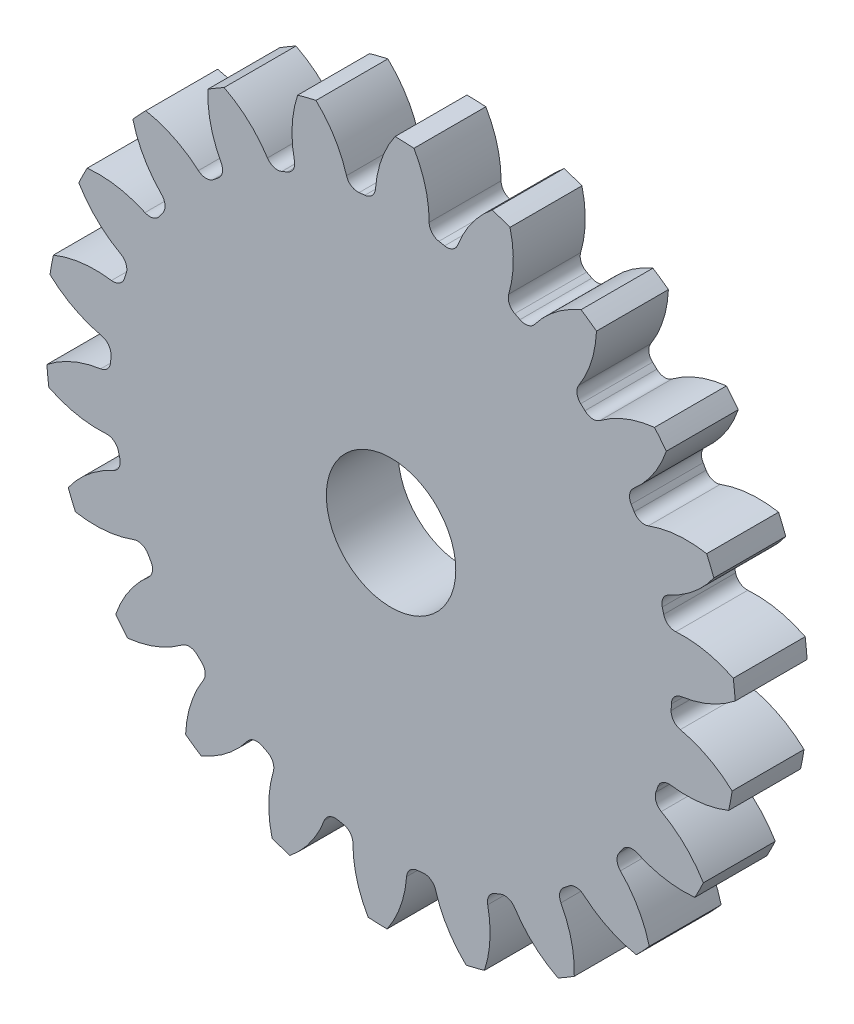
ISO-10303-21;
HEADER;
FILE_DESCRIPTION(('STEP AP214'),'2;1');
FILE_NAME('part.step','',(''),(''),'','','');
FILE_SCHEMA(('AUTOMOTIVE_DESIGN { 1 0 10303 214 1 1 1 1 }'));
ENDSEC;
DATA;
#1=APPLICATION_CONTEXT('core data for automotive mechanical design processes');
#2=APPLICATION_PROTOCOL_DEFINITION('international standard','automotive_design',2000,#1);
#3=PRODUCT_CONTEXT('',#1,'mechanical');
#4=PRODUCT('Part','Part','',(#3));
#5=PRODUCT_RELATED_PRODUCT_CATEGORY('part','',(#4));
#6=PRODUCT_DEFINITION_FORMATION('','',#4);
#7=PRODUCT_DEFINITION_CONTEXT('part definition',#1,'design');
#8=PRODUCT_DEFINITION('design','',#6,#7);
#9=PRODUCT_DEFINITION_SHAPE('','',#8);
#10=(LENGTH_UNIT() NAMED_UNIT(*) SI_UNIT(.MILLI.,.METRE.));
#11=(NAMED_UNIT(*) PLANE_ANGLE_UNIT() SI_UNIT($,.RADIAN.));
#12=(NAMED_UNIT(*) SI_UNIT($,.STERADIAN.) SOLID_ANGLE_UNIT());
#13=UNCERTAINTY_MEASURE_WITH_UNIT(LENGTH_MEASURE(1.E-05),#10,'distance_accuracy_value','');
#14=(GEOMETRIC_REPRESENTATION_CONTEXT(3) GLOBAL_UNCERTAINTY_ASSIGNED_CONTEXT((#13)) GLOBAL_UNIT_ASSIGNED_CONTEXT((#10,
#11,#12)) REPRESENTATION_CONTEXT('',''));
#15=CARTESIAN_POINT('',(0.,0.,0.));
#16=DIRECTION('',(0.,0.,1.));
#17=DIRECTION('',(1.,0.,0.));
#18=AXIS2_PLACEMENT_3D('',#15,#16,#17);
#19=CARTESIAN_POINT('',(0.,0.,127.));
#20=DIRECTION('',(0.,0.,-1.));
#21=DIRECTION('',(-1.,0.,0.));
#22=AXIS2_PLACEMENT_3D('',#19,#20,#21);
#23=CYLINDRICAL_SURFACE('',#22,609.6);
#24=DIRECTION('',(0.,0.,-1.));
#25=VECTOR('',#24,1.);
#26=CARTESIAN_POINT('',(604.364405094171,79.7234335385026,63.5));
#27=LINE('',#26,#25);
#28=CARTESIAN_POINT('',(604.364405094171,79.7234335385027,127.));
#29=VERTEX_POINT('',#28);
#30=CARTESIAN_POINT('',(604.364405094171,79.7234335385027,0.));
#31=VERTEX_POINT('',#30);
#32=EDGE_CURVE('E888',#29,#31,#27,.T.);
#33=ORIENTED_EDGE('',*,*,#32,.F.);
#34=CARTESIAN_POINT('',(0.,0.,127.));
#35=DIRECTION('',(0.,0.,1.));
#36=DIRECTION('',(1.,0.,0.));
#37=AXIS2_PLACEMENT_3D('',#34,#35,#36);
#38=CIRCLE('',#37,609.6);
#39=CARTESIAN_POINT('',(607.818716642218,46.5678827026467,127.));
#40=VERTEX_POINT('',#39);
#41=EDGE_CURVE('E1685',#40,#29,#38,.T.);
#42=ORIENTED_EDGE('',*,*,#41,.F.);
#43=DIRECTION('',(0.,0.,-1.));
#44=VECTOR('',#43,1.);
#45=CARTESIAN_POINT('',(607.818716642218,46.5678827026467,63.5));
#46=LINE('',#45,#44);
#47=CARTESIAN_POINT('',(607.818716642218,46.5678827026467,0.));
#48=VERTEX_POINT('',#47);
#49=EDGE_CURVE('E1679',#48,#40,#46,.F.);
#50=ORIENTED_EDGE('',*,*,#49,.F.);
#51=CARTESIAN_POINT('',(0.,0.,0.));
#52=DIRECTION('',(0.,0.,1.));
#53=DIRECTION('',(1.,0.,0.));
#54=AXIS2_PLACEMENT_3D('',#51,#52,#53);
#55=CIRCLE('',#54,609.6);
#56=EDGE_CURVE('E1690',#48,#31,#55,.T.);
#57=ORIENTED_EDGE('',*,*,#56,.T.);
#58=EDGE_LOOP('',(#33,#42,#50,#57));
#59=FACE_BOUND('',#58,.T.);
#60=ADVANCED_FACE('F33',(#59),#23,.T.);
#61=DIRECTION('',(0.,0.,-1.));
#62=VECTOR('',#61,1.);
#63=CARTESIAN_POINT('',(570.078099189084,215.923877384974,63.5));
#64=LINE('',#63,#62);
#65=CARTESIAN_POINT('',(570.078099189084,215.923877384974,0.));
#66=VERTEX_POINT('',#65);
#67=CARTESIAN_POINT('',(570.078099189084,215.923877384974,127.));
#68=VERTEX_POINT('',#67);
#69=EDGE_CURVE('E859',#66,#68,#64,.F.);
#70=ORIENTED_EDGE('',*,*,#69,.F.);
#71=CARTESIAN_POINT('',(557.422713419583,246.763203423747,0.));
#72=VERTEX_POINT('',#71);
#73=EDGE_CURVE('E1693',#66,#72,#55,.T.);
#74=ORIENTED_EDGE('',*,*,#73,.T.);
#75=DIRECTION('',(0.,0.,-1.));
#76=VECTOR('',#75,1.);
#77=CARTESIAN_POINT('',(557.422713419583,246.763203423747,63.5));
#78=LINE('',#77,#76);
#79=CARTESIAN_POINT('',(557.422713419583,246.763203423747,127.));
#80=VERTEX_POINT('',#79);
#81=EDGE_CURVE('E921',#80,#72,#78,.T.);
#82=ORIENTED_EDGE('',*,*,#81,.F.);
#83=EDGE_CURVE('E1688',#68,#80,#38,.T.);
#84=ORIENTED_EDGE('',*,*,#83,.F.);
#85=EDGE_LOOP('',(#70,#74,#82,#84));
#86=FACE_BOUND('',#85,.T.);
#87=ADVANCED_FACE('F1941',(#86),#23,.T.);
#88=CARTESIAN_POINT('',(0.,0.,127.));
#89=DIRECTION('',(0.,0.,1.));
#90=DIRECTION('',(1.,0.,0.));
#91=AXIS2_PLACEMENT_3D('',#88,#89,#90);
#92=PLANE('',#91);
#93=CARTESIAN_POINT('',(0.,0.,127.000000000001));
#94=DIRECTION('',(0.,0.,1.));
#95=DIRECTION('',(1.,0.,0.));
#96=AXIS2_PLACEMENT_3D('',#93,#94,#95);
#97=CIRCLE('',#96,114.3);
#98=CARTESIAN_POINT('',(114.3,0.,127.000000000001));
#99=VERTEX_POINT('',#98);
#100=EDGE_CURVE('E876',#99,#99,#97,.T.);
#101=ORIENTED_EDGE('',*,*,#100,.F.);
#102=EDGE_LOOP('',(#101));
#103=FACE_BOUND('',#102,.T.);
#104=ORIENTED_EDGE('',*,*,#41,.T.);
#105=CARTESIAN_POINT('',(516.132512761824,-96.6306764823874,127.));
#106=DIRECTION('',(0.,0.,-1.));
#107=DIRECTION('',(0.959492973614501,0.281732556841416,0.));
#108=AXIS2_PLACEMENT_3D('',#105,#106,#107);
#109=CIRCLE('',#108,197.194419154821);
#110=CARTESIAN_POINT('',(503.020584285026,100.12733803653,127.));
#111=VERTEX_POINT('',#110);
#112=EDGE_CURVE('E868',#111,#29,#109,.T.);
#113=ORIENTED_EDGE('',*,*,#112,.F.);
#114=CARTESIAN_POINT('',(501.645814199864,120.757181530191,127.));
#115=DIRECTION('',(0.,0.,1.));
#116=DIRECTION('',(-0.959492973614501,-0.281732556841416,0.));
#117=AXIS2_PLACEMENT_3D('',#114,#115,#116);
#118=CIRCLE('',#117,20.6756000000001);
#119=CARTESIAN_POINT('',(481.544421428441,115.918334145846,127.));
#120=VERTEX_POINT('',#119);
#121=EDGE_CURVE('E866',#120,#111,#118,.T.);
#122=ORIENTED_EDGE('',*,*,#121,.F.);
#123=CARTESIAN_POINT('',(0.,0.,127.));
#124=DIRECTION('',(0.,0.,-1.));
#125=DIRECTION('',(0.959492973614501,0.281732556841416,0.));
#126=AXIS2_PLACEMENT_3D('',#123,#124,#125);
#127=CIRCLE('',#126,495.3);
#128=CARTESIAN_POINT('',(479.033707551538,125.892005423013,127.));
#129=VERTEX_POINT('',#128);
#130=EDGE_CURVE('E851',#129,#120,#127,.T.);
#131=ORIENTED_EDGE('',*,*,#130,.F.);
#132=CARTESIAN_POINT('',(499.03029411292,131.147189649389,127.));
#133=DIRECTION('',(0.,0.,1.));
#134=DIRECTION('',(-0.959492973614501,-0.281732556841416,0.));
#135=AXIS2_PLACEMENT_3D('',#132,#133,#134);
#136=CIRCLE('',#135,20.6756000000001);
#137=CARTESIAN_POINT('',(490.473703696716,149.969123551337,127.));
#138=VERTEX_POINT('',#137);
#139=EDGE_CURVE('E843',#138,#129,#136,.T.);
#140=ORIENTED_EDGE('',*,*,#139,.F.);
#141=CARTESIAN_POINT('',(408.864856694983,329.4841230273,127.));
#142=DIRECTION('',(0.,0.,-1.));
#143=DIRECTION('',(-0.959492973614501,-0.281732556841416,0.));
#144=AXIS2_PLACEMENT_3D('',#141,#142,#143);
#145=CIRCLE('',#144,197.194419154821);
#146=EDGE_CURVE('E873',#68,#138,#145,.T.);
#147=ORIENTED_EDGE('',*,*,#146,.F.);
#148=ORIENTED_EDGE('',*,*,#83,.T.);
#149=CARTESIAN_POINT('',(522.449527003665,52.6948773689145,127.));
#150=DIRECTION('',(0.,0.,-1.));
#151=DIRECTION('',(0.841253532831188,0.540640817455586,0.));
#152=AXIS2_PLACEMENT_3D('',#149,#150,#151);
#153=CIRCLE('',#152,197.194419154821);
#154=CARTESIAN_POINT('',(454.435585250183,237.788752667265,127.));
#155=VERTEX_POINT('',#154);
#156=EDGE_CURVE('E897',#155,#80,#153,.T.);
#157=ORIENTED_EDGE('',*,*,#156,.F.);
#158=CARTESIAN_POINT('',(447.304404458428,257.195625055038,127.));
#159=DIRECTION('',(0.,0.,1.));
#160=DIRECTION('',(-0.841253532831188,-0.540640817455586,0.));
#161=AXIS2_PLACEMENT_3D('',#158,#159,#160);
#162=CIRCLE('',#161,20.6756000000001);
#163=CARTESIAN_POINT('',(429.380520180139,246.889568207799,127.));
#164=VERTEX_POINT('',#163);
#165=EDGE_CURVE('E895',#164,#155,#162,.T.);
#166=ORIENTED_EDGE('',*,*,#165,.F.);
#167=CARTESIAN_POINT('',(0.,0.,127.));
#168=DIRECTION('',(0.,0.,-1.));
#169=DIRECTION('',(0.841253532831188,0.540640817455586,0.));
#170=AXIS2_PLACEMENT_3D('',#167,#168,#169);
#171=CIRCLE('',#170,495.3);
#172=CARTESIAN_POINT('',(424.161599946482,255.751885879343,127.));
#173=VERTEX_POINT('',#172);
#174=EDGE_CURVE('E892',#173,#164,#171,.T.);
#175=ORIENTED_EDGE('',*,*,#174,.F.);
#176=CARTESIAN_POINT('',(441.867627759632,266.42788767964,127.));
#177=DIRECTION('',(0.,0.,1.));
#178=DIRECTION('',(-0.841253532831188,-0.540640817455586,0.));
#179=AXIS2_PLACEMENT_3D('',#176,#177,#178);
#180=CIRCLE('',#179,20.6756000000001);
#181=CARTESIAN_POINT('',(428.354887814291,282.076730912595,127.));
#182=VERTEX_POINT('',#181);
#183=EDGE_CURVE('E890',#182,#173,#180,.T.);
#184=ORIENTED_EDGE('',*,*,#183,.F.);
#185=CARTESIAN_POINT('',(299.476552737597,431.328242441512,127.));
#186=DIRECTION('',(0.,0.,-1.));
#187=DIRECTION('',(-0.841253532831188,-0.540640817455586,0.));
#188=AXIS2_PLACEMENT_3D('',#185,#186,#187);
#189=CIRCLE('',#188,197.194419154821);
#190=CARTESIAN_POINT('',(486.15314452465,367.787003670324,127.));
#191=VERTEX_POINT('',#190);
#192=EDGE_CURVE('E900',#191,#182,#189,.T.);
#193=ORIENTED_EDGE('',*,*,#192,.F.);
#194=CARTESIAN_POINT('',(465.321948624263,393.811686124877,127.));
#195=VERTEX_POINT('',#194);
#196=EDGE_CURVE('E1745',#191,#195,#38,.T.);
#197=ORIENTED_EDGE('',*,*,#196,.T.);
#198=CARTESIAN_POINT('',(486.440787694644,197.751405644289,127.));
#199=DIRECTION('',(0.,0.,-1.));
#200=DIRECTION('',(0.654860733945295,0.75574957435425,0.));
#201=AXIS2_PLACEMENT_3D('',#198,#199,#200);
#202=CIRCLE('',#201,197.194419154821);
#203=CARTESIAN_POINT('',(369.03491773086,356.185936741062,127.));
#204=VERTEX_POINT('',#203);
#205=EDGE_CURVE('E932',#204,#195,#202,.T.);
#206=ORIENTED_EDGE('',*,*,#205,.F.);
#207=CARTESIAN_POINT('',(356.725052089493,372.797608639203,127.));
#208=DIRECTION('',(0.,0.,1.));
#209=DIRECTION('',(-0.654860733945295,-0.75574957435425,0.));
#210=AXIS2_PLACEMENT_3D('',#207,#208,#209);
#211=CIRCLE('',#210,20.6756000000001);
#212=CARTESIAN_POINT('',(342.430762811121,357.859277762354,127.));
#213=VERTEX_POINT('',#212);
#214=EDGE_CURVE('E930',#213,#204,#211,.T.);
#215=ORIENTED_EDGE('',*,*,#214,.F.);
#216=CARTESIAN_POINT('',(0.,0.,127.));
#217=DIRECTION('',(0.,0.,-1.));
#218=DIRECTION('',(0.654860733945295,0.75574957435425,0.));
#219=AXIS2_PLACEMENT_3D('',#216,#217,#218);
#220=CIRCLE('',#219,495.3);
#221=CARTESIAN_POINT('',(334.926442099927,364.892269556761,127.));
#222=VERTEX_POINT('',#221);
#223=EDGE_CURVE('E927',#222,#213,#220,.T.);
#224=ORIENTED_EDGE('',*,*,#223,.F.);
#225=CARTESIAN_POINT('',(348.907474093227,380.124182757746,127.));
#226=DIRECTION('',(0.,0.,1.));
#227=DIRECTION('',(-0.654860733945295,-0.75574957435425,0.));
#228=AXIS2_PLACEMENT_3D('',#225,#226,#227);
#229=CIRCLE('',#228,20.6756000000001);
#230=CARTESIAN_POINT('',(331.533306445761,391.332159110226,127.));
#231=VERTEX_POINT('',#230);
#232=EDGE_CURVE('E925',#231,#222,#229,.T.);
#233=ORIENTED_EDGE('',*,*,#232,.F.);
#234=CARTESIAN_POINT('',(165.826439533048,498.228712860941,127.));
#235=DIRECTION('',(0.,0.,-1.));
#236=DIRECTION('',(-0.654860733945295,-0.75574957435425,0.));
#237=AXIS2_PLACEMENT_3D('',#234,#235,#236);
#238=CIRCLE('',#237,197.194419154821);
#239=CARTESIAN_POINT('',(362.842953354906,489.854214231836,127.));
#240=VERTEX_POINT('',#239);
#241=EDGE_CURVE('E935',#240,#231,#238,.T.);
#242=ORIENTED_EDGE('',*,*,#241,.F.);
#243=CARTESIAN_POINT('',(335.52356692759,508.955888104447,127.));
#244=VERTEX_POINT('',#243);
#245=EDGE_CURVE('E1923',#240,#244,#38,.T.);
#246=ORIENTED_EDGE('',*,*,#245,.T.);
#247=CARTESIAN_POINT('',(411.02350874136,326.787291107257,127.));
#248=DIRECTION('',(0.,0.,-1.));
#249=DIRECTION('',(0.415415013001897,0.909631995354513,0.));
#250=AXIS2_PLACEMENT_3D('',#247,#248,#249);
#251=CIRCLE('',#250,197.194419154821);
#252=CARTESIAN_POINT('',(253.737235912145,445.727054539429,127.));
#253=VERTEX_POINT('',#252);
#254=EDGE_CURVE('E970',#253,#244,#251,.T.);
#255=ORIENTED_EDGE('',*,*,#254,.F.);
#256=CARTESIAN_POINT('',(237.24595752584,458.197747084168,127.));
#257=DIRECTION('',(0.,0.,1.));
#258=DIRECTION('',(-0.415415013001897,-0.909631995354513,0.));
#259=AXIS2_PLACEMENT_3D('',#256,#257,#258);
#260=CIRCLE('',#259,20.6756000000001);
#261=CARTESIAN_POINT('',(227.739301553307,439.837356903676,127.));
#262=VERTEX_POINT('',#261);
#263=EDGE_CURVE('E968',#262,#253,#260,.T.);
#264=ORIENTED_EDGE('',*,*,#263,.F.);
#265=CARTESIAN_POINT('',(0.,0.,127.));
#266=DIRECTION('',(0.,0.,-1.));
#267=DIRECTION('',(0.415415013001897,0.909631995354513,0.));
#268=AXIS2_PLACEMENT_3D('',#265,#266,#267);
#269=CIRCLE('',#268,495.3);
#270=CARTESIAN_POINT('',(218.557535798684,444.471251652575,127.));
#271=VERTEX_POINT('',#270);
#272=EDGE_CURVE('E965',#271,#262,#269,.T.);
#273=ORIENTED_EDGE('',*,*,#272,.F.);
#274=CARTESIAN_POINT('',(227.680911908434,463.02507723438,127.));
#275=DIRECTION('',(0.,0.,1.));
#276=DIRECTION('',(-0.415415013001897,-0.909631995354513,0.));
#277=AXIS2_PLACEMENT_3D('',#274,#275,#276);
#278=CIRCLE('',#277,20.6756000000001);
#279=CARTESIAN_POINT('',(207.852868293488,468.88418311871,127.));
#280=VERTEX_POINT('',#279);
#281=EDGE_CURVE('E963',#280,#271,#278,.T.);
#282=ORIENTED_EDGE('',*,*,#281,.F.);
#283=CARTESIAN_POINT('',(18.7420544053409,524.765656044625,127.));
#284=DIRECTION('',(0.,0.,-1.));
#285=DIRECTION('',(-0.415415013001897,-0.909631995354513,0.));
#286=AXIS2_PLACEMENT_3D('',#283,#284,#285);
#287=CIRCLE('',#286,197.194419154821);
#288=CARTESIAN_POINT('',(210.13738401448,572.236349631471,127.));
#289=VERTEX_POINT('',#288);
#290=EDGE_CURVE('E973',#289,#280,#287,.T.);
#291=ORIENTED_EDGE('',*,*,#290,.F.);
#292=CARTESIAN_POINT('',(178.543061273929,582.86751090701,127.));
#293=VERTEX_POINT('',#292);
#294=EDGE_CURVE('E1919',#289,#293,#38,.T.);
#295=ORIENTED_EDGE('',*,*,#294,.T.);
#296=CARTESIAN_POINT('',(302.307549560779,429.348813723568,127.));
#297=DIRECTION('',(0.,0.,-1.));
#298=DIRECTION('',(0.142314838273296,0.989821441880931,0.));
#299=AXIS2_PLACEMENT_3D('',#296,#297,#298);
#300=CIRCLE('',#299,197.194419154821);
#301=CARTESIAN_POINT('',(117.883272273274,499.158017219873,127.));
#302=VERTEX_POINT('',#301);
#303=EDGE_CURVE('E1008',#302,#293,#300,.T.);
#304=ORIENTED_EDGE('',*,*,#303,.F.);
#305=CARTESIAN_POINT('',(98.5466064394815,506.4774290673,127.));
#306=DIRECTION('',(0.,0.,1.));
#307=DIRECTION('',(-0.142314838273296,-0.989821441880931,0.));
#308=AXIS2_PLACEMENT_3D('',#305,#306,#307);
#309=CIRCLE('',#308,20.6756000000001);
#310=CARTESIAN_POINT('',(94.5977565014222,486.182429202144,127.));
#311=VERTEX_POINT('',#310);
#312=EDGE_CURVE('E1006',#311,#302,#309,.T.);
#313=ORIENTED_EDGE('',*,*,#312,.F.);
#314=CARTESIAN_POINT('',(0.,0.,127.));
#315=DIRECTION('',(0.,0.,-1.));
#316=DIRECTION('',(0.142314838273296,0.989821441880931,0.));
#317=AXIS2_PLACEMENT_3D('',#314,#315,#316);
#318=CIRCLE('',#317,495.3);
#319=CARTESIAN_POINT('',(84.4823977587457,488.041816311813,127.));
#320=VERTEX_POINT('',#319);
#321=EDGE_CURVE('E1003',#320,#311,#318,.T.);
#322=ORIENTED_EDGE('',*,*,#321,.F.);
#323=CARTESIAN_POINT('',(88.0089963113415,508.414433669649,127.));
#324=DIRECTION('',(0.,0.,1.));
#325=DIRECTION('',(-0.142314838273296,-0.989821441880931,0.));
#326=AXIS2_PLACEMENT_3D('',#323,#324,#325);
#327=CIRCLE('',#326,20.6756000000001);
#328=CARTESIAN_POINT('',(67.3334269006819,508.449999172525,127.));
#329=VERTEX_POINT('',#328);
#330=EDGE_CURVE('E1001',#329,#320,#327,.T.);
#331=ORIENTED_EDGE('',*,*,#330,.F.);
#332=CARTESIAN_POINT('',(-129.860700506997,508.789206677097,127.));
#333=DIRECTION('',(0.,0.,-1.));
#334=DIRECTION('',(-0.142314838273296,-0.989821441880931,0.));
#335=AXIS2_PLACEMENT_3D('',#332,#333,#334);
#336=CIRCLE('',#335,197.194419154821);
#337=CARTESIAN_POINT('',(40.4077335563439,608.259299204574,127.));
#338=VERTEX_POINT('',#337);
#339=EDGE_CURVE('E1011',#338,#329,#336,.T.);
#340=ORIENTED_EDGE('',*,*,#339,.F.);
#341=CARTESIAN_POINT('',(7.09805863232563,609.558674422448,127.));
#342=VERTEX_POINT('',#341);
#343=EDGE_CURVE('E1915',#338,#342,#38,.T.);
#344=ORIENTED_EDGE('',*,*,#343,.T.);
#345=CARTESIAN_POINT('',(169.100430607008,497.127048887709,127.));
#346=DIRECTION('',(0.,0.,-1.));
#347=DIRECTION('',(-0.142314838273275,0.989821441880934,0.));
#348=AXIS2_PLACEMENT_3D('',#345,#346,#347);
#349=CIRCLE('',#348,197.194419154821);
#350=CARTESIAN_POINT('',(-27.5208930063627,512.150165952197,127.));
#351=VERTEX_POINT('',#350);
#352=EDGE_CURVE('E1046',#351,#342,#349,.T.);
#353=ORIENTED_EDGE('',*,*,#352,.F.);
#354=CARTESIAN_POINT('',(-48.136404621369,513.725321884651,127.));
#355=DIRECTION('',(0.,0.,1.));
#356=DIRECTION('',(0.142314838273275,-0.989821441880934,0.));
#357=AXIS2_PLACEMENT_3D('',#354,#355,#356);
#358=CIRCLE('',#357,20.6756000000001);
#359=CARTESIAN_POINT('',(-46.2075361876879,493.139892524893,127.));
#360=VERTEX_POINT('',#359);
#361=EDGE_CURVE('E1044',#360,#351,#358,.T.);
#362=ORIENTED_EDGE('',*,*,#361,.F.);
#363=CARTESIAN_POINT('',(0.,0.,127.));
#364=DIRECTION('',(0.,0.,-1.));
#365=DIRECTION('',(-0.142314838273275,0.989821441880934,0.));
#366=AXIS2_PLACEMENT_3D('',#363,#364,#365);
#367=CIRCLE('',#366,495.3);
#368=CARTESIAN_POINT('',(-56.437001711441,492.074135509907,127.));
#369=VERTEX_POINT('',#368);
#370=EDGE_CURVE('E1041',#369,#360,#367,.T.);
#371=ORIENTED_EDGE('',*,*,#370,.F.);
#372=CARTESIAN_POINT('',(-58.7928847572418,512.615076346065,127.));
#373=DIRECTION('',(0.,0.,1.));
#374=DIRECTION('',(0.142314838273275,-0.989821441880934,0.));
#375=AXIS2_PLACEMENT_3D('',#372,#373,#374);
#376=CIRCLE('',#375,20.6756000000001);
#377=CARTESIAN_POINT('',(-78.6409682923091,506.82422016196,127.));
#378=VERTEX_POINT('',#377);
#379=EDGE_CURVE('E1039',#378,#369,#376,.T.);
#380=ORIENTED_EDGE('',*,*,#379,.F.);
#381=CARTESIAN_POINT('',(-267.942913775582,451.593681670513,127.));
#382=DIRECTION('',(0.,0.,-1.));
#383=DIRECTION('',(0.142314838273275,-0.989821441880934,0.));
#384=AXIS2_PLACEMENT_3D('',#381,#382,#383);
#385=CIRCLE('',#384,197.194419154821);
#386=CARTESIAN_POINT('',(-132.595511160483,595.004697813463,127.));
#387=VERTEX_POINT('',#386);
#388=EDGE_CURVE('E1049',#387,#378,#385,.T.);
#389=ORIENTED_EDGE('',*,*,#388,.F.);
#390=CARTESIAN_POINT('',(-164.921986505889,586.867019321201,127.));
#391=VERTEX_POINT('',#390);
#392=EDGE_CURVE('E1911',#387,#391,#38,.T.);
#393=ORIENTED_EDGE('',*,*,#392,.T.);
#394=CARTESIAN_POINT('',(22.1938004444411,524.631007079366,127.));
#395=DIRECTION('',(0.,0.,-1.));
#396=DIRECTION('',(-0.415415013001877,0.909631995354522,0.));
#397=AXIS2_PLACEMENT_3D('',#394,#395,#396);
#398=CIRCLE('',#397,197.194419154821);
#399=CARTESIAN_POINT('',(-170.695479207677,483.65095411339,127.));
#400=VERTEX_POINT('',#399);
#401=EDGE_CURVE('E1084',#400,#391,#398,.T.);
#402=ORIENTED_EDGE('',*,*,#401,.F.);
#403=CARTESIAN_POINT('',(-190.919690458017,479.354244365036,127.));
#404=DIRECTION('',(0.,0.,1.));
#405=DIRECTION('',(0.415415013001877,-0.909631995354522,0.));
#406=AXIS2_PLACEMENT_3D('',#403,#404,#405);
#407=CIRCLE('',#406,20.6756000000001);
#408=CARTESIAN_POINT('',(-183.269369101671,460.146094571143,127.));
#409=VERTEX_POINT('',#408);
#410=EDGE_CURVE('E1082',#409,#400,#407,.T.);
#411=ORIENTED_EDGE('',*,*,#410,.F.);
#412=CARTESIAN_POINT('',(0.,0.,127.));
#413=DIRECTION('',(0.,0.,-1.));
#414=DIRECTION('',(-0.415415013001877,0.909631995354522,0.));
#415=AXIS2_PLACEMENT_3D('',#412,#413,#414);
#416=CIRCLE('',#415,495.3);
#417=CARTESIAN_POINT('',(-192.78421094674,456.241534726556,127.));
#418=VERTEX_POINT('',#417);
#419=EDGE_CURVE('E1079',#418,#409,#416,.T.);
#420=ORIENTED_EDGE('',*,*,#419,.F.);
#421=CARTESIAN_POINT('',(-200.831715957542,475.286694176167,127.));
#422=DIRECTION('',(0.,0.,1.));
#423=DIRECTION('',(0.415415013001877,-0.909631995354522,0.));
#424=AXIS2_PLACEMENT_3D('',#421,#422,#423);
#425=CIRCLE('',#424,20.6756000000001);
#426=CARTESIAN_POINT('',(-218.244339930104,464.138557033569,127.));
#427=VERTEX_POINT('',#426);
#428=EDGE_CURVE('E1077',#427,#418,#425,.T.);
#429=ORIENTED_EDGE('',*,*,#428,.F.);
#430=CARTESIAN_POINT('',(-384.317985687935,357.812722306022,127.));
#431=DIRECTION('',(0.,0.,-1.));
#432=DIRECTION('',(0.415415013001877,-0.909631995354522,0.));
#433=AXIS2_PLACEMENT_3D('',#430,#431,#432);
#434=CIRCLE('',#433,197.194419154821);
#435=CARTESIAN_POINT('',(-294.856656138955,533.546354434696,127.));
#436=VERTEX_POINT('',#435);
#437=EDGE_CURVE('E1087',#436,#427,#434,.T.);
#438=ORIENTED_EDGE('',*,*,#437,.F.);
#439=CARTESIAN_POINT('',(-323.581033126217,516.630888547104,127.));
#440=VERTEX_POINT('',#439);
#441=EDGE_CURVE('E1907',#436,#440,#38,.T.);
#442=ORIENTED_EDGE('',*,*,#441,.T.);
#443=CARTESIAN_POINT('',(-126.510839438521,509.63248117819,127.));
#444=DIRECTION('',(0.,0.,-1.));
#445=DIRECTION('',(-0.654860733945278,0.755749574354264,0.));
#446=AXIS2_PLACEMENT_3D('',#443,#444,#445);
#447=CIRCLE('',#446,197.194419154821);
#448=CARTESIAN_POINT('',(-300.041332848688,415.969218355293,127.));
#449=VERTEX_POINT('',#448);
#450=EDGE_CURVE('E1122',#449,#440,#447,.T.);
#451=ORIENTED_EDGE('',*,*,#450,.F.);
#452=CARTESIAN_POINT('',(-318.235798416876,406.148736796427,127.));
#453=DIRECTION('',(0.,0.,1.));
#454=DIRECTION('',(0.654860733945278,-0.755749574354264,0.));
#455=AXIS2_PLACEMENT_3D('',#452,#453,#454);
#456=CIRCLE('',#455,20.6756000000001);
#457=CARTESIAN_POINT('',(-305.483807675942,389.873996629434,127.));
#458=VERTEX_POINT('',#457);
#459=EDGE_CURVE('E1120',#458,#449,#456,.T.);
#460=ORIENTED_EDGE('',*,*,#459,.F.);
#461=CARTESIAN_POINT('',(0.,0.,127.));
#462=DIRECTION('',(0.,0.,-1.));
#463=DIRECTION('',(-0.654860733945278,0.755749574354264,0.));
#464=AXIS2_PLACEMENT_3D('',#461,#462,#463);
#465=CIRCLE('',#464,495.3);
#466=CARTESIAN_POINT('',(-313.513189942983,383.446958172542,127.));
#467=VERTEX_POINT('',#466);
#468=EDGE_CURVE('E1117',#467,#458,#465,.T.);
#469=ORIENTED_EDGE('',*,*,#468,.F.);
#470=CARTESIAN_POINT('',(-326.600355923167,399.453410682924,127.));
#471=DIRECTION('',(0.,0.,1.));
#472=DIRECTION('',(0.654860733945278,-0.755749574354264,0.));
#473=AXIS2_PLACEMENT_3D('',#470,#471,#472);
#474=CIRCLE('',#473,20.6756000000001);
#475=CARTESIAN_POINT('',(-340.166853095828,383.851148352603,127.));
#476=VERTEX_POINT('',#475);
#477=EDGE_CURVE('E1115',#476,#467,#474,.T.);
#478=ORIENTED_EDGE('',*,*,#477,.F.);
#479=CARTESIAN_POINT('',(-469.557900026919,235.043904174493,127.));
#480=DIRECTION('',(0.,0.,-1.));
#481=DIRECTION('',(0.654860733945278,-0.755749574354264,0.));
#482=AXIS2_PLACEMENT_3D('',#479,#480,#481);
#483=CIRCLE('',#482,197.194419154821);
#484=CARTESIAN_POINT('',(-433.230268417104,428.863258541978,127.));
#485=VERTEX_POINT('',#484);
#486=EDGE_CURVE('E1125',#485,#476,#483,.T.);
#487=ORIENTED_EDGE('',*,*,#486,.F.);
#488=CARTESIAN_POINT('',(-456.02546885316,404.54039570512,127.));
#489=VERTEX_POINT('',#488);
#490=EDGE_CURVE('E1903',#485,#489,#38,.T.);
#491=ORIENTED_EDGE('',*,*,#490,.T.);
#492=CARTESIAN_POINT('',(-264.966323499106,453.346562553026,127.));
#493=DIRECTION('',(0.,0.,-1.));
#494=DIRECTION('',(-0.841253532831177,0.540640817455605,0.));
#495=AXIS2_PLACEMENT_3D('',#492,#493,#494);
#496=CIRCLE('',#495,197.194419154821);
#497=CARTESIAN_POINT('',(-405.079622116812,314.588130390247,127.));
#498=VERTEX_POINT('',#497);
#499=EDGE_CURVE('E1160',#498,#489,#496,.T.);
#500=ORIENTED_EDGE('',*,*,#499,.F.);
#501=CARTESIAN_POINT('',(-419.770334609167,300.039474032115,127.));
#502=DIRECTION('',(0.,0.,1.));
#503=DIRECTION('',(0.841253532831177,-0.540640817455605,0.));
#504=AXIS2_PLACEMENT_3D('',#501,#502,#503);
#505=CIRCLE('',#504,20.6756000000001);
#506=CARTESIAN_POINT('',(-402.949764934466,288.016626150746,127.));
#507=VERTEX_POINT('',#506);
#508=EDGE_CURVE('E1158',#507,#498,#505,.T.);
#509=ORIENTED_EDGE('',*,*,#508,.F.);
#510=CARTESIAN_POINT('',(0.,0.,127.));
#511=DIRECTION('',(0.,0.,-1.));
#512=DIRECTION('',(-0.841253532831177,0.540640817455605,0.));
#513=AXIS2_PLACEMENT_3D('',#510,#511,#512);
#514=CIRCLE('',#513,495.3);
#515=CARTESIAN_POINT('',(-408.843194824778,279.587789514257,127.));
#516=VERTEX_POINT('',#515);
#517=EDGE_CURVE('E1155',#516,#507,#514,.T.);
#518=ORIENTED_EDGE('',*,*,#517,.F.);
#519=CARTESIAN_POINT('',(-425.909777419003,291.258787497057,127.));
#520=DIRECTION('',(0.,0.,1.));
#521=DIRECTION('',(0.841253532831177,-0.540640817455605,0.));
#522=AXIS2_PLACEMENT_3D('',#519,#520,#521);
#523=CIRCLE('',#522,20.6756000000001);
#524=CARTESIAN_POINT('',(-434.5310708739,272.466402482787,127.));
#525=VERTEX_POINT('',#524);
#526=EDGE_CURVE('E1153',#525,#516,#523,.T.);
#527=ORIENTED_EDGE('',*,*,#526,.F.);
#528=CARTESIAN_POINT('',(-516.757025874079,93.2332267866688,127.));
#529=DIRECTION('',(0.,0.,-1.));
#530=DIRECTION('',(0.841253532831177,-0.540640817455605,0.));
#531=AXIS2_PLACEMENT_3D('',#528,#529,#530);
#532=CIRCLE('',#531,197.194419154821);
#533=CARTESIAN_POINT('',(-536.506140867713,289.436211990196,127.));
#534=VERTEX_POINT('',#533);
#535=EDGE_CURVE('E1163',#534,#525,#532,.T.);
#536=ORIENTED_EDGE('',*,*,#535,.F.);
#537=CARTESIAN_POINT('',(-551.525433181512,259.676445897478,127.));
#538=VERTEX_POINT('',#537);
#539=EDGE_CURVE('E1899',#534,#538,#38,.T.);
#540=ORIENTED_EDGE('',*,*,#539,.T.);
#541=CARTESIAN_POINT('',(-381.955811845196,360.333201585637,127.));
#542=DIRECTION('',(0.,0.,-1.));
#543=DIRECTION('',(-0.959492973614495,0.281732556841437,0.));
#544=AXIS2_PLACEMENT_3D('',#541,#542,#543);
#545=CIRCLE('',#544,197.194419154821);
#546=CARTESIAN_POINT('',(-477.300769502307,187.720983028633,127.));
#547=VERTEX_POINT('',#546);
#548=EDGE_CURVE('E1198',#547,#538,#545,.T.);
#549=ORIENTED_EDGE('',*,*,#548,.F.);
#550=CARTESIAN_POINT('',(-487.297574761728,169.622797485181,127.));
#551=DIRECTION('',(0.,0.,1.));
#552=DIRECTION('',(0.959492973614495,-0.281732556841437,0.));
#553=AXIS2_PLACEMENT_3D('',#550,#551,#552);
#554=CIRCLE('',#553,20.6756000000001);
#555=CARTESIAN_POINT('',(-467.771128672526,162.825861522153,127.));
#556=VERTEX_POINT('',#555);
#557=EDGE_CURVE('E1196',#556,#547,#554,.T.);
#558=ORIENTED_EDGE('',*,*,#557,.F.);
#559=CARTESIAN_POINT('',(0.,0.,127.));
#560=DIRECTION('',(0.,0.,-1.));
#561=DIRECTION('',(-0.959492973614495,0.281732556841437,0.));
#562=AXIS2_PLACEMENT_3D('',#559,#560,#561);
#563=CIRCLE('',#562,495.3);
#564=CARTESIAN_POINT('',(-471.051155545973,153.078080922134,127.));
#565=VERTEX_POINT('',#564);
#566=EDGE_CURVE('E1193',#565,#556,#563,.T.);
#567=ORIENTED_EDGE('',*,*,#566,.F.);
#568=CARTESIAN_POINT('',(-490.714521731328,159.468109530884,127.));
#569=DIRECTION('',(0.,0.,1.));
#570=DIRECTION('',(0.959492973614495,-0.281732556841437,0.));
#571=AXIS2_PLACEMENT_3D('',#568,#569,#570);
#572=CIRCLE('',#571,20.6756000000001);
#573=CARTESIAN_POINT('',(-493.692165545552,139.008049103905,127.));
#574=VERTEX_POINT('',#573);
#575=EDGE_CURVE('E1191',#574,#565,#572,.T.);
#576=ORIENTED_EDGE('',*,*,#575,.F.);
#577=CARTESIAN_POINT('',(-522.091570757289,-56.1306521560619,127.));
#578=DIRECTION('',(0.,0.,-1.));
#579=DIRECTION('',(0.959492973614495,-0.281732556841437,0.));
#580=AXIS2_PLACEMENT_3D('',#577,#578,#579);
#581=CIRCLE('',#580,197.194419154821);
#582=CARTESIAN_POINT('',(-596.317476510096,126.560764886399,127.));
#583=VERTEX_POINT('',#582);
#584=EDGE_CURVE('E1201',#583,#574,#581,.T.);
#585=ORIENTED_EDGE('',*,*,#584,.F.);
#586=CARTESIAN_POINT('',(-602.344086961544,93.7750547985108,127.));
#587=VERTEX_POINT('',#586);
#588=EDGE_CURVE('E1895',#583,#587,#38,.T.);
#589=ORIENTED_EDGE('',*,*,#588,.T.);
#590=CARTESIAN_POINT('',(-468.001511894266,238.127787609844,127.));
#591=DIRECTION('',(0.,0.,-1.));
#592=DIRECTION('',(-1.,0.,0.));
#593=AXIS2_PLACEMENT_3D('',#590,#591,#592);
#594=CIRCLE('',#593,197.194419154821);
#595=CARTESIAN_POINT('',(-510.853847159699,45.6457980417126,127.));
#596=VERTEX_POINT('',#595);
#597=EDGE_CURVE('E1236',#596,#587,#594,.T.);
#598=ORIENTED_EDGE('',*,*,#597,.F.);
#599=CARTESIAN_POINT('',(-515.346863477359,25.4642906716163,127.));
#600=DIRECTION('',(0.,0.,1.));
#601=DIRECTION('',(1.,0.,0.));
#602=AXIS2_PLACEMENT_3D('',#599,#600,#601);
#603=CIRCLE('',#602,20.6756000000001);
#604=CARTESIAN_POINT('',(-494.696457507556,24.4439139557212,127.));
#605=VERTEX_POINT('',#604);
#606=EDGE_CURVE('E1234',#605,#596,#603,.T.);
#607=ORIENTED_EDGE('',*,*,#606,.F.);
#608=CARTESIAN_POINT('',(0.,0.,127.));
#609=DIRECTION('',(0.,0.,-1.));
#610=DIRECTION('',(-1.,0.,0.));
#611=AXIS2_PLACEMENT_3D('',#608,#609,#610);
#612=CIRCLE('',#611,495.3);
#613=CARTESIAN_POINT('',(-495.097353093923,14.1668966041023,127.));
#614=VERTEX_POINT('',#613);
#615=EDGE_CURVE('E1231',#614,#605,#612,.T.);
#616=ORIENTED_EDGE('',*,*,#615,.F.);
#617=CARTESIAN_POINT('',(-515.764493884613,14.7582737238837,127.));
#618=DIRECTION('',(0.,0.,1.));
#619=DIRECTION('',(1.,0.,0.));
#620=AXIS2_PLACEMENT_3D('',#617,#618,#619);
#621=CIRCLE('',#620,20.6756000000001);
#622=CARTESIAN_POINT('',(-512.857257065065,-5.71190970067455,127.));
#623=VERTEX_POINT('',#622);
#624=EDGE_CURVE('E1229',#623,#614,#621,.T.);
#625=ORIENTED_EDGE('',*,*,#624,.F.);
#626=CARTESIAN_POINT('',(-485.129361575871,-200.94715948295,127.));
#627=DIRECTION('',(0.,0.,-1.));
#628=DIRECTION('',(1.,0.,0.));
#629=AXIS2_PLACEMENT_3D('',#626,#627,#628);
#630=CIRCLE('',#629,197.194419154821);
#631=CARTESIAN_POINT('',(-607.818716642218,-46.5678827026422,127.));
#632=VERTEX_POINT('',#631);
#633=EDGE_CURVE('E1239',#632,#623,#630,.T.);
#634=ORIENTED_EDGE('',*,*,#633,.F.);
#635=CARTESIAN_POINT('',(-604.364405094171,-79.7234335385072,127.));
#636=VERTEX_POINT('',#635);
#637=EDGE_CURVE('E1891',#632,#636,#38,.T.);
#638=ORIENTED_EDGE('',*,*,#637,.T.);
#639=CARTESIAN_POINT('',(-516.132512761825,96.6306764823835,127.));
#640=DIRECTION('',(0.,0.,-1.));
#641=DIRECTION('',(-0.959492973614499,-0.281732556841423,0.));
#642=AXIS2_PLACEMENT_3D('',#639,#640,#641);
#643=CIRCLE('',#642,197.194419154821);
#644=CARTESIAN_POINT('',(-503.020584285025,-100.127338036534,127.));
#645=VERTEX_POINT('',#644);
#646=EDGE_CURVE('E1274',#645,#636,#643,.T.);
#647=ORIENTED_EDGE('',*,*,#646,.F.);
#648=CARTESIAN_POINT('',(-501.645814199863,-120.757181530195,127.));
#649=DIRECTION('',(0.,0.,1.));
#650=DIRECTION('',(0.959492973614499,0.281732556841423,0.));
#651=AXIS2_PLACEMENT_3D('',#648,#649,#650);
#652=CIRCLE('',#651,20.6756000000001);
#653=CARTESIAN_POINT('',(-481.54442142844,-115.91833414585,127.));
#654=VERTEX_POINT('',#653);
#655=EDGE_CURVE('E1272',#654,#645,#652,.T.);
#656=ORIENTED_EDGE('',*,*,#655,.F.);
#657=CARTESIAN_POINT('',(0.,0.,127.));
#658=DIRECTION('',(0.,0.,-1.));
#659=DIRECTION('',(-0.959492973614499,-0.281732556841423,0.));
#660=AXIS2_PLACEMENT_3D('',#657,#658,#659);
#661=CIRCLE('',#660,495.3);
#662=CARTESIAN_POINT('',(-479.033707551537,-125.892005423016,127.));
#663=VERTEX_POINT('',#662);
#664=EDGE_CURVE('E1269',#663,#654,#661,.T.);
#665=ORIENTED_EDGE('',*,*,#664,.F.);
#666=CARTESIAN_POINT('',(-499.030294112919,-131.147189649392,127.));
#667=DIRECTION('',(0.,0.,1.));
#668=DIRECTION('',(0.959492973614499,0.281732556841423,0.));
#669=AXIS2_PLACEMENT_3D('',#666,#667,#668);
#670=CIRCLE('',#669,20.6756000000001);
#671=CARTESIAN_POINT('',(-490.473703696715,-149.969123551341,127.));
#672=VERTEX_POINT('',#671);
#673=EDGE_CURVE('E1267',#672,#663,#670,.T.);
#674=ORIENTED_EDGE('',*,*,#673,.F.);
#675=CARTESIAN_POINT('',(-408.86485669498,-329.484123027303,127.));
#676=DIRECTION('',(0.,0.,-1.));
#677=DIRECTION('',(0.959492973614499,0.281732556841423,0.));
#678=AXIS2_PLACEMENT_3D('',#675,#676,#677);
#679=CIRCLE('',#678,197.194419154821);
#680=CARTESIAN_POINT('',(-570.078099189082,-215.923877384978,127.));
#681=VERTEX_POINT('',#680);
#682=EDGE_CURVE('E1277',#681,#672,#679,.T.);
#683=ORIENTED_EDGE('',*,*,#682,.F.);
#684=CARTESIAN_POINT('',(-557.422713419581,-246.763203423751,127.));
#685=VERTEX_POINT('',#684);
#686=EDGE_CURVE('E1887',#681,#685,#38,.T.);
#687=ORIENTED_EDGE('',*,*,#686,.T.);
#688=CARTESIAN_POINT('',(-522.449527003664,-52.6948773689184,127.));
#689=DIRECTION('',(0.,0.,-1.));
#690=DIRECTION('',(-0.841253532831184,-0.540640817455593,0.));
#691=AXIS2_PLACEMENT_3D('',#688,#689,#690);
#692=CIRCLE('',#691,197.194419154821);
#693=CARTESIAN_POINT('',(-454.435585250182,-237.788752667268,127.));
#694=VERTEX_POINT('',#693);
#695=EDGE_CURVE('E1312',#694,#685,#692,.T.);
#696=ORIENTED_EDGE('',*,*,#695,.F.);
#697=CARTESIAN_POINT('',(-447.304404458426,-257.195625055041,127.));
#698=DIRECTION('',(0.,0.,1.));
#699=DIRECTION('',(0.841253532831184,0.540640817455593,0.));
#700=AXIS2_PLACEMENT_3D('',#697,#698,#699);
#701=CIRCLE('',#700,20.6756000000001);
#702=CARTESIAN_POINT('',(-429.380520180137,-246.889568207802,127.));
#703=VERTEX_POINT('',#702);
#704=EDGE_CURVE('E1310',#703,#694,#701,.T.);
#705=ORIENTED_EDGE('',*,*,#704,.F.);
#706=CARTESIAN_POINT('',(0.,0.,127.));
#707=DIRECTION('',(0.,0.,-1.));
#708=DIRECTION('',(-0.841253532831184,-0.540640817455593,0.));
#709=AXIS2_PLACEMENT_3D('',#706,#707,#708);
#710=CIRCLE('',#709,495.3);
#711=CARTESIAN_POINT('',(-424.16159994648,-255.751885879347,127.));
#712=VERTEX_POINT('',#711);
#713=EDGE_CURVE('E1307',#712,#703,#710,.T.);
#714=ORIENTED_EDGE('',*,*,#713,.F.);
#715=CARTESIAN_POINT('',(-441.86762775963,-266.427887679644,127.));
#716=DIRECTION('',(0.,0.,1.));
#717=DIRECTION('',(0.841253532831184,0.540640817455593,0.));
#718=AXIS2_PLACEMENT_3D('',#715,#716,#717);
#719=CIRCLE('',#718,20.6756000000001);
#720=CARTESIAN_POINT('',(-428.354887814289,-282.076730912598,127.));
#721=VERTEX_POINT('',#720);
#722=EDGE_CURVE('E1305',#721,#712,#719,.T.);
#723=ORIENTED_EDGE('',*,*,#722,.F.);
#724=CARTESIAN_POINT('',(-299.476552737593,-431.328242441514,127.));
#725=DIRECTION('',(0.,0.,-1.));
#726=DIRECTION('',(0.841253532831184,0.540640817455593,0.));
#727=AXIS2_PLACEMENT_3D('',#724,#725,#726);
#728=CIRCLE('',#727,197.194419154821);
#729=CARTESIAN_POINT('',(-486.153144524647,-367.787003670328,127.));
#730=VERTEX_POINT('',#729);
#731=EDGE_CURVE('E1315',#730,#721,#728,.T.);
#732=ORIENTED_EDGE('',*,*,#731,.F.);
#733=CARTESIAN_POINT('',(-465.32194862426,-393.81168612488,127.));
#734=VERTEX_POINT('',#733);
#735=EDGE_CURVE('E1883',#730,#734,#38,.T.);
#736=ORIENTED_EDGE('',*,*,#735,.T.);
#737=CARTESIAN_POINT('',(-486.440787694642,-197.751405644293,127.));
#738=DIRECTION('',(0.,0.,-1.));
#739=DIRECTION('',(-0.654860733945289,-0.755749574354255,0.));
#740=AXIS2_PLACEMENT_3D('',#737,#738,#739);
#741=CIRCLE('',#740,197.194419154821);
#742=CARTESIAN_POINT('',(-369.034917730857,-356.185936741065,127.));
#743=VERTEX_POINT('',#742);
#744=EDGE_CURVE('E1350',#743,#734,#741,.T.);
#745=ORIENTED_EDGE('',*,*,#744,.F.);
#746=CARTESIAN_POINT('',(-356.72505208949,-372.797608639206,127.));
#747=DIRECTION('',(0.,0.,1.));
#748=DIRECTION('',(0.654860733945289,0.755749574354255,0.));
#749=AXIS2_PLACEMENT_3D('',#746,#747,#748);
#750=CIRCLE('',#749,20.6756000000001);
#751=CARTESIAN_POINT('',(-342.430762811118,-357.859277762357,127.));
#752=VERTEX_POINT('',#751);
#753=EDGE_CURVE('E1348',#752,#743,#750,.T.);
#754=ORIENTED_EDGE('',*,*,#753,.F.);
#755=CARTESIAN_POINT('',(0.,0.,127.));
#756=DIRECTION('',(0.,0.,-1.));
#757=DIRECTION('',(-0.654860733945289,-0.755749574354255,0.));
#758=AXIS2_PLACEMENT_3D('',#755,#756,#757);
#759=CIRCLE('',#758,495.3);
#760=CARTESIAN_POINT('',(-334.926442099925,-364.892269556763,127.));
#761=VERTEX_POINT('',#760);
#762=EDGE_CURVE('E1345',#761,#752,#759,.T.);
#763=ORIENTED_EDGE('',*,*,#762,.F.);
#764=CARTESIAN_POINT('',(-348.907474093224,-380.124182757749,127.));
#765=DIRECTION('',(0.,0.,1.));
#766=DIRECTION('',(0.654860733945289,0.755749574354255,0.));
#767=AXIS2_PLACEMENT_3D('',#764,#765,#766);
#768=CIRCLE('',#767,20.6756000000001);
#769=CARTESIAN_POINT('',(-331.533306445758,-391.332159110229,127.));
#770=VERTEX_POINT('',#769);
#771=EDGE_CURVE('E1343',#770,#761,#768,.T.);
#772=ORIENTED_EDGE('',*,*,#771,.F.);
#773=CARTESIAN_POINT('',(-165.826439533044,-498.228712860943,127.));
#774=DIRECTION('',(0.,0.,-1.));
#775=DIRECTION('',(0.654860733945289,0.755749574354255,0.));
#776=AXIS2_PLACEMENT_3D('',#773,#774,#775);
#777=CIRCLE('',#776,197.194419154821);
#778=CARTESIAN_POINT('',(-362.842953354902,-489.854214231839,127.));
#779=VERTEX_POINT('',#778);
#780=EDGE_CURVE('E1353',#779,#770,#777,.T.);
#781=ORIENTED_EDGE('',*,*,#780,.F.);
#782=CARTESIAN_POINT('',(-335.523566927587,-508.95588810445,127.));
#783=VERTEX_POINT('',#782);
#784=EDGE_CURVE('E1879',#779,#783,#38,.T.);
#785=ORIENTED_EDGE('',*,*,#784,.T.);
#786=CARTESIAN_POINT('',(-411.023508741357,-326.78729110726,127.));
#787=DIRECTION('',(0.,0.,-1.));
#788=DIRECTION('',(-0.415415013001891,-0.909631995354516,0.));
#789=AXIS2_PLACEMENT_3D('',#786,#787,#788);
#790=CIRCLE('',#789,197.194419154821);
#791=CARTESIAN_POINT('',(-253.737235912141,-445.727054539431,127.));
#792=VERTEX_POINT('',#791);
#793=EDGE_CURVE('E1388',#792,#783,#790,.T.);
#794=ORIENTED_EDGE('',*,*,#793,.F.);
#795=CARTESIAN_POINT('',(-237.245957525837,-458.19774708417,127.));
#796=DIRECTION('',(0.,0.,1.));
#797=DIRECTION('',(0.415415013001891,0.909631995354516,0.));
#798=AXIS2_PLACEMENT_3D('',#795,#796,#797);
#799=CIRCLE('',#798,20.6756000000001);
#800=CARTESIAN_POINT('',(-227.739301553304,-439.837356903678,127.));
#801=VERTEX_POINT('',#800);
#802=EDGE_CURVE('E1386',#801,#792,#799,.T.);
#803=ORIENTED_EDGE('',*,*,#802,.F.);
#804=CARTESIAN_POINT('',(0.,0.,127.));
#805=DIRECTION('',(0.,0.,-1.));
#806=DIRECTION('',(-0.415415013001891,-0.909631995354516,0.));
#807=AXIS2_PLACEMENT_3D('',#804,#805,#806);
#808=CIRCLE('',#807,495.3);
#809=CARTESIAN_POINT('',(-218.557535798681,-444.471251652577,127.));
#810=VERTEX_POINT('',#809);
#811=EDGE_CURVE('E1383',#810,#801,#808,.T.);
#812=ORIENTED_EDGE('',*,*,#811,.F.);
#813=CARTESIAN_POINT('',(-227.680911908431,-463.025077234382,127.));
#814=DIRECTION('',(0.,0.,1.));
#815=DIRECTION('',(0.415415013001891,0.909631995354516,0.));
#816=AXIS2_PLACEMENT_3D('',#813,#814,#815);
#817=CIRCLE('',#816,20.6756000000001);
#818=CARTESIAN_POINT('',(-207.852868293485,-468.884183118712,127.));
#819=VERTEX_POINT('',#818);
#820=EDGE_CURVE('E1381',#819,#810,#817,.T.);
#821=ORIENTED_EDGE('',*,*,#820,.F.);
#822=CARTESIAN_POINT('',(-18.7420544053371,-524.765656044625,127.));
#823=DIRECTION('',(0.,0.,-1.));
#824=DIRECTION('',(0.415415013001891,0.909631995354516,0.));
#825=AXIS2_PLACEMENT_3D('',#822,#823,#824);
#826=CIRCLE('',#825,197.194419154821);
#827=CARTESIAN_POINT('',(-210.137384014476,-572.236349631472,127.));
#828=VERTEX_POINT('',#827);
#829=EDGE_CURVE('E1391',#828,#819,#826,.T.);
#830=ORIENTED_EDGE('',*,*,#829,.F.);
#831=CARTESIAN_POINT('',(-178.543061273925,-582.867510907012,127.));
#832=VERTEX_POINT('',#831);
#833=EDGE_CURVE('E1875',#828,#832,#38,.T.);
#834=ORIENTED_EDGE('',*,*,#833,.T.);
#835=CARTESIAN_POINT('',(-302.307549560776,-429.34881372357,127.));
#836=DIRECTION('',(0.,0.,-1.));
#837=DIRECTION('',(-0.142314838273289,-0.989821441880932,0.));
#838=AXIS2_PLACEMENT_3D('',#835,#836,#837);
#839=CIRCLE('',#838,197.194419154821);
#840=CARTESIAN_POINT('',(-117.88327227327,-499.158017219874,127.));
#841=VERTEX_POINT('',#840);
#842=EDGE_CURVE('E1426',#841,#832,#839,.T.);
#843=ORIENTED_EDGE('',*,*,#842,.F.);
#844=CARTESIAN_POINT('',(-98.5466064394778,-506.477429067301,127.));
#845=DIRECTION('',(0.,0.,1.));
#846=DIRECTION('',(0.142314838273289,0.989821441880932,0.));
#847=AXIS2_PLACEMENT_3D('',#844,#845,#846);
#848=CIRCLE('',#847,20.6756000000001);
#849=CARTESIAN_POINT('',(-94.5977565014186,-486.182429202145,127.));
#850=VERTEX_POINT('',#849);
#851=EDGE_CURVE('E1424',#850,#841,#848,.T.);
#852=ORIENTED_EDGE('',*,*,#851,.F.);
#853=CARTESIAN_POINT('',(0.,0.,127.));
#854=DIRECTION('',(0.,0.,-1.));
#855=DIRECTION('',(-0.142314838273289,-0.989821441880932,0.));
#856=AXIS2_PLACEMENT_3D('',#853,#854,#855);
#857=CIRCLE('',#856,495.3);
#858=CARTESIAN_POINT('',(-84.4823977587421,-488.041816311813,127.));
#859=VERTEX_POINT('',#858);
#860=EDGE_CURVE('E1421',#859,#850,#857,.T.);
#861=ORIENTED_EDGE('',*,*,#860,.F.);
#862=CARTESIAN_POINT('',(-88.0089963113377,-508.41443366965,127.));
#863=DIRECTION('',(0.,0.,1.));
#864=DIRECTION('',(0.142314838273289,0.989821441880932,0.));
#865=AXIS2_PLACEMENT_3D('',#862,#863,#864);
#866=CIRCLE('',#865,20.6756000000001);
#867=CARTESIAN_POINT('',(-67.3334269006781,-508.449999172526,127.));
#868=VERTEX_POINT('',#867);
#869=EDGE_CURVE('E1419',#868,#859,#866,.T.);
#870=ORIENTED_EDGE('',*,*,#869,.F.);
#871=CARTESIAN_POINT('',(129.860700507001,-508.789206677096,127.));
#872=DIRECTION('',(0.,0.,-1.));
#873=DIRECTION('',(0.142314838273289,0.989821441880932,0.));
#874=AXIS2_PLACEMENT_3D('',#871,#872,#873);
#875=CIRCLE('',#874,197.194419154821);
#876=CARTESIAN_POINT('',(-40.4077335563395,-608.259299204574,127.));
#877=VERTEX_POINT('',#876);
#878=EDGE_CURVE('E1429',#877,#868,#875,.T.);
#879=ORIENTED_EDGE('',*,*,#878,.F.);
#880=CARTESIAN_POINT('',(-7.09805863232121,-609.558674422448,127.));
#881=VERTEX_POINT('',#880);
#882=EDGE_CURVE('E1871',#877,#881,#38,.T.);
#883=ORIENTED_EDGE('',*,*,#882,.T.);
#884=CARTESIAN_POINT('',(-169.100430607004,-497.12704888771,127.));
#885=DIRECTION('',(0.,0.,-1.));
#886=DIRECTION('',(0.142314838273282,-0.989821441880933,0.));
#887=AXIS2_PLACEMENT_3D('',#884,#885,#886);
#888=CIRCLE('',#887,197.194419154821);
#889=CARTESIAN_POINT('',(27.5208930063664,-512.150165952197,127.));
#890=VERTEX_POINT('',#889);
#891=EDGE_CURVE('E1464',#890,#881,#888,.T.);
#892=ORIENTED_EDGE('',*,*,#891,.F.);
#893=CARTESIAN_POINT('',(48.1364046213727,-513.72532188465,127.));
#894=DIRECTION('',(0.,0.,1.));
#895=DIRECTION('',(-0.142314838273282,0.989821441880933,0.));
#896=AXIS2_PLACEMENT_3D('',#893,#894,#895);
#897=CIRCLE('',#896,20.6756000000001);
#898=CARTESIAN_POINT('',(46.2075361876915,-493.139892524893,127.));
#899=VERTEX_POINT('',#898);
#900=EDGE_CURVE('E1462',#899,#890,#897,.T.);
#901=ORIENTED_EDGE('',*,*,#900,.F.);
#902=CARTESIAN_POINT('',(0.,0.,127.));
#903=DIRECTION('',(0.,0.,-1.));
#904=DIRECTION('',(0.142314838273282,-0.989821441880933,0.));
#905=AXIS2_PLACEMENT_3D('',#902,#903,#904);
#906=CIRCLE('',#905,495.3);
#907=CARTESIAN_POINT('',(56.4370017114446,-492.074135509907,127.));
#908=VERTEX_POINT('',#907);
#909=EDGE_CURVE('E1459',#908,#899,#906,.T.);
#910=ORIENTED_EDGE('',*,*,#909,.F.);
#911=CARTESIAN_POINT('',(58.7928847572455,-512.615076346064,127.));
#912=DIRECTION('',(0.,0.,1.));
#913=DIRECTION('',(-0.142314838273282,0.989821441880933,0.));
#914=AXIS2_PLACEMENT_3D('',#911,#912,#913);
#915=CIRCLE('',#914,20.6756000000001);
#916=CARTESIAN_POINT('',(78.6409682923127,-506.824220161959,127.));
#917=VERTEX_POINT('',#916);
#918=EDGE_CURVE('E1457',#917,#908,#915,.T.);
#919=ORIENTED_EDGE('',*,*,#918,.F.);
#920=CARTESIAN_POINT('',(267.942913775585,-451.593681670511,127.));
#921=DIRECTION('',(0.,0.,-1.));
#922=DIRECTION('',(-0.142314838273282,0.989821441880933,0.));
#923=AXIS2_PLACEMENT_3D('',#920,#921,#922);
#924=CIRCLE('',#923,197.194419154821);
#925=CARTESIAN_POINT('',(132.595511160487,-595.004697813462,127.));
#926=VERTEX_POINT('',#925);
#927=EDGE_CURVE('E1467',#926,#917,#924,.T.);
#928=ORIENTED_EDGE('',*,*,#927,.F.);
#929=CARTESIAN_POINT('',(164.921986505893,-586.8670193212,127.));
#930=VERTEX_POINT('',#929);
#931=EDGE_CURVE('E1867',#926,#930,#38,.T.);
#932=ORIENTED_EDGE('',*,*,#931,.T.);
#933=CARTESIAN_POINT('',(-22.1938004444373,-524.631007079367,127.));
#934=DIRECTION('',(0.,0.,-1.));
#935=DIRECTION('',(0.415415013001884,-0.909631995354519,0.));
#936=AXIS2_PLACEMENT_3D('',#933,#934,#935);
#937=CIRCLE('',#936,197.194419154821);
#938=CARTESIAN_POINT('',(170.69547920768,-483.650954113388,127.));
#939=VERTEX_POINT('',#938);
#940=EDGE_CURVE('E1502',#939,#930,#937,.T.);
#941=ORIENTED_EDGE('',*,*,#940,.F.);
#942=CARTESIAN_POINT('',(190.919690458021,-479.354244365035,127.));
#943=DIRECTION('',(0.,0.,1.));
#944=DIRECTION('',(-0.415415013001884,0.909631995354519,0.));
#945=AXIS2_PLACEMENT_3D('',#942,#943,#944);
#946=CIRCLE('',#945,20.6756000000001);
#947=CARTESIAN_POINT('',(183.269369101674,-460.146094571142,127.));
#948=VERTEX_POINT('',#947);
#949=EDGE_CURVE('E1500',#948,#939,#946,.T.);
#950=ORIENTED_EDGE('',*,*,#949,.F.);
#951=CARTESIAN_POINT('',(0.,0.,127.));
#952=DIRECTION('',(0.,0.,-1.));
#953=DIRECTION('',(0.415415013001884,-0.909631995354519,0.));
#954=AXIS2_PLACEMENT_3D('',#951,#952,#953);
#955=CIRCLE('',#954,495.3);
#956=CARTESIAN_POINT('',(192.784210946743,-456.241534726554,127.));
#957=VERTEX_POINT('',#956);
#958=EDGE_CURVE('E1497',#957,#948,#955,.T.);
#959=ORIENTED_EDGE('',*,*,#958,.F.);
#960=CARTESIAN_POINT('',(200.831715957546,-475.286694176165,127.));
#961=DIRECTION('',(0.,0.,1.));
#962=DIRECTION('',(-0.415415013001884,0.909631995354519,0.));
#963=AXIS2_PLACEMENT_3D('',#960,#961,#962);
#964=CIRCLE('',#963,20.6756000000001);
#965=CARTESIAN_POINT('',(218.244339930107,-464.138557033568,127.));
#966=VERTEX_POINT('',#965);
#967=EDGE_CURVE('E1495',#966,#957,#964,.T.);
#968=ORIENTED_EDGE('',*,*,#967,.F.);
#969=CARTESIAN_POINT('',(384.317985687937,-357.812722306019,127.));
#970=DIRECTION('',(0.,0.,-1.));
#971=DIRECTION('',(-0.415415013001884,0.909631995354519,0.));
#972=AXIS2_PLACEMENT_3D('',#969,#970,#971);
#973=CIRCLE('',#972,197.194419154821);
#974=CARTESIAN_POINT('',(294.856656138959,-533.546354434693,127.));
#975=VERTEX_POINT('',#974);
#976=EDGE_CURVE('E1505',#975,#966,#973,.T.);
#977=ORIENTED_EDGE('',*,*,#976,.F.);
#978=CARTESIAN_POINT('',(323.581033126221,-516.630888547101,127.));
#979=VERTEX_POINT('',#978);
#980=EDGE_CURVE('E1863',#975,#979,#38,.T.);
#981=ORIENTED_EDGE('',*,*,#980,.T.);
#982=CARTESIAN_POINT('',(126.510839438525,-509.63248117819,127.));
#983=DIRECTION('',(0.,0.,-1.));
#984=DIRECTION('',(0.654860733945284,-0.755749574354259,0.));
#985=AXIS2_PLACEMENT_3D('',#982,#983,#984);
#986=CIRCLE('',#985,197.194419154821);
#987=CARTESIAN_POINT('',(300.041332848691,-415.969218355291,127.));
#988=VERTEX_POINT('',#987);
#989=EDGE_CURVE('E1540',#988,#979,#986,.T.);
#990=ORIENTED_EDGE('',*,*,#989,.F.);
#991=CARTESIAN_POINT('',(318.235798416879,-406.148736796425,127.));
#992=DIRECTION('',(0.,0.,1.));
#993=DIRECTION('',(-0.654860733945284,0.755749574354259,0.));
#994=AXIS2_PLACEMENT_3D('',#991,#992,#993);
#995=CIRCLE('',#994,20.6756000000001);
#996=CARTESIAN_POINT('',(305.483807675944,-389.873996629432,127.));
#997=VERTEX_POINT('',#996);
#998=EDGE_CURVE('E1538',#997,#988,#995,.T.);
#999=ORIENTED_EDGE('',*,*,#998,.F.);
#1000=CARTESIAN_POINT('',(0.,0.,127.));
#1001=DIRECTION('',(0.,0.,-1.));
#1002=DIRECTION('',(0.654860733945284,-0.755749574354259,0.));
#1003=AXIS2_PLACEMENT_3D('',#1000,#1001,#1002);
#1004=CIRCLE('',#1003,495.3);
#1005=CARTESIAN_POINT('',(313.513189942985,-383.44695817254,127.));
#1006=VERTEX_POINT('',#1005);
#1007=EDGE_CURVE('E1535',#1006,#997,#1004,.T.);
#1008=ORIENTED_EDGE('',*,*,#1007,.F.);
#1009=CARTESIAN_POINT('',(326.60035592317,-399.453410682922,127.));
#1010=DIRECTION('',(0.,0.,1.));
#1011=DIRECTION('',(-0.654860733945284,0.755749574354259,0.));
#1012=AXIS2_PLACEMENT_3D('',#1009,#1010,#1011);
#1013=CIRCLE('',#1012,20.6756000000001);
#1014=CARTESIAN_POINT('',(340.166853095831,-383.8511483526,127.));
#1015=VERTEX_POINT('',#1014);
#1016=EDGE_CURVE('E1533',#1015,#1006,#1013,.T.);
#1017=ORIENTED_EDGE('',*,*,#1016,.F.);
#1018=CARTESIAN_POINT('',(469.55790002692,-235.04390417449,127.));
#1019=DIRECTION('',(0.,0.,-1.));
#1020=DIRECTION('',(-0.654860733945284,0.755749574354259,0.));
#1021=AXIS2_PLACEMENT_3D('',#1018,#1019,#1020);
#1022=CIRCLE('',#1021,197.194419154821);
#1023=CARTESIAN_POINT('',(433.230268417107,-428.863258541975,127.));
#1024=VERTEX_POINT('',#1023);
#1025=EDGE_CURVE('E1543',#1024,#1015,#1022,.T.);
#1026=ORIENTED_EDGE('',*,*,#1025,.F.);
#1027=CARTESIAN_POINT('',(456.025468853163,-404.540395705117,127.));
#1028=VERTEX_POINT('',#1027);
#1029=EDGE_CURVE('E1859',#1024,#1028,#38,.T.);
#1030=ORIENTED_EDGE('',*,*,#1029,.T.);
#1031=CARTESIAN_POINT('',(264.96632349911,-453.346562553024,127.));
#1032=DIRECTION('',(0.,0.,-1.));
#1033=DIRECTION('',(0.841253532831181,-0.540640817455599,0.));
#1034=AXIS2_PLACEMENT_3D('',#1031,#1032,#1033);
#1035=CIRCLE('',#1034,197.194419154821);
#1036=CARTESIAN_POINT('',(405.079622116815,-314.588130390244,127.));
#1037=VERTEX_POINT('',#1036);
#1038=EDGE_CURVE('E1578',#1037,#1028,#1035,.T.);
#1039=ORIENTED_EDGE('',*,*,#1038,.F.);
#1040=CARTESIAN_POINT('',(419.770334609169,-300.039474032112,127.));
#1041=DIRECTION('',(0.,0.,1.));
#1042=DIRECTION('',(-0.841253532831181,0.540640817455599,0.));
#1043=AXIS2_PLACEMENT_3D('',#1040,#1041,#1042);
#1044=CIRCLE('',#1043,20.6756000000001);
#1045=CARTESIAN_POINT('',(402.949764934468,-288.016626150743,127.));
#1046=VERTEX_POINT('',#1045);
#1047=EDGE_CURVE('E1576',#1046,#1037,#1044,.T.);
#1048=ORIENTED_EDGE('',*,*,#1047,.F.);
#1049=CARTESIAN_POINT('',(0.,0.,127.));
#1050=DIRECTION('',(0.,0.,-1.));
#1051=DIRECTION('',(0.841253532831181,-0.540640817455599,0.));
#1052=AXIS2_PLACEMENT_3D('',#1049,#1050,#1051);
#1053=CIRCLE('',#1052,495.3);
#1054=CARTESIAN_POINT('',(408.84319482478,-279.587789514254,127.));
#1055=VERTEX_POINT('',#1054);
#1056=EDGE_CURVE('E1573',#1055,#1046,#1053,.T.);
#1057=ORIENTED_EDGE('',*,*,#1056,.F.);
#1058=CARTESIAN_POINT('',(425.909777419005,-291.258787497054,127.));
#1059=DIRECTION('',(0.,0.,1.));
#1060=DIRECTION('',(-0.841253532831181,0.540640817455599,0.));
#1061=AXIS2_PLACEMENT_3D('',#1058,#1059,#1060);
#1062=CIRCLE('',#1061,20.6756000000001);
#1063=CARTESIAN_POINT('',(434.531070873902,-272.466402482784,127.));
#1064=VERTEX_POINT('',#1063);
#1065=EDGE_CURVE('E1571',#1064,#1055,#1062,.T.);
#1066=ORIENTED_EDGE('',*,*,#1065,.F.);
#1067=CARTESIAN_POINT('',(516.75702587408,-93.2332267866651,127.));
#1068=DIRECTION('',(0.,0.,-1.));
#1069=DIRECTION('',(-0.841253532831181,0.540640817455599,0.));
#1070=AXIS2_PLACEMENT_3D('',#1067,#1068,#1069);
#1071=CIRCLE('',#1070,197.194419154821);
#1072=CARTESIAN_POINT('',(536.506140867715,-289.436211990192,127.));
#1073=VERTEX_POINT('',#1072);
#1074=EDGE_CURVE('E1581',#1073,#1064,#1071,.T.);
#1075=ORIENTED_EDGE('',*,*,#1074,.F.);
#1076=CARTESIAN_POINT('',(551.525433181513,-259.676445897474,127.));
#1077=VERTEX_POINT('',#1076);
#1078=EDGE_CURVE('E1858',#1073,#1077,#38,.T.);
#1079=ORIENTED_EDGE('',*,*,#1078,.T.);
#1080=CARTESIAN_POINT('',(381.955811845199,-360.333201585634,127.));
#1081=DIRECTION('',(0.,0.,-1.));
#1082=DIRECTION('',(0.959492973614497,-0.28173255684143,0.));
#1083=AXIS2_PLACEMENT_3D('',#1080,#1081,#1082);
#1084=CIRCLE('',#1083,197.194419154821);
#1085=CARTESIAN_POINT('',(477.300769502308,-187.720983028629,127.));
#1086=VERTEX_POINT('',#1085);
#1087=EDGE_CURVE('E1616',#1086,#1077,#1084,.T.);
#1088=ORIENTED_EDGE('',*,*,#1087,.F.);
#1089=CARTESIAN_POINT('',(487.297574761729,-169.622797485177,127.));
#1090=DIRECTION('',(0.,0.,1.));
#1091=DIRECTION('',(-0.959492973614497,0.28173255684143,0.));
#1092=AXIS2_PLACEMENT_3D('',#1089,#1090,#1091);
#1093=CIRCLE('',#1092,20.6756000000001);
#1094=CARTESIAN_POINT('',(467.771128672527,-162.82586152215,127.));
#1095=VERTEX_POINT('',#1094);
#1096=EDGE_CURVE('E1614',#1095,#1086,#1093,.T.);
#1097=ORIENTED_EDGE('',*,*,#1096,.F.);
#1098=CARTESIAN_POINT('',(0.,0.,127.));
#1099=DIRECTION('',(0.,0.,-1.));
#1100=DIRECTION('',(0.959492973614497,-0.28173255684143,0.));
#1101=AXIS2_PLACEMENT_3D('',#1098,#1099,#1100);
#1102=CIRCLE('',#1101,495.3);
#1103=CARTESIAN_POINT('',(471.051155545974,-153.078080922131,127.));
#1104=VERTEX_POINT('',#1103);
#1105=EDGE_CURVE('E1611',#1104,#1095,#1102,.T.);
#1106=ORIENTED_EDGE('',*,*,#1105,.F.);
#1107=CARTESIAN_POINT('',(490.714521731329,-159.468109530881,127.));
#1108=DIRECTION('',(0.,0.,1.));
#1109=DIRECTION('',(-0.959492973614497,0.28173255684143,0.));
#1110=AXIS2_PLACEMENT_3D('',#1107,#1108,#1109);
#1111=CIRCLE('',#1110,20.6756000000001);
#1112=CARTESIAN_POINT('',(493.692165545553,-139.008049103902,127.));
#1113=VERTEX_POINT('',#1112);
#1114=EDGE_CURVE('E1609',#1113,#1104,#1111,.T.);
#1115=ORIENTED_EDGE('',*,*,#1114,.F.);
#1116=CARTESIAN_POINT('',(522.091570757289,56.1306521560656,127.));
#1117=DIRECTION('',(0.,0.,-1.));
#1118=DIRECTION('',(-0.959492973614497,0.28173255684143,0.));
#1119=AXIS2_PLACEMENT_3D('',#1116,#1117,#1118);
#1120=CIRCLE('',#1119,197.194419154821);
#1121=CARTESIAN_POINT('',(596.317476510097,-126.560764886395,127.));
#1122=VERTEX_POINT('',#1121);
#1123=EDGE_CURVE('E1619',#1122,#1113,#1120,.T.);
#1124=ORIENTED_EDGE('',*,*,#1123,.F.);
#1125=CARTESIAN_POINT('',(602.344086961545,-93.7750547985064,127.));
#1126=VERTEX_POINT('',#1125);
#1127=EDGE_CURVE('E1689',#1122,#1126,#38,.T.);
#1128=ORIENTED_EDGE('',*,*,#1127,.T.);
#1129=CARTESIAN_POINT('',(468.001511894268,-238.12778760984,127.));
#1130=DIRECTION('',(0.,0.,-1.));
#1131=DIRECTION('',(1.,0.,0.));
#1132=AXIS2_PLACEMENT_3D('',#1129,#1130,#1131);
#1133=CIRCLE('',#1132,197.194419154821);
#1134=CARTESIAN_POINT('',(510.8538471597,-45.6457980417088,127.));
#1135=VERTEX_POINT('',#1134);
#1136=EDGE_CURVE('E1654',#1135,#1126,#1133,.T.);
#1137=ORIENTED_EDGE('',*,*,#1136,.F.);
#1138=CARTESIAN_POINT('',(515.346863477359,-25.4642906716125,127.));
#1139=DIRECTION('',(0.,0.,1.));
#1140=DIRECTION('',(-1.,0.,0.));
#1141=AXIS2_PLACEMENT_3D('',#1138,#1139,#1140);
#1142=CIRCLE('',#1141,20.6756000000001);
#1143=CARTESIAN_POINT('',(494.696457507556,-24.4439139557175,127.));
#1144=VERTEX_POINT('',#1143);
#1145=EDGE_CURVE('E1652',#1144,#1135,#1142,.T.);
#1146=ORIENTED_EDGE('',*,*,#1145,.F.);
#1147=CARTESIAN_POINT('',(0.,0.,127.));
#1148=DIRECTION('',(0.,0.,-1.));
#1149=DIRECTION('',(1.,0.,0.));
#1150=AXIS2_PLACEMENT_3D('',#1147,#1148,#1149);
#1151=CIRCLE('',#1150,495.3);
#1152=CARTESIAN_POINT('',(495.097353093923,-14.1668966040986,127.));
#1153=VERTEX_POINT('',#1152);
#1154=EDGE_CURVE('E1649',#1153,#1144,#1151,.T.);
#1155=ORIENTED_EDGE('',*,*,#1154,.F.);
#1156=CARTESIAN_POINT('',(515.764493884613,-14.7582737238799,127.));
#1157=DIRECTION('',(0.,0.,1.));
#1158=DIRECTION('',(-1.,0.,0.));
#1159=AXIS2_PLACEMENT_3D('',#1156,#1157,#1158);
#1160=CIRCLE('',#1159,20.6756000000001);
#1161=CARTESIAN_POINT('',(512.857257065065,5.71190970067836,127.));
#1162=VERTEX_POINT('',#1161);
#1163=EDGE_CURVE('E1647',#1162,#1153,#1160,.T.);
#1164=ORIENTED_EDGE('',*,*,#1163,.F.);
#1165=CARTESIAN_POINT('',(485.129361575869,200.947159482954,127.));
#1166=DIRECTION('',(0.,0.,-1.));
#1167=DIRECTION('',(-1.,0.,0.));
#1168=AXIS2_PLACEMENT_3D('',#1165,#1166,#1167);
#1169=CIRCLE('',#1168,197.194419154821);
#1170=EDGE_CURVE('E1657',#40,#1162,#1169,.T.);
#1171=ORIENTED_EDGE('',*,*,#1170,.F.);
#1172=EDGE_LOOP('',(#104,#113,#122,#131,#140,#147,#148,#157,#166,#175,#184,#193,#197,#206,#215,
#224,#233,#242,#246,#255,#264,#273,#282,#291,#295,#304,#313,#322,#331,#340,#344,#353,#362,#371,
#380,#389,#393,#402,#411,#420,#429,#438,#442,#451,#460,#469,#478,#487,#491,#500,#509,#518,#527,
#536,#540,#549,#558,#567,#576,#585,#589,#598,#607,#616,#625,#634,#638,#647,#656,#665,#674,#683,
#687,#696,#705,#714,#723,#732,#736,#745,#754,#763,#772,#781,#785,#794,#803,#812,#821,#830,#834,
#843,#852,#861,#870,#879,#883,#892,#901,#910,#919,#928,#932,#941,#950,#959,#968,#977,#981,#990,
#999,#1008,#1017,#1026,#1030,#1039,#1048,#1057,#1066,#1075,#1079,#1088,#1097,#1106,#1115,#1124,
#1128,#1137,#1146,#1155,#1164,#1171));
#1173=FACE_BOUND('',#1172,.T.);
#1174=ADVANCED_FACE('F864',(#103,#1173),#92,.T.);
#1175=CARTESIAN_POINT('',(0.,0.,0.));
#1176=DIRECTION('',(0.,0.,1.));
#1177=DIRECTION('',(1.,0.,0.));
#1178=AXIS2_PLACEMENT_3D('',#1175,#1176,#1177);
#1179=PLANE('',#1178);
#1180=CARTESIAN_POINT('',(0.,0.,0.));
#1181=DIRECTION('',(0.,0.,1.));
#1182=DIRECTION('',(1.,0.,0.));
#1183=AXIS2_PLACEMENT_3D('',#1180,#1181,#1182);
#1184=CIRCLE('',#1183,114.3);
#1185=CARTESIAN_POINT('',(114.3,0.,-1.77635683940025E-12));
#1186=VERTEX_POINT('',#1185);
#1187=EDGE_CURVE('E36',#1186,#1186,#1184,.T.);
#1188=ORIENTED_EDGE('',*,*,#1187,.T.);
#1189=EDGE_LOOP('',(#1188));
#1190=FACE_BOUND('',#1189,.T.);
#1191=CARTESIAN_POINT('',(516.132512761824,-96.6306764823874,0.));
#1192=DIRECTION('',(0.,0.,-1.));
#1193=DIRECTION('',(0.959492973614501,0.281732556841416,0.));
#1194=AXIS2_PLACEMENT_3D('',#1191,#1192,#1193);
#1195=CIRCLE('',#1194,197.194419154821);
#1196=CARTESIAN_POINT('',(503.020584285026,100.12733803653,0.));
#1197=VERTEX_POINT('',#1196);
#1198=EDGE_CURVE('E852',#1197,#31,#1195,.T.);
#1199=ORIENTED_EDGE('',*,*,#1198,.T.);
#1200=ORIENTED_EDGE('',*,*,#56,.F.);
#1201=CARTESIAN_POINT('',(485.129361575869,200.947159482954,0.));
#1202=DIRECTION('',(0.,0.,1.));
#1203=DIRECTION('',(1.,0.,0.));
#1204=AXIS2_PLACEMENT_3D('',#1201,#1202,#1203);
#1205=CIRCLE('',#1204,197.194419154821);
#1206=CARTESIAN_POINT('',(512.857257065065,5.71190970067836,0.));
#1207=VERTEX_POINT('',#1206);
#1208=EDGE_CURVE('E1687',#1207,#48,#1205,.T.);
#1209=ORIENTED_EDGE('',*,*,#1208,.F.);
#1210=CARTESIAN_POINT('',(515.764493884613,-14.7582737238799,0.));
#1211=DIRECTION('',(0.,0.,1.));
#1212=DIRECTION('',(-1.,0.,0.));
#1213=AXIS2_PLACEMENT_3D('',#1210,#1211,#1212);
#1214=CIRCLE('',#1213,20.6756000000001);
#1215=CARTESIAN_POINT('',(495.097353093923,-14.1668966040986,0.));
#1216=VERTEX_POINT('',#1215);
#1217=EDGE_CURVE('E1646',#1207,#1216,#1214,.T.);
#1218=ORIENTED_EDGE('',*,*,#1217,.T.);
#1219=CARTESIAN_POINT('',(0.,0.,0.));
#1220=DIRECTION('',(0.,0.,-1.));
#1221=DIRECTION('',(1.,0.,0.));
#1222=AXIS2_PLACEMENT_3D('',#1219,#1220,#1221);
#1223=CIRCLE('',#1222,495.3);
#1224=CARTESIAN_POINT('',(494.696457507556,-24.4439139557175,0.));
#1225=VERTEX_POINT('',#1224);
#1226=EDGE_CURVE('E1662',#1216,#1225,#1223,.T.);
#1227=ORIENTED_EDGE('',*,*,#1226,.T.);
#1228=CARTESIAN_POINT('',(515.346863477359,-25.4642906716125,0.));
#1229=DIRECTION('',(0.,0.,1.));
#1230=DIRECTION('',(-1.,0.,0.));
#1231=AXIS2_PLACEMENT_3D('',#1228,#1229,#1230);
#1232=CIRCLE('',#1231,20.6756000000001);
#1233=CARTESIAN_POINT('',(510.8538471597,-45.6457980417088,0.));
#1234=VERTEX_POINT('',#1233);
#1235=EDGE_CURVE('E1665',#1225,#1234,#1232,.T.);
#1236=ORIENTED_EDGE('',*,*,#1235,.T.);
#1237=CARTESIAN_POINT('',(468.001511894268,-238.12778760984,0.));
#1238=DIRECTION('',(0.,0.,-1.));
#1239=DIRECTION('',(1.,0.,0.));
#1240=AXIS2_PLACEMENT_3D('',#1237,#1238,#1239);
#1241=CIRCLE('',#1240,197.194419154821);
#1242=CARTESIAN_POINT('',(602.344086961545,-93.7750547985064,0.));
#1243=VERTEX_POINT('',#1242);
#1244=EDGE_CURVE('E1650',#1234,#1243,#1241,.T.);
#1245=ORIENTED_EDGE('',*,*,#1244,.T.);
#1246=CARTESIAN_POINT('',(596.317476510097,-126.560764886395,0.));
#1247=VERTEX_POINT('',#1246);
#1248=EDGE_CURVE('E1684',#1247,#1243,#55,.T.);
#1249=ORIENTED_EDGE('',*,*,#1248,.F.);
#1250=CARTESIAN_POINT('',(522.091570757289,56.1306521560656,0.));
#1251=DIRECTION('',(0.,0.,1.));
#1252=DIRECTION('',(1.,0.,0.));
#1253=AXIS2_PLACEMENT_3D('',#1250,#1251,#1252);
#1254=CIRCLE('',#1253,197.194419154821);
#1255=CARTESIAN_POINT('',(493.692165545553,-139.008049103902,0.));
#1256=VERTEX_POINT('',#1255);
#1257=EDGE_CURVE('E1695',#1256,#1247,#1254,.T.);
#1258=ORIENTED_EDGE('',*,*,#1257,.F.);
#1259=CARTESIAN_POINT('',(490.714521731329,-159.468109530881,0.));
#1260=DIRECTION('',(0.,0.,1.));
#1261=DIRECTION('',(-0.959492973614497,0.28173255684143,0.));
#1262=AXIS2_PLACEMENT_3D('',#1259,#1260,#1261);
#1263=CIRCLE('',#1262,20.6756000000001);
#1264=CARTESIAN_POINT('',(471.051155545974,-153.078080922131,0.));
#1265=VERTEX_POINT('',#1264);
#1266=EDGE_CURVE('E1608',#1256,#1265,#1263,.T.);
#1267=ORIENTED_EDGE('',*,*,#1266,.T.);
#1268=CARTESIAN_POINT('',(0.,0.,0.));
#1269=DIRECTION('',(0.,0.,-1.));
#1270=DIRECTION('',(0.959492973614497,-0.28173255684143,0.));
#1271=AXIS2_PLACEMENT_3D('',#1268,#1269,#1270);
#1272=CIRCLE('',#1271,495.3);
#1273=CARTESIAN_POINT('',(467.771128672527,-162.82586152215,0.));
#1274=VERTEX_POINT('',#1273);
#1275=EDGE_CURVE('E1624',#1265,#1274,#1272,.T.);
#1276=ORIENTED_EDGE('',*,*,#1275,.T.);
#1277=CARTESIAN_POINT('',(487.297574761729,-169.622797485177,0.));
#1278=DIRECTION('',(0.,0.,1.));
#1279=DIRECTION('',(-0.959492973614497,0.28173255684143,0.));
#1280=AXIS2_PLACEMENT_3D('',#1277,#1278,#1279);
#1281=CIRCLE('',#1280,20.6756000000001);
#1282=CARTESIAN_POINT('',(477.300769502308,-187.720983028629,0.));
#1283=VERTEX_POINT('',#1282);
#1284=EDGE_CURVE('E1627',#1274,#1283,#1281,.T.);
#1285=ORIENTED_EDGE('',*,*,#1284,.T.);
#1286=CARTESIAN_POINT('',(381.955811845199,-360.333201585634,0.));
#1287=DIRECTION('',(0.,0.,-1.));
#1288=DIRECTION('',(0.959492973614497,-0.28173255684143,0.));
#1289=AXIS2_PLACEMENT_3D('',#1286,#1287,#1288);
#1290=CIRCLE('',#1289,197.194419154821);
#1291=CARTESIAN_POINT('',(551.525433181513,-259.676445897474,0.));
#1292=VERTEX_POINT('',#1291);
#1293=EDGE_CURVE('E1612',#1283,#1292,#1290,.T.);
#1294=ORIENTED_EDGE('',*,*,#1293,.T.);
#1295=CARTESIAN_POINT('',(536.506140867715,-289.436211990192,0.));
#1296=VERTEX_POINT('',#1295);
#1297=EDGE_CURVE('E1829',#1296,#1292,#55,.T.);
#1298=ORIENTED_EDGE('',*,*,#1297,.F.);
#1299=CARTESIAN_POINT('',(516.75702587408,-93.2332267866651,0.));
#1300=DIRECTION('',(0.,0.,1.));
#1301=DIRECTION('',(1.,0.,0.));
#1302=AXIS2_PLACEMENT_3D('',#1299,#1300,#1301);
#1303=CIRCLE('',#1302,197.194419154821);
#1304=CARTESIAN_POINT('',(434.531070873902,-272.466402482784,0.));
#1305=VERTEX_POINT('',#1304);
#1306=EDGE_CURVE('E1697',#1305,#1296,#1303,.T.);
#1307=ORIENTED_EDGE('',*,*,#1306,.F.);
#1308=CARTESIAN_POINT('',(425.909777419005,-291.258787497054,0.));
#1309=DIRECTION('',(0.,0.,1.));
#1310=DIRECTION('',(-0.841253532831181,0.540640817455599,0.));
#1311=AXIS2_PLACEMENT_3D('',#1308,#1309,#1310);
#1312=CIRCLE('',#1311,20.6756000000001);
#1313=CARTESIAN_POINT('',(408.84319482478,-279.587789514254,0.));
#1314=VERTEX_POINT('',#1313);
#1315=EDGE_CURVE('E1570',#1305,#1314,#1312,.T.);
#1316=ORIENTED_EDGE('',*,*,#1315,.T.);
#1317=CARTESIAN_POINT('',(0.,0.,0.));
#1318=DIRECTION('',(0.,0.,-1.));
#1319=DIRECTION('',(0.841253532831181,-0.540640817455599,0.));
#1320=AXIS2_PLACEMENT_3D('',#1317,#1318,#1319);
#1321=CIRCLE('',#1320,495.3);
#1322=CARTESIAN_POINT('',(402.949764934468,-288.016626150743,0.));
#1323=VERTEX_POINT('',#1322);
#1324=EDGE_CURVE('E1586',#1314,#1323,#1321,.T.);
#1325=ORIENTED_EDGE('',*,*,#1324,.T.);
#1326=CARTESIAN_POINT('',(419.770334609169,-300.039474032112,0.));
#1327=DIRECTION('',(0.,0.,1.));
#1328=DIRECTION('',(-0.841253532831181,0.540640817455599,0.));
#1329=AXIS2_PLACEMENT_3D('',#1326,#1327,#1328);
#1330=CIRCLE('',#1329,20.6756000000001);
#1331=CARTESIAN_POINT('',(405.079622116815,-314.588130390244,0.));
#1332=VERTEX_POINT('',#1331);
#1333=EDGE_CURVE('E1589',#1323,#1332,#1330,.T.);
#1334=ORIENTED_EDGE('',*,*,#1333,.T.);
#1335=CARTESIAN_POINT('',(264.96632349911,-453.346562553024,0.));
#1336=DIRECTION('',(0.,0.,-1.));
#1337=DIRECTION('',(0.841253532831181,-0.540640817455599,0.));
#1338=AXIS2_PLACEMENT_3D('',#1335,#1336,#1337);
#1339=CIRCLE('',#1338,197.194419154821);
#1340=CARTESIAN_POINT('',(456.025468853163,-404.540395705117,0.));
#1341=VERTEX_POINT('',#1340);
#1342=EDGE_CURVE('E1574',#1332,#1341,#1339,.T.);
#1343=ORIENTED_EDGE('',*,*,#1342,.T.);
#1344=CARTESIAN_POINT('',(433.230268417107,-428.863258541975,0.));
#1345=VERTEX_POINT('',#1344);
#1346=EDGE_CURVE('E1824',#1345,#1341,#55,.T.);
#1347=ORIENTED_EDGE('',*,*,#1346,.F.);
#1348=CARTESIAN_POINT('',(469.55790002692,-235.04390417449,0.));
#1349=DIRECTION('',(0.,0.,1.));
#1350=DIRECTION('',(1.,0.,0.));
#1351=AXIS2_PLACEMENT_3D('',#1348,#1349,#1350);
#1352=CIRCLE('',#1351,197.194419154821);
#1353=CARTESIAN_POINT('',(340.166853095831,-383.8511483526,0.));
#1354=VERTEX_POINT('',#1353);
#1355=EDGE_CURVE('E1699',#1354,#1345,#1352,.T.);
#1356=ORIENTED_EDGE('',*,*,#1355,.F.);
#1357=CARTESIAN_POINT('',(326.60035592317,-399.453410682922,0.));
#1358=DIRECTION('',(0.,0.,1.));
#1359=DIRECTION('',(-0.654860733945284,0.755749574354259,0.));
#1360=AXIS2_PLACEMENT_3D('',#1357,#1358,#1359);
#1361=CIRCLE('',#1360,20.6756000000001);
#1362=CARTESIAN_POINT('',(313.513189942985,-383.44695817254,0.));
#1363=VERTEX_POINT('',#1362);
#1364=EDGE_CURVE('E1532',#1354,#1363,#1361,.T.);
#1365=ORIENTED_EDGE('',*,*,#1364,.T.);
#1366=CARTESIAN_POINT('',(0.,0.,0.));
#1367=DIRECTION('',(0.,0.,-1.));
#1368=DIRECTION('',(0.654860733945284,-0.755749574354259,0.));
#1369=AXIS2_PLACEMENT_3D('',#1366,#1367,#1368);
#1370=CIRCLE('',#1369,495.3);
#1371=CARTESIAN_POINT('',(305.483807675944,-389.873996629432,0.));
#1372=VERTEX_POINT('',#1371);
#1373=EDGE_CURVE('E1548',#1363,#1372,#1370,.T.);
#1374=ORIENTED_EDGE('',*,*,#1373,.T.);
#1375=CARTESIAN_POINT('',(318.235798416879,-406.148736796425,0.));
#1376=DIRECTION('',(0.,0.,1.));
#1377=DIRECTION('',(-0.654860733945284,0.755749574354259,0.));
#1378=AXIS2_PLACEMENT_3D('',#1375,#1376,#1377);
#1379=CIRCLE('',#1378,20.6756000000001);
#1380=CARTESIAN_POINT('',(300.041332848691,-415.969218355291,0.));
#1381=VERTEX_POINT('',#1380);
#1382=EDGE_CURVE('E1551',#1372,#1381,#1379,.T.);
#1383=ORIENTED_EDGE('',*,*,#1382,.T.);
#1384=CARTESIAN_POINT('',(126.510839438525,-509.63248117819,0.));
#1385=DIRECTION('',(0.,0.,-1.));
#1386=DIRECTION('',(0.654860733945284,-0.755749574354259,0.));
#1387=AXIS2_PLACEMENT_3D('',#1384,#1385,#1386);
#1388=CIRCLE('',#1387,197.194419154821);
#1389=CARTESIAN_POINT('',(323.581033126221,-516.630888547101,0.));
#1390=VERTEX_POINT('',#1389);
#1391=EDGE_CURVE('E1536',#1381,#1390,#1388,.T.);
#1392=ORIENTED_EDGE('',*,*,#1391,.T.);
#1393=CARTESIAN_POINT('',(294.856656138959,-533.546354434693,0.));
#1394=VERTEX_POINT('',#1393);
#1395=EDGE_CURVE('E1819',#1394,#1390,#55,.T.);
#1396=ORIENTED_EDGE('',*,*,#1395,.F.);
#1397=CARTESIAN_POINT('',(384.317985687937,-357.812722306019,0.));
#1398=DIRECTION('',(0.,0.,1.));
#1399=DIRECTION('',(1.,0.,0.));
#1400=AXIS2_PLACEMENT_3D('',#1397,#1398,#1399);
#1401=CIRCLE('',#1400,197.194419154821);
#1402=CARTESIAN_POINT('',(218.244339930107,-464.138557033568,0.));
#1403=VERTEX_POINT('',#1402);
#1404=EDGE_CURVE('E1701',#1403,#1394,#1401,.T.);
#1405=ORIENTED_EDGE('',*,*,#1404,.F.);
#1406=CARTESIAN_POINT('',(200.831715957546,-475.286694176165,0.));
#1407=DIRECTION('',(0.,0.,1.));
#1408=DIRECTION('',(-0.415415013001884,0.909631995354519,0.));
#1409=AXIS2_PLACEMENT_3D('',#1406,#1407,#1408);
#1410=CIRCLE('',#1409,20.6756000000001);
#1411=CARTESIAN_POINT('',(192.784210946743,-456.241534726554,0.));
#1412=VERTEX_POINT('',#1411);
#1413=EDGE_CURVE('E1494',#1403,#1412,#1410,.T.);
#1414=ORIENTED_EDGE('',*,*,#1413,.T.);
#1415=CARTESIAN_POINT('',(0.,0.,0.));
#1416=DIRECTION('',(0.,0.,-1.));
#1417=DIRECTION('',(0.415415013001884,-0.909631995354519,0.));
#1418=AXIS2_PLACEMENT_3D('',#1415,#1416,#1417);
#1419=CIRCLE('',#1418,495.3);
#1420=CARTESIAN_POINT('',(183.269369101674,-460.146094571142,0.));
#1421=VERTEX_POINT('',#1420);
#1422=EDGE_CURVE('E1510',#1412,#1421,#1419,.T.);
#1423=ORIENTED_EDGE('',*,*,#1422,.T.);
#1424=CARTESIAN_POINT('',(190.919690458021,-479.354244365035,0.));
#1425=DIRECTION('',(0.,0.,1.));
#1426=DIRECTION('',(-0.415415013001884,0.909631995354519,0.));
#1427=AXIS2_PLACEMENT_3D('',#1424,#1425,#1426);
#1428=CIRCLE('',#1427,20.6756000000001);
#1429=CARTESIAN_POINT('',(170.69547920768,-483.650954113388,0.));
#1430=VERTEX_POINT('',#1429);
#1431=EDGE_CURVE('E1513',#1421,#1430,#1428,.T.);
#1432=ORIENTED_EDGE('',*,*,#1431,.T.);
#1433=CARTESIAN_POINT('',(-22.1938004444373,-524.631007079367,0.));
#1434=DIRECTION('',(0.,0.,-1.));
#1435=DIRECTION('',(0.415415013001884,-0.909631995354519,0.));
#1436=AXIS2_PLACEMENT_3D('',#1433,#1434,#1435);
#1437=CIRCLE('',#1436,197.194419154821);
#1438=CARTESIAN_POINT('',(164.921986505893,-586.8670193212,0.));
#1439=VERTEX_POINT('',#1438);
#1440=EDGE_CURVE('E1498',#1430,#1439,#1437,.T.);
#1441=ORIENTED_EDGE('',*,*,#1440,.T.);
#1442=CARTESIAN_POINT('',(132.595511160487,-595.004697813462,0.));
#1443=VERTEX_POINT('',#1442);
#1444=EDGE_CURVE('E1814',#1443,#1439,#55,.T.);
#1445=ORIENTED_EDGE('',*,*,#1444,.F.);
#1446=CARTESIAN_POINT('',(267.942913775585,-451.593681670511,0.));
#1447=DIRECTION('',(0.,0.,1.));
#1448=DIRECTION('',(1.,0.,0.));
#1449=AXIS2_PLACEMENT_3D('',#1446,#1447,#1448);
#1450=CIRCLE('',#1449,197.194419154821);
#1451=CARTESIAN_POINT('',(78.6409682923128,-506.824220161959,0.));
#1452=VERTEX_POINT('',#1451);
#1453=EDGE_CURVE('E1703',#1452,#1443,#1450,.T.);
#1454=ORIENTED_EDGE('',*,*,#1453,.F.);
#1455=CARTESIAN_POINT('',(58.7928847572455,-512.615076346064,0.));
#1456=DIRECTION('',(0.,0.,1.));
#1457=DIRECTION('',(-0.142314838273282,0.989821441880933,0.));
#1458=AXIS2_PLACEMENT_3D('',#1455,#1456,#1457);
#1459=CIRCLE('',#1458,20.6756000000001);
#1460=CARTESIAN_POINT('',(56.4370017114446,-492.074135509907,0.));
#1461=VERTEX_POINT('',#1460);
#1462=EDGE_CURVE('E1456',#1452,#1461,#1459,.T.);
#1463=ORIENTED_EDGE('',*,*,#1462,.T.);
#1464=CARTESIAN_POINT('',(0.,0.,0.));
#1465=DIRECTION('',(0.,0.,-1.));
#1466=DIRECTION('',(0.142314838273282,-0.989821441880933,0.));
#1467=AXIS2_PLACEMENT_3D('',#1464,#1465,#1466);
#1468=CIRCLE('',#1467,495.3);
#1469=CARTESIAN_POINT('',(46.2075361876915,-493.139892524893,0.));
#1470=VERTEX_POINT('',#1469);
#1471=EDGE_CURVE('E1472',#1461,#1470,#1468,.T.);
#1472=ORIENTED_EDGE('',*,*,#1471,.T.);
#1473=CARTESIAN_POINT('',(48.1364046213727,-513.72532188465,0.));
#1474=DIRECTION('',(0.,0.,1.));
#1475=DIRECTION('',(-0.142314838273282,0.989821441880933,0.));
#1476=AXIS2_PLACEMENT_3D('',#1473,#1474,#1475);
#1477=CIRCLE('',#1476,20.6756000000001);
#1478=CARTESIAN_POINT('',(27.5208930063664,-512.150165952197,0.));
#1479=VERTEX_POINT('',#1478);
#1480=EDGE_CURVE('E1475',#1470,#1479,#1477,.T.);
#1481=ORIENTED_EDGE('',*,*,#1480,.T.);
#1482=CARTESIAN_POINT('',(-169.100430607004,-497.12704888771,0.));
#1483=DIRECTION('',(0.,0.,-1.));
#1484=DIRECTION('',(0.142314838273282,-0.989821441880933,0.));
#1485=AXIS2_PLACEMENT_3D('',#1482,#1483,#1484);
#1486=CIRCLE('',#1485,197.194419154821);
#1487=CARTESIAN_POINT('',(-7.09805863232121,-609.558674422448,0.));
#1488=VERTEX_POINT('',#1487);
#1489=EDGE_CURVE('E1460',#1479,#1488,#1486,.T.);
#1490=ORIENTED_EDGE('',*,*,#1489,.T.);
#1491=CARTESIAN_POINT('',(-40.4077335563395,-608.259299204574,0.));
#1492=VERTEX_POINT('',#1491);
#1493=EDGE_CURVE('E1809',#1492,#1488,#55,.T.);
#1494=ORIENTED_EDGE('',*,*,#1493,.F.);
#1495=CARTESIAN_POINT('',(129.860700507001,-508.789206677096,0.));
#1496=DIRECTION('',(0.,0.,1.));
#1497=DIRECTION('',(1.,0.,0.));
#1498=AXIS2_PLACEMENT_3D('',#1495,#1496,#1497);
#1499=CIRCLE('',#1498,197.194419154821);
#1500=CARTESIAN_POINT('',(-67.3334269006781,-508.449999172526,0.));
#1501=VERTEX_POINT('',#1500);
#1502=EDGE_CURVE('E1705',#1501,#1492,#1499,.T.);
#1503=ORIENTED_EDGE('',*,*,#1502,.F.);
#1504=CARTESIAN_POINT('',(-88.0089963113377,-508.41443366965,0.));
#1505=DIRECTION('',(0.,0.,1.));
#1506=DIRECTION('',(0.142314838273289,0.989821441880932,0.));
#1507=AXIS2_PLACEMENT_3D('',#1504,#1505,#1506);
#1508=CIRCLE('',#1507,20.6756000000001);
#1509=CARTESIAN_POINT('',(-84.4823977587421,-488.041816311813,0.));
#1510=VERTEX_POINT('',#1509);
#1511=EDGE_CURVE('E1418',#1501,#1510,#1508,.T.);
#1512=ORIENTED_EDGE('',*,*,#1511,.T.);
#1513=CARTESIAN_POINT('',(0.,0.,0.));
#1514=DIRECTION('',(0.,0.,-1.));
#1515=DIRECTION('',(-0.142314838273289,-0.989821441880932,0.));
#1516=AXIS2_PLACEMENT_3D('',#1513,#1514,#1515);
#1517=CIRCLE('',#1516,495.3);
#1518=CARTESIAN_POINT('',(-94.5977565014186,-486.182429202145,0.));
#1519=VERTEX_POINT('',#1518);
#1520=EDGE_CURVE('E1434',#1510,#1519,#1517,.T.);
#1521=ORIENTED_EDGE('',*,*,#1520,.T.);
#1522=CARTESIAN_POINT('',(-98.5466064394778,-506.477429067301,0.));
#1523=DIRECTION('',(0.,0.,1.));
#1524=DIRECTION('',(0.142314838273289,0.989821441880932,0.));
#1525=AXIS2_PLACEMENT_3D('',#1522,#1523,#1524);
#1526=CIRCLE('',#1525,20.6756000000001);
#1527=CARTESIAN_POINT('',(-117.88327227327,-499.158017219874,0.));
#1528=VERTEX_POINT('',#1527);
#1529=EDGE_CURVE('E1437',#1519,#1528,#1526,.T.);
#1530=ORIENTED_EDGE('',*,*,#1529,.T.);
#1531=CARTESIAN_POINT('',(-302.307549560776,-429.34881372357,0.));
#1532=DIRECTION('',(0.,0.,-1.));
#1533=DIRECTION('',(-0.142314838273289,-0.989821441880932,0.));
#1534=AXIS2_PLACEMENT_3D('',#1531,#1532,#1533);
#1535=CIRCLE('',#1534,197.194419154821);
#1536=CARTESIAN_POINT('',(-178.543061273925,-582.867510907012,0.));
#1537=VERTEX_POINT('',#1536);
#1538=EDGE_CURVE('E1422',#1528,#1537,#1535,.T.);
#1539=ORIENTED_EDGE('',*,*,#1538,.T.);
#1540=CARTESIAN_POINT('',(-210.137384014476,-572.236349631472,0.));
#1541=VERTEX_POINT('',#1540);
#1542=EDGE_CURVE('E1804',#1541,#1537,#55,.T.);
#1543=ORIENTED_EDGE('',*,*,#1542,.F.);
#1544=CARTESIAN_POINT('',(-18.7420544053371,-524.765656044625,0.));
#1545=DIRECTION('',(0.,0.,1.));
#1546=DIRECTION('',(1.,0.,0.));
#1547=AXIS2_PLACEMENT_3D('',#1544,#1545,#1546);
#1548=CIRCLE('',#1547,197.194419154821);
#1549=CARTESIAN_POINT('',(-207.852868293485,-468.884183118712,0.));
#1550=VERTEX_POINT('',#1549);
#1551=EDGE_CURVE('E1707',#1550,#1541,#1548,.T.);
#1552=ORIENTED_EDGE('',*,*,#1551,.F.);
#1553=CARTESIAN_POINT('',(-227.680911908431,-463.025077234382,0.));
#1554=DIRECTION('',(0.,0.,1.));
#1555=DIRECTION('',(0.415415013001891,0.909631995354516,0.));
#1556=AXIS2_PLACEMENT_3D('',#1553,#1554,#1555);
#1557=CIRCLE('',#1556,20.6756000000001);
#1558=CARTESIAN_POINT('',(-218.557535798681,-444.471251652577,0.));
#1559=VERTEX_POINT('',#1558);
#1560=EDGE_CURVE('E1380',#1550,#1559,#1557,.T.);
#1561=ORIENTED_EDGE('',*,*,#1560,.T.);
#1562=CARTESIAN_POINT('',(0.,0.,0.));
#1563=DIRECTION('',(0.,0.,-1.));
#1564=DIRECTION('',(-0.415415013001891,-0.909631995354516,0.));
#1565=AXIS2_PLACEMENT_3D('',#1562,#1563,#1564);
#1566=CIRCLE('',#1565,495.3);
#1567=CARTESIAN_POINT('',(-227.739301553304,-439.837356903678,0.));
#1568=VERTEX_POINT('',#1567);
#1569=EDGE_CURVE('E1396',#1559,#1568,#1566,.T.);
#1570=ORIENTED_EDGE('',*,*,#1569,.T.);
#1571=CARTESIAN_POINT('',(-237.245957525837,-458.19774708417,0.));
#1572=DIRECTION('',(0.,0.,1.));
#1573=DIRECTION('',(0.415415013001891,0.909631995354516,0.));
#1574=AXIS2_PLACEMENT_3D('',#1571,#1572,#1573);
#1575=CIRCLE('',#1574,20.6756000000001);
#1576=CARTESIAN_POINT('',(-253.737235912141,-445.727054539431,0.));
#1577=VERTEX_POINT('',#1576);
#1578=EDGE_CURVE('E1399',#1568,#1577,#1575,.T.);
#1579=ORIENTED_EDGE('',*,*,#1578,.T.);
#1580=CARTESIAN_POINT('',(-411.023508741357,-326.78729110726,0.));
#1581=DIRECTION('',(0.,0.,-1.));
#1582=DIRECTION('',(-0.415415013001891,-0.909631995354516,0.));
#1583=AXIS2_PLACEMENT_3D('',#1580,#1581,#1582);
#1584=CIRCLE('',#1583,197.194419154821);
#1585=CARTESIAN_POINT('',(-335.523566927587,-508.95588810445,0.));
#1586=VERTEX_POINT('',#1585);
#1587=EDGE_CURVE('E1384',#1577,#1586,#1584,.T.);
#1588=ORIENTED_EDGE('',*,*,#1587,.T.);
#1589=CARTESIAN_POINT('',(-362.842953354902,-489.854214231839,0.));
#1590=VERTEX_POINT('',#1589);
#1591=EDGE_CURVE('E1799',#1590,#1586,#55,.T.);
#1592=ORIENTED_EDGE('',*,*,#1591,.F.);
#1593=CARTESIAN_POINT('',(-165.826439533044,-498.228712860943,0.));
#1594=DIRECTION('',(0.,0.,1.));
#1595=DIRECTION('',(1.,0.,0.));
#1596=AXIS2_PLACEMENT_3D('',#1593,#1594,#1595);
#1597=CIRCLE('',#1596,197.194419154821);
#1598=CARTESIAN_POINT('',(-331.533306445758,-391.332159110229,0.));
#1599=VERTEX_POINT('',#1598);
#1600=EDGE_CURVE('E1709',#1599,#1590,#1597,.T.);
#1601=ORIENTED_EDGE('',*,*,#1600,.F.);
#1602=CARTESIAN_POINT('',(-348.907474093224,-380.124182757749,0.));
#1603=DIRECTION('',(0.,0.,1.));
#1604=DIRECTION('',(0.654860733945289,0.755749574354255,0.));
#1605=AXIS2_PLACEMENT_3D('',#1602,#1603,#1604);
#1606=CIRCLE('',#1605,20.6756000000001);
#1607=CARTESIAN_POINT('',(-334.926442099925,-364.892269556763,0.));
#1608=VERTEX_POINT('',#1607);
#1609=EDGE_CURVE('E1342',#1599,#1608,#1606,.T.);
#1610=ORIENTED_EDGE('',*,*,#1609,.T.);
#1611=CARTESIAN_POINT('',(0.,0.,0.));
#1612=DIRECTION('',(0.,0.,-1.));
#1613=DIRECTION('',(-0.654860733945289,-0.755749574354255,0.));
#1614=AXIS2_PLACEMENT_3D('',#1611,#1612,#1613);
#1615=CIRCLE('',#1614,495.3);
#1616=CARTESIAN_POINT('',(-342.430762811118,-357.859277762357,0.));
#1617=VERTEX_POINT('',#1616);
#1618=EDGE_CURVE('E1358',#1608,#1617,#1615,.T.);
#1619=ORIENTED_EDGE('',*,*,#1618,.T.);
#1620=CARTESIAN_POINT('',(-356.72505208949,-372.797608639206,0.));
#1621=DIRECTION('',(0.,0.,1.));
#1622=DIRECTION('',(0.654860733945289,0.755749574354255,0.));
#1623=AXIS2_PLACEMENT_3D('',#1620,#1621,#1622);
#1624=CIRCLE('',#1623,20.6756000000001);
#1625=CARTESIAN_POINT('',(-369.034917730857,-356.185936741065,0.));
#1626=VERTEX_POINT('',#1625);
#1627=EDGE_CURVE('E1361',#1617,#1626,#1624,.T.);
#1628=ORIENTED_EDGE('',*,*,#1627,.T.);
#1629=CARTESIAN_POINT('',(-486.440787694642,-197.751405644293,0.));
#1630=DIRECTION('',(0.,0.,-1.));
#1631=DIRECTION('',(-0.654860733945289,-0.755749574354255,0.));
#1632=AXIS2_PLACEMENT_3D('',#1629,#1630,#1631);
#1633=CIRCLE('',#1632,197.194419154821);
#1634=CARTESIAN_POINT('',(-465.32194862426,-393.81168612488,0.));
#1635=VERTEX_POINT('',#1634);
#1636=EDGE_CURVE('E1346',#1626,#1635,#1633,.T.);
#1637=ORIENTED_EDGE('',*,*,#1636,.T.);
#1638=CARTESIAN_POINT('',(-486.153144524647,-367.787003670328,0.));
#1639=VERTEX_POINT('',#1638);
#1640=EDGE_CURVE('E1794',#1639,#1635,#55,.T.);
#1641=ORIENTED_EDGE('',*,*,#1640,.F.);
#1642=CARTESIAN_POINT('',(-299.476552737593,-431.328242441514,0.));
#1643=DIRECTION('',(0.,0.,1.));
#1644=DIRECTION('',(1.,0.,0.));
#1645=AXIS2_PLACEMENT_3D('',#1642,#1643,#1644);
#1646=CIRCLE('',#1645,197.194419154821);
#1647=CARTESIAN_POINT('',(-428.354887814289,-282.076730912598,0.));
#1648=VERTEX_POINT('',#1647);
#1649=EDGE_CURVE('E1711',#1648,#1639,#1646,.T.);
#1650=ORIENTED_EDGE('',*,*,#1649,.F.);
#1651=CARTESIAN_POINT('',(-441.86762775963,-266.427887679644,0.));
#1652=DIRECTION('',(0.,0.,1.));
#1653=DIRECTION('',(0.841253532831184,0.540640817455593,0.));
#1654=AXIS2_PLACEMENT_3D('',#1651,#1652,#1653);
#1655=CIRCLE('',#1654,20.6756000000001);
#1656=CARTESIAN_POINT('',(-424.16159994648,-255.751885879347,0.));
#1657=VERTEX_POINT('',#1656);
#1658=EDGE_CURVE('E1304',#1648,#1657,#1655,.T.);
#1659=ORIENTED_EDGE('',*,*,#1658,.T.);
#1660=CARTESIAN_POINT('',(0.,0.,0.));
#1661=DIRECTION('',(0.,0.,-1.));
#1662=DIRECTION('',(-0.841253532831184,-0.540640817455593,0.));
#1663=AXIS2_PLACEMENT_3D('',#1660,#1661,#1662);
#1664=CIRCLE('',#1663,495.3);
#1665=CARTESIAN_POINT('',(-429.380520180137,-246.889568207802,0.));
#1666=VERTEX_POINT('',#1665);
#1667=EDGE_CURVE('E1320',#1657,#1666,#1664,.T.);
#1668=ORIENTED_EDGE('',*,*,#1667,.T.);
#1669=CARTESIAN_POINT('',(-447.304404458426,-257.195625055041,0.));
#1670=DIRECTION('',(0.,0.,1.));
#1671=DIRECTION('',(0.841253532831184,0.540640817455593,0.));
#1672=AXIS2_PLACEMENT_3D('',#1669,#1670,#1671);
#1673=CIRCLE('',#1672,20.6756000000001);
#1674=CARTESIAN_POINT('',(-454.435585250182,-237.788752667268,0.));
#1675=VERTEX_POINT('',#1674);
#1676=EDGE_CURVE('E1323',#1666,#1675,#1673,.T.);
#1677=ORIENTED_EDGE('',*,*,#1676,.T.);
#1678=CARTESIAN_POINT('',(-522.449527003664,-52.6948773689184,0.));
#1679=DIRECTION('',(0.,0.,-1.));
#1680=DIRECTION('',(-0.841253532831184,-0.540640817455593,0.));
#1681=AXIS2_PLACEMENT_3D('',#1678,#1679,#1680);
#1682=CIRCLE('',#1681,197.194419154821);
#1683=CARTESIAN_POINT('',(-557.422713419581,-246.763203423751,0.));
#1684=VERTEX_POINT('',#1683);
#1685=EDGE_CURVE('E1308',#1675,#1684,#1682,.T.);
#1686=ORIENTED_EDGE('',*,*,#1685,.T.);
#1687=CARTESIAN_POINT('',(-570.078099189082,-215.923877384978,0.));
#1688=VERTEX_POINT('',#1687);
#1689=EDGE_CURVE('E1789',#1688,#1684,#55,.T.);
#1690=ORIENTED_EDGE('',*,*,#1689,.F.);
#1691=CARTESIAN_POINT('',(-408.86485669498,-329.484123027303,0.));
#1692=DIRECTION('',(0.,0.,1.));
#1693=DIRECTION('',(1.,0.,0.));
#1694=AXIS2_PLACEMENT_3D('',#1691,#1692,#1693);
#1695=CIRCLE('',#1694,197.194419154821);
#1696=CARTESIAN_POINT('',(-490.473703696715,-149.969123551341,0.));
#1697=VERTEX_POINT('',#1696);
#1698=EDGE_CURVE('E1713',#1697,#1688,#1695,.T.);
#1699=ORIENTED_EDGE('',*,*,#1698,.F.);
#1700=CARTESIAN_POINT('',(-499.030294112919,-131.147189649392,0.));
#1701=DIRECTION('',(0.,0.,1.));
#1702=DIRECTION('',(0.959492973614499,0.281732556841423,0.));
#1703=AXIS2_PLACEMENT_3D('',#1700,#1701,#1702);
#1704=CIRCLE('',#1703,20.6756000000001);
#1705=CARTESIAN_POINT('',(-479.033707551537,-125.892005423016,0.));
#1706=VERTEX_POINT('',#1705);
#1707=EDGE_CURVE('E1266',#1697,#1706,#1704,.T.);
#1708=ORIENTED_EDGE('',*,*,#1707,.T.);
#1709=CARTESIAN_POINT('',(0.,0.,0.));
#1710=DIRECTION('',(0.,0.,-1.));
#1711=DIRECTION('',(-0.959492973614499,-0.281732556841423,0.));
#1712=AXIS2_PLACEMENT_3D('',#1709,#1710,#1711);
#1713=CIRCLE('',#1712,495.3);
#1714=CARTESIAN_POINT('',(-481.54442142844,-115.91833414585,0.));
#1715=VERTEX_POINT('',#1714);
#1716=EDGE_CURVE('E1282',#1706,#1715,#1713,.T.);
#1717=ORIENTED_EDGE('',*,*,#1716,.T.);
#1718=CARTESIAN_POINT('',(-501.645814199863,-120.757181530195,0.));
#1719=DIRECTION('',(0.,0.,1.));
#1720=DIRECTION('',(0.959492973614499,0.281732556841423,0.));
#1721=AXIS2_PLACEMENT_3D('',#1718,#1719,#1720);
#1722=CIRCLE('',#1721,20.6756000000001);
#1723=CARTESIAN_POINT('',(-503.020584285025,-100.127338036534,0.));
#1724=VERTEX_POINT('',#1723);
#1725=EDGE_CURVE('E1285',#1715,#1724,#1722,.T.);
#1726=ORIENTED_EDGE('',*,*,#1725,.T.);
#1727=CARTESIAN_POINT('',(-516.132512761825,96.6306764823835,0.));
#1728=DIRECTION('',(0.,0.,-1.));
#1729=DIRECTION('',(-0.959492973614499,-0.281732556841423,0.));
#1730=AXIS2_PLACEMENT_3D('',#1727,#1728,#1729);
#1731=CIRCLE('',#1730,197.194419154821);
#1732=CARTESIAN_POINT('',(-604.364405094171,-79.7234335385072,0.));
#1733=VERTEX_POINT('',#1732);
#1734=EDGE_CURVE('E1270',#1724,#1733,#1731,.T.);
#1735=ORIENTED_EDGE('',*,*,#1734,.T.);
#1736=CARTESIAN_POINT('',(-607.818716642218,-46.5678827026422,0.));
#1737=VERTEX_POINT('',#1736);
#1738=EDGE_CURVE('E1784',#1737,#1733,#55,.T.);
#1739=ORIENTED_EDGE('',*,*,#1738,.F.);
#1740=CARTESIAN_POINT('',(-485.129361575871,-200.94715948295,0.));
#1741=DIRECTION('',(0.,0.,1.));
#1742=DIRECTION('',(1.,0.,0.));
#1743=AXIS2_PLACEMENT_3D('',#1740,#1741,#1742);
#1744=CIRCLE('',#1743,197.194419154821);
#1745=CARTESIAN_POINT('',(-512.857257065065,-5.71190970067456,0.));
#1746=VERTEX_POINT('',#1745);
#1747=EDGE_CURVE('E1715',#1746,#1737,#1744,.T.);
#1748=ORIENTED_EDGE('',*,*,#1747,.F.);
#1749=CARTESIAN_POINT('',(-515.764493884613,14.7582737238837,0.));
#1750=DIRECTION('',(0.,0.,1.));
#1751=DIRECTION('',(1.,0.,0.));
#1752=AXIS2_PLACEMENT_3D('',#1749,#1750,#1751);
#1753=CIRCLE('',#1752,20.6756000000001);
#1754=CARTESIAN_POINT('',(-495.097353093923,14.1668966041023,0.));
#1755=VERTEX_POINT('',#1754);
#1756=EDGE_CURVE('E1228',#1746,#1755,#1753,.T.);
#1757=ORIENTED_EDGE('',*,*,#1756,.T.);
#1758=CARTESIAN_POINT('',(0.,0.,0.));
#1759=DIRECTION('',(0.,0.,-1.));
#1760=DIRECTION('',(-1.,0.,0.));
#1761=AXIS2_PLACEMENT_3D('',#1758,#1759,#1760);
#1762=CIRCLE('',#1761,495.3);
#1763=CARTESIAN_POINT('',(-494.696457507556,24.4439139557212,0.));
#1764=VERTEX_POINT('',#1763);
#1765=EDGE_CURVE('E1244',#1755,#1764,#1762,.T.);
#1766=ORIENTED_EDGE('',*,*,#1765,.T.);
#1767=CARTESIAN_POINT('',(-515.346863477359,25.4642906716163,0.));
#1768=DIRECTION('',(0.,0.,1.));
#1769=DIRECTION('',(1.,0.,0.));
#1770=AXIS2_PLACEMENT_3D('',#1767,#1768,#1769);
#1771=CIRCLE('',#1770,20.6756000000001);
#1772=CARTESIAN_POINT('',(-510.853847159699,45.6457980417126,0.));
#1773=VERTEX_POINT('',#1772);
#1774=EDGE_CURVE('E1247',#1764,#1773,#1771,.T.);
#1775=ORIENTED_EDGE('',*,*,#1774,.T.);
#1776=CARTESIAN_POINT('',(-468.001511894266,238.127787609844,0.));
#1777=DIRECTION('',(0.,0.,-1.));
#1778=DIRECTION('',(-1.,0.,0.));
#1779=AXIS2_PLACEMENT_3D('',#1776,#1777,#1778);
#1780=CIRCLE('',#1779,197.194419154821);
#1781=CARTESIAN_POINT('',(-602.344086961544,93.7750547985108,0.));
#1782=VERTEX_POINT('',#1781);
#1783=EDGE_CURVE('E1232',#1773,#1782,#1780,.T.);
#1784=ORIENTED_EDGE('',*,*,#1783,.T.);
#1785=CARTESIAN_POINT('',(-596.317476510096,126.560764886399,0.));
#1786=VERTEX_POINT('',#1785);
#1787=EDGE_CURVE('E1779',#1786,#1782,#55,.T.);
#1788=ORIENTED_EDGE('',*,*,#1787,.F.);
#1789=CARTESIAN_POINT('',(-522.091570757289,-56.1306521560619,0.));
#1790=DIRECTION('',(0.,0.,1.));
#1791=DIRECTION('',(1.,0.,0.));
#1792=AXIS2_PLACEMENT_3D('',#1789,#1790,#1791);
#1793=CIRCLE('',#1792,197.194419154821);
#1794=CARTESIAN_POINT('',(-493.692165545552,139.008049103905,0.));
#1795=VERTEX_POINT('',#1794);
#1796=EDGE_CURVE('E1717',#1795,#1786,#1793,.T.);
#1797=ORIENTED_EDGE('',*,*,#1796,.F.);
#1798=CARTESIAN_POINT('',(-490.714521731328,159.468109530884,0.));
#1799=DIRECTION('',(0.,0.,1.));
#1800=DIRECTION('',(0.959492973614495,-0.281732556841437,0.));
#1801=AXIS2_PLACEMENT_3D('',#1798,#1799,#1800);
#1802=CIRCLE('',#1801,20.6756000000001);
#1803=CARTESIAN_POINT('',(-471.051155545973,153.078080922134,0.));
#1804=VERTEX_POINT('',#1803);
#1805=EDGE_CURVE('E1190',#1795,#1804,#1802,.T.);
#1806=ORIENTED_EDGE('',*,*,#1805,.T.);
#1807=CARTESIAN_POINT('',(0.,0.,0.));
#1808=DIRECTION('',(0.,0.,-1.));
#1809=DIRECTION('',(-0.959492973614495,0.281732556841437,0.));
#1810=AXIS2_PLACEMENT_3D('',#1807,#1808,#1809);
#1811=CIRCLE('',#1810,495.3);
#1812=CARTESIAN_POINT('',(-467.771128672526,162.825861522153,0.));
#1813=VERTEX_POINT('',#1812);
#1814=EDGE_CURVE('E1206',#1804,#1813,#1811,.T.);
#1815=ORIENTED_EDGE('',*,*,#1814,.T.);
#1816=CARTESIAN_POINT('',(-487.297574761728,169.622797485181,0.));
#1817=DIRECTION('',(0.,0.,1.));
#1818=DIRECTION('',(0.959492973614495,-0.281732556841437,0.));
#1819=AXIS2_PLACEMENT_3D('',#1816,#1817,#1818);
#1820=CIRCLE('',#1819,20.6756000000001);
#1821=CARTESIAN_POINT('',(-477.300769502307,187.720983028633,0.));
#1822=VERTEX_POINT('',#1821);
#1823=EDGE_CURVE('E1209',#1813,#1822,#1820,.T.);
#1824=ORIENTED_EDGE('',*,*,#1823,.T.);
#1825=CARTESIAN_POINT('',(-381.955811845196,360.333201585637,0.));
#1826=DIRECTION('',(0.,0.,-1.));
#1827=DIRECTION('',(-0.959492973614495,0.281732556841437,0.));
#1828=AXIS2_PLACEMENT_3D('',#1825,#1826,#1827);
#1829=CIRCLE('',#1828,197.194419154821);
#1830=CARTESIAN_POINT('',(-551.525433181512,259.676445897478,0.));
#1831=VERTEX_POINT('',#1830);
#1832=EDGE_CURVE('E1194',#1822,#1831,#1829,.T.);
#1833=ORIENTED_EDGE('',*,*,#1832,.T.);
#1834=CARTESIAN_POINT('',(-536.506140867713,289.436211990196,0.));
#1835=VERTEX_POINT('',#1834);
#1836=EDGE_CURVE('E1774',#1835,#1831,#55,.T.);
#1837=ORIENTED_EDGE('',*,*,#1836,.F.);
#1838=CARTESIAN_POINT('',(-516.757025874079,93.2332267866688,0.));
#1839=DIRECTION('',(0.,0.,1.));
#1840=DIRECTION('',(1.,0.,0.));
#1841=AXIS2_PLACEMENT_3D('',#1838,#1839,#1840);
#1842=CIRCLE('',#1841,197.194419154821);
#1843=CARTESIAN_POINT('',(-434.5310708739,272.466402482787,0.));
#1844=VERTEX_POINT('',#1843);
#1845=EDGE_CURVE('E1719',#1844,#1835,#1842,.T.);
#1846=ORIENTED_EDGE('',*,*,#1845,.F.);
#1847=CARTESIAN_POINT('',(-425.909777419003,291.258787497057,0.));
#1848=DIRECTION('',(0.,0.,1.));
#1849=DIRECTION('',(0.841253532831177,-0.540640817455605,0.));
#1850=AXIS2_PLACEMENT_3D('',#1847,#1848,#1849);
#1851=CIRCLE('',#1850,20.6756000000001);
#1852=CARTESIAN_POINT('',(-408.843194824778,279.587789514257,0.));
#1853=VERTEX_POINT('',#1852);
#1854=EDGE_CURVE('E1152',#1844,#1853,#1851,.T.);
#1855=ORIENTED_EDGE('',*,*,#1854,.T.);
#1856=CARTESIAN_POINT('',(0.,0.,0.));
#1857=DIRECTION('',(0.,0.,-1.));
#1858=DIRECTION('',(-0.841253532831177,0.540640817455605,0.));
#1859=AXIS2_PLACEMENT_3D('',#1856,#1857,#1858);
#1860=CIRCLE('',#1859,495.3);
#1861=CARTESIAN_POINT('',(-402.949764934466,288.016626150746,0.));
#1862=VERTEX_POINT('',#1861);
#1863=EDGE_CURVE('E1168',#1853,#1862,#1860,.T.);
#1864=ORIENTED_EDGE('',*,*,#1863,.T.);
#1865=CARTESIAN_POINT('',(-419.770334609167,300.039474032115,0.));
#1866=DIRECTION('',(0.,0.,1.));
#1867=DIRECTION('',(0.841253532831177,-0.540640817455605,0.));
#1868=AXIS2_PLACEMENT_3D('',#1865,#1866,#1867);
#1869=CIRCLE('',#1868,20.6756000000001);
#1870=CARTESIAN_POINT('',(-405.079622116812,314.588130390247,0.));
#1871=VERTEX_POINT('',#1870);
#1872=EDGE_CURVE('E1171',#1862,#1871,#1869,.T.);
#1873=ORIENTED_EDGE('',*,*,#1872,.T.);
#1874=CARTESIAN_POINT('',(-264.966323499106,453.346562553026,0.));
#1875=DIRECTION('',(0.,0.,-1.));
#1876=DIRECTION('',(-0.841253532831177,0.540640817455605,0.));
#1877=AXIS2_PLACEMENT_3D('',#1874,#1875,#1876);
#1878=CIRCLE('',#1877,197.194419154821);
#1879=CARTESIAN_POINT('',(-456.02546885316,404.54039570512,0.));
#1880=VERTEX_POINT('',#1879);
#1881=EDGE_CURVE('E1156',#1871,#1880,#1878,.T.);
#1882=ORIENTED_EDGE('',*,*,#1881,.T.);
#1883=CARTESIAN_POINT('',(-433.230268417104,428.863258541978,0.));
#1884=VERTEX_POINT('',#1883);
#1885=EDGE_CURVE('E1769',#1884,#1880,#55,.T.);
#1886=ORIENTED_EDGE('',*,*,#1885,.F.);
#1887=CARTESIAN_POINT('',(-469.557900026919,235.043904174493,0.));
#1888=DIRECTION('',(0.,0.,1.));
#1889=DIRECTION('',(1.,0.,0.));
#1890=AXIS2_PLACEMENT_3D('',#1887,#1888,#1889);
#1891=CIRCLE('',#1890,197.194419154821);
#1892=CARTESIAN_POINT('',(-340.166853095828,383.851148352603,0.));
#1893=VERTEX_POINT('',#1892);
#1894=EDGE_CURVE('E1721',#1893,#1884,#1891,.T.);
#1895=ORIENTED_EDGE('',*,*,#1894,.F.);
#1896=CARTESIAN_POINT('',(-326.600355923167,399.453410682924,0.));
#1897=DIRECTION('',(0.,0.,1.));
#1898=DIRECTION('',(0.654860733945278,-0.755749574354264,0.));
#1899=AXIS2_PLACEMENT_3D('',#1896,#1897,#1898);
#1900=CIRCLE('',#1899,20.6756000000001);
#1901=CARTESIAN_POINT('',(-313.513189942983,383.446958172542,0.));
#1902=VERTEX_POINT('',#1901);
#1903=EDGE_CURVE('E1114',#1893,#1902,#1900,.T.);
#1904=ORIENTED_EDGE('',*,*,#1903,.T.);
#1905=CARTESIAN_POINT('',(0.,0.,0.));
#1906=DIRECTION('',(0.,0.,-1.));
#1907=DIRECTION('',(-0.654860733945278,0.755749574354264,0.));
#1908=AXIS2_PLACEMENT_3D('',#1905,#1906,#1907);
#1909=CIRCLE('',#1908,495.3);
#1910=CARTESIAN_POINT('',(-305.483807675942,389.873996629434,0.));
#1911=VERTEX_POINT('',#1910);
#1912=EDGE_CURVE('E1130',#1902,#1911,#1909,.T.);
#1913=ORIENTED_EDGE('',*,*,#1912,.T.);
#1914=CARTESIAN_POINT('',(-318.235798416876,406.148736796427,0.));
#1915=DIRECTION('',(0.,0.,1.));
#1916=DIRECTION('',(0.654860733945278,-0.755749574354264,0.));
#1917=AXIS2_PLACEMENT_3D('',#1914,#1915,#1916);
#1918=CIRCLE('',#1917,20.6756000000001);
#1919=CARTESIAN_POINT('',(-300.041332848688,415.969218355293,0.));
#1920=VERTEX_POINT('',#1919);
#1921=EDGE_CURVE('E1133',#1911,#1920,#1918,.T.);
#1922=ORIENTED_EDGE('',*,*,#1921,.T.);
#1923=CARTESIAN_POINT('',(-126.510839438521,509.63248117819,0.));
#1924=DIRECTION('',(0.,0.,-1.));
#1925=DIRECTION('',(-0.654860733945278,0.755749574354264,0.));
#1926=AXIS2_PLACEMENT_3D('',#1923,#1924,#1925);
#1927=CIRCLE('',#1926,197.194419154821);
#1928=CARTESIAN_POINT('',(-323.581033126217,516.630888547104,0.));
#1929=VERTEX_POINT('',#1928);
#1930=EDGE_CURVE('E1118',#1920,#1929,#1927,.T.);
#1931=ORIENTED_EDGE('',*,*,#1930,.T.);
#1932=CARTESIAN_POINT('',(-294.856656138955,533.546354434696,0.));
#1933=VERTEX_POINT('',#1932);
#1934=EDGE_CURVE('E1764',#1933,#1929,#55,.T.);
#1935=ORIENTED_EDGE('',*,*,#1934,.F.);
#1936=CARTESIAN_POINT('',(-384.317985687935,357.812722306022,0.));
#1937=DIRECTION('',(0.,0.,1.));
#1938=DIRECTION('',(1.,0.,0.));
#1939=AXIS2_PLACEMENT_3D('',#1936,#1937,#1938);
#1940=CIRCLE('',#1939,197.194419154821);
#1941=CARTESIAN_POINT('',(-218.244339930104,464.138557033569,0.));
#1942=VERTEX_POINT('',#1941);
#1943=EDGE_CURVE('E1723',#1942,#1933,#1940,.T.);
#1944=ORIENTED_EDGE('',*,*,#1943,.F.);
#1945=CARTESIAN_POINT('',(-200.831715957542,475.286694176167,0.));
#1946=DIRECTION('',(0.,0.,1.));
#1947=DIRECTION('',(0.415415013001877,-0.909631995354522,0.));
#1948=AXIS2_PLACEMENT_3D('',#1945,#1946,#1947);
#1949=CIRCLE('',#1948,20.6756000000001);
#1950=CARTESIAN_POINT('',(-192.78421094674,456.241534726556,0.));
#1951=VERTEX_POINT('',#1950);
#1952=EDGE_CURVE('E1076',#1942,#1951,#1949,.T.);
#1953=ORIENTED_EDGE('',*,*,#1952,.T.);
#1954=CARTESIAN_POINT('',(0.,0.,0.));
#1955=DIRECTION('',(0.,0.,-1.));
#1956=DIRECTION('',(-0.415415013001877,0.909631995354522,0.));
#1957=AXIS2_PLACEMENT_3D('',#1954,#1955,#1956);
#1958=CIRCLE('',#1957,495.3);
#1959=CARTESIAN_POINT('',(-183.269369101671,460.146094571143,0.));
#1960=VERTEX_POINT('',#1959);
#1961=EDGE_CURVE('E1092',#1951,#1960,#1958,.T.);
#1962=ORIENTED_EDGE('',*,*,#1961,.T.);
#1963=CARTESIAN_POINT('',(-190.919690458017,479.354244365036,0.));
#1964=DIRECTION('',(0.,0.,1.));
#1965=DIRECTION('',(0.415415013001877,-0.909631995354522,0.));
#1966=AXIS2_PLACEMENT_3D('',#1963,#1964,#1965);
#1967=CIRCLE('',#1966,20.6756000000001);
#1968=CARTESIAN_POINT('',(-170.695479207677,483.65095411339,0.));
#1969=VERTEX_POINT('',#1968);
#1970=EDGE_CURVE('E1095',#1960,#1969,#1967,.T.);
#1971=ORIENTED_EDGE('',*,*,#1970,.T.);
#1972=CARTESIAN_POINT('',(22.1938004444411,524.631007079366,0.));
#1973=DIRECTION('',(0.,0.,-1.));
#1974=DIRECTION('',(-0.415415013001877,0.909631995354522,0.));
#1975=AXIS2_PLACEMENT_3D('',#1972,#1973,#1974);
#1976=CIRCLE('',#1975,197.194419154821);
#1977=CARTESIAN_POINT('',(-164.921986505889,586.867019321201,0.));
#1978=VERTEX_POINT('',#1977);
#1979=EDGE_CURVE('E1080',#1969,#1978,#1976,.T.);
#1980=ORIENTED_EDGE('',*,*,#1979,.T.);
#1981=CARTESIAN_POINT('',(-132.595511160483,595.004697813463,0.));
#1982=VERTEX_POINT('',#1981);
#1983=EDGE_CURVE('E1759',#1982,#1978,#55,.T.);
#1984=ORIENTED_EDGE('',*,*,#1983,.F.);
#1985=CARTESIAN_POINT('',(-267.942913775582,451.593681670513,0.));
#1986=DIRECTION('',(0.,0.,1.));
#1987=DIRECTION('',(1.,0.,0.));
#1988=AXIS2_PLACEMENT_3D('',#1985,#1986,#1987);
#1989=CIRCLE('',#1988,197.194419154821);
#1990=CARTESIAN_POINT('',(-78.6409682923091,506.82422016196,0.));
#1991=VERTEX_POINT('',#1990);
#1992=EDGE_CURVE('E1725',#1991,#1982,#1989,.T.);
#1993=ORIENTED_EDGE('',*,*,#1992,.F.);
#1994=CARTESIAN_POINT('',(-58.7928847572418,512.615076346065,0.));
#1995=DIRECTION('',(0.,0.,1.));
#1996=DIRECTION('',(0.142314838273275,-0.989821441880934,0.));
#1997=AXIS2_PLACEMENT_3D('',#1994,#1995,#1996);
#1998=CIRCLE('',#1997,20.6756000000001);
#1999=CARTESIAN_POINT('',(-56.437001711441,492.074135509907,0.));
#2000=VERTEX_POINT('',#1999);
#2001=EDGE_CURVE('E1038',#1991,#2000,#1998,.T.);
#2002=ORIENTED_EDGE('',*,*,#2001,.T.);
#2003=CARTESIAN_POINT('',(0.,0.,0.));
#2004=DIRECTION('',(0.,0.,-1.));
#2005=DIRECTION('',(-0.142314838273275,0.989821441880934,0.));
#2006=AXIS2_PLACEMENT_3D('',#2003,#2004,#2005);
#2007=CIRCLE('',#2006,495.3);
#2008=CARTESIAN_POINT('',(-46.2075361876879,493.139892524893,0.));
#2009=VERTEX_POINT('',#2008);
#2010=EDGE_CURVE('E1054',#2000,#2009,#2007,.T.);
#2011=ORIENTED_EDGE('',*,*,#2010,.T.);
#2012=CARTESIAN_POINT('',(-48.136404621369,513.725321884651,0.));
#2013=DIRECTION('',(0.,0.,1.));
#2014=DIRECTION('',(0.142314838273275,-0.989821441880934,0.));
#2015=AXIS2_PLACEMENT_3D('',#2012,#2013,#2014);
#2016=CIRCLE('',#2015,20.6756000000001);
#2017=CARTESIAN_POINT('',(-27.5208930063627,512.150165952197,0.));
#2018=VERTEX_POINT('',#2017);
#2019=EDGE_CURVE('E1057',#2009,#2018,#2016,.T.);
#2020=ORIENTED_EDGE('',*,*,#2019,.T.);
#2021=CARTESIAN_POINT('',(169.100430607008,497.127048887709,0.));
#2022=DIRECTION('',(0.,0.,-1.));
#2023=DIRECTION('',(-0.142314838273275,0.989821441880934,0.));
#2024=AXIS2_PLACEMENT_3D('',#2021,#2022,#2023);
#2025=CIRCLE('',#2024,197.194419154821);
#2026=CARTESIAN_POINT('',(7.09805863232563,609.558674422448,0.));
#2027=VERTEX_POINT('',#2026);
#2028=EDGE_CURVE('E1042',#2018,#2027,#2025,.T.);
#2029=ORIENTED_EDGE('',*,*,#2028,.T.);
#2030=CARTESIAN_POINT('',(40.4077335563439,608.259299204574,0.));
#2031=VERTEX_POINT('',#2030);
#2032=EDGE_CURVE('E1754',#2031,#2027,#55,.T.);
#2033=ORIENTED_EDGE('',*,*,#2032,.F.);
#2034=CARTESIAN_POINT('',(-129.860700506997,508.789206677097,0.));
#2035=DIRECTION('',(0.,0.,1.));
#2036=DIRECTION('',(1.,0.,0.));
#2037=AXIS2_PLACEMENT_3D('',#2034,#2035,#2036);
#2038=CIRCLE('',#2037,197.194419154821);
#2039=CARTESIAN_POINT('',(67.3334269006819,508.449999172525,0.));
#2040=VERTEX_POINT('',#2039);
#2041=EDGE_CURVE('E1727',#2040,#2031,#2038,.T.);
#2042=ORIENTED_EDGE('',*,*,#2041,.F.);
#2043=CARTESIAN_POINT('',(88.0089963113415,508.414433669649,0.));
#2044=DIRECTION('',(0.,0.,1.));
#2045=DIRECTION('',(-0.142314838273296,-0.989821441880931,0.));
#2046=AXIS2_PLACEMENT_3D('',#2043,#2044,#2045);
#2047=CIRCLE('',#2046,20.6756000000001);
#2048=CARTESIAN_POINT('',(84.4823977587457,488.041816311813,0.));
#2049=VERTEX_POINT('',#2048);
#2050=EDGE_CURVE('E1000',#2040,#2049,#2047,.T.);
#2051=ORIENTED_EDGE('',*,*,#2050,.T.);
#2052=CARTESIAN_POINT('',(0.,0.,0.));
#2053=DIRECTION('',(0.,0.,-1.));
#2054=DIRECTION('',(0.142314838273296,0.989821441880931,0.));
#2055=AXIS2_PLACEMENT_3D('',#2052,#2053,#2054);
#2056=CIRCLE('',#2055,495.3);
#2057=CARTESIAN_POINT('',(94.5977565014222,486.182429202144,0.));
#2058=VERTEX_POINT('',#2057);
#2059=EDGE_CURVE('E1016',#2049,#2058,#2056,.T.);
#2060=ORIENTED_EDGE('',*,*,#2059,.T.);
#2061=CARTESIAN_POINT('',(98.5466064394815,506.4774290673,0.));
#2062=DIRECTION('',(0.,0.,1.));
#2063=DIRECTION('',(-0.142314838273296,-0.989821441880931,0.));
#2064=AXIS2_PLACEMENT_3D('',#2061,#2062,#2063);
#2065=CIRCLE('',#2064,20.6756000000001);
#2066=CARTESIAN_POINT('',(117.883272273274,499.158017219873,0.));
#2067=VERTEX_POINT('',#2066);
#2068=EDGE_CURVE('E1019',#2058,#2067,#2065,.T.);
#2069=ORIENTED_EDGE('',*,*,#2068,.T.);
#2070=CARTESIAN_POINT('',(302.307549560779,429.348813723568,0.));
#2071=DIRECTION('',(0.,0.,-1.));
#2072=DIRECTION('',(0.142314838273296,0.989821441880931,0.));
#2073=AXIS2_PLACEMENT_3D('',#2070,#2071,#2072);
#2074=CIRCLE('',#2073,197.194419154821);
#2075=CARTESIAN_POINT('',(178.543061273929,582.86751090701,0.));
#2076=VERTEX_POINT('',#2075);
#2077=EDGE_CURVE('E1004',#2067,#2076,#2074,.T.);
#2078=ORIENTED_EDGE('',*,*,#2077,.T.);
#2079=CARTESIAN_POINT('',(210.13738401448,572.236349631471,0.));
#2080=VERTEX_POINT('',#2079);
#2081=EDGE_CURVE('E1749',#2080,#2076,#55,.T.);
#2082=ORIENTED_EDGE('',*,*,#2081,.F.);
#2083=CARTESIAN_POINT('',(18.7420544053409,524.765656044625,0.));
#2084=DIRECTION('',(0.,0.,1.));
#2085=DIRECTION('',(1.,0.,0.));
#2086=AXIS2_PLACEMENT_3D('',#2083,#2084,#2085);
#2087=CIRCLE('',#2086,197.194419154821);
#2088=CARTESIAN_POINT('',(207.852868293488,468.88418311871,0.));
#2089=VERTEX_POINT('',#2088);
#2090=EDGE_CURVE('E1729',#2089,#2080,#2087,.T.);
#2091=ORIENTED_EDGE('',*,*,#2090,.F.);
#2092=CARTESIAN_POINT('',(227.680911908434,463.02507723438,0.));
#2093=DIRECTION('',(0.,0.,1.));
#2094=DIRECTION('',(-0.415415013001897,-0.909631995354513,0.));
#2095=AXIS2_PLACEMENT_3D('',#2092,#2093,#2094);
#2096=CIRCLE('',#2095,20.6756000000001);
#2097=CARTESIAN_POINT('',(218.557535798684,444.471251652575,0.));
#2098=VERTEX_POINT('',#2097);
#2099=EDGE_CURVE('E962',#2089,#2098,#2096,.T.);
#2100=ORIENTED_EDGE('',*,*,#2099,.T.);
#2101=CARTESIAN_POINT('',(0.,0.,0.));
#2102=DIRECTION('',(0.,0.,-1.));
#2103=DIRECTION('',(0.415415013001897,0.909631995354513,0.));
#2104=AXIS2_PLACEMENT_3D('',#2101,#2102,#2103);
#2105=CIRCLE('',#2104,495.3);
#2106=CARTESIAN_POINT('',(227.739301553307,439.837356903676,0.));
#2107=VERTEX_POINT('',#2106);
#2108=EDGE_CURVE('E978',#2098,#2107,#2105,.T.);
#2109=ORIENTED_EDGE('',*,*,#2108,.T.);
#2110=CARTESIAN_POINT('',(237.24595752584,458.197747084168,0.));
#2111=DIRECTION('',(0.,0.,1.));
#2112=DIRECTION('',(-0.415415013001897,-0.909631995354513,0.));
#2113=AXIS2_PLACEMENT_3D('',#2110,#2111,#2112);
#2114=CIRCLE('',#2113,20.6756000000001);
#2115=CARTESIAN_POINT('',(253.737235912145,445.727054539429,0.));
#2116=VERTEX_POINT('',#2115);
#2117=EDGE_CURVE('E981',#2107,#2116,#2114,.T.);
#2118=ORIENTED_EDGE('',*,*,#2117,.T.);
#2119=CARTESIAN_POINT('',(411.02350874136,326.787291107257,0.));
#2120=DIRECTION('',(0.,0.,-1.));
#2121=DIRECTION('',(0.415415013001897,0.909631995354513,0.));
#2122=AXIS2_PLACEMENT_3D('',#2119,#2120,#2121);
#2123=CIRCLE('',#2122,197.194419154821);
#2124=CARTESIAN_POINT('',(335.52356692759,508.955888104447,0.));
#2125=VERTEX_POINT('',#2124);
#2126=EDGE_CURVE('E966',#2116,#2125,#2123,.T.);
#2127=ORIENTED_EDGE('',*,*,#2126,.T.);
#2128=CARTESIAN_POINT('',(362.842953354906,489.854214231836,0.));
#2129=VERTEX_POINT('',#2128);
#2130=EDGE_CURVE('E1748',#2129,#2125,#55,.T.);
#2131=ORIENTED_EDGE('',*,*,#2130,.F.);
#2132=CARTESIAN_POINT('',(165.826439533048,498.228712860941,0.));
#2133=DIRECTION('',(0.,0.,1.));
#2134=DIRECTION('',(1.,0.,0.));
#2135=AXIS2_PLACEMENT_3D('',#2132,#2133,#2134);
#2136=CIRCLE('',#2135,197.194419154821);
#2137=CARTESIAN_POINT('',(331.533306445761,391.332159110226,0.));
#2138=VERTEX_POINT('',#2137);
#2139=EDGE_CURVE('E1731',#2138,#2129,#2136,.T.);
#2140=ORIENTED_EDGE('',*,*,#2139,.F.);
#2141=CARTESIAN_POINT('',(348.907474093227,380.124182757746,0.));
#2142=DIRECTION('',(0.,0.,1.));
#2143=DIRECTION('',(-0.654860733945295,-0.75574957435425,0.));
#2144=AXIS2_PLACEMENT_3D('',#2141,#2142,#2143);
#2145=CIRCLE('',#2144,20.6756000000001);
#2146=CARTESIAN_POINT('',(334.926442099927,364.892269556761,0.));
#2147=VERTEX_POINT('',#2146);
#2148=EDGE_CURVE('E924',#2138,#2147,#2145,.T.);
#2149=ORIENTED_EDGE('',*,*,#2148,.T.);
#2150=CARTESIAN_POINT('',(0.,0.,0.));
#2151=DIRECTION('',(0.,0.,-1.));
#2152=DIRECTION('',(0.654860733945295,0.75574957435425,0.));
#2153=AXIS2_PLACEMENT_3D('',#2150,#2151,#2152);
#2154=CIRCLE('',#2153,495.3);
#2155=CARTESIAN_POINT('',(342.430762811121,357.859277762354,0.));
#2156=VERTEX_POINT('',#2155);
#2157=EDGE_CURVE('E940',#2147,#2156,#2154,.T.);
#2158=ORIENTED_EDGE('',*,*,#2157,.T.);
#2159=CARTESIAN_POINT('',(356.725052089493,372.797608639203,0.));
#2160=DIRECTION('',(0.,0.,1.));
#2161=DIRECTION('',(-0.654860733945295,-0.75574957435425,0.));
#2162=AXIS2_PLACEMENT_3D('',#2159,#2160,#2161);
#2163=CIRCLE('',#2162,20.6756000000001);
#2164=CARTESIAN_POINT('',(369.03491773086,356.185936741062,0.));
#2165=VERTEX_POINT('',#2164);
#2166=EDGE_CURVE('E943',#2156,#2165,#2163,.T.);
#2167=ORIENTED_EDGE('',*,*,#2166,.T.);
#2168=CARTESIAN_POINT('',(486.440787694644,197.751405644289,0.));
#2169=DIRECTION('',(0.,0.,-1.));
#2170=DIRECTION('',(0.654860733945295,0.75574957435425,0.));
#2171=AXIS2_PLACEMENT_3D('',#2168,#2169,#2170);
#2172=CIRCLE('',#2171,197.194419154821);
#2173=CARTESIAN_POINT('',(465.321948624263,393.811686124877,0.));
#2174=VERTEX_POINT('',#2173);
#2175=EDGE_CURVE('E928',#2165,#2174,#2172,.T.);
#2176=ORIENTED_EDGE('',*,*,#2175,.T.);
#2177=CARTESIAN_POINT('',(486.15314452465,367.787003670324,0.));
#2178=VERTEX_POINT('',#2177);
#2179=EDGE_CURVE('E1744',#2178,#2174,#55,.T.);
#2180=ORIENTED_EDGE('',*,*,#2179,.F.);
#2181=CARTESIAN_POINT('',(299.476552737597,431.328242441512,0.));
#2182=DIRECTION('',(0.,0.,1.));
#2183=DIRECTION('',(1.,0.,0.));
#2184=AXIS2_PLACEMENT_3D('',#2181,#2182,#2183);
#2185=CIRCLE('',#2184,197.194419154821);
#2186=CARTESIAN_POINT('',(428.354887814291,282.076730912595,0.));
#2187=VERTEX_POINT('',#2186);
#2188=EDGE_CURVE('E41',#2187,#2178,#2185,.T.);
#2189=ORIENTED_EDGE('',*,*,#2188,.F.);
#2190=CARTESIAN_POINT('',(441.867627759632,266.42788767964,0.));
#2191=DIRECTION('',(0.,0.,1.));
#2192=DIRECTION('',(-0.841253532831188,-0.540640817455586,0.));
#2193=AXIS2_PLACEMENT_3D('',#2190,#2191,#2192);
#2194=CIRCLE('',#2193,20.6756000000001);
#2195=CARTESIAN_POINT('',(424.161599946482,255.751885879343,0.));
#2196=VERTEX_POINT('',#2195);
#2197=EDGE_CURVE('E56',#2187,#2196,#2194,.T.);
#2198=ORIENTED_EDGE('',*,*,#2197,.T.);
#2199=CARTESIAN_POINT('',(0.,0.,0.));
#2200=DIRECTION('',(0.,0.,-1.));
#2201=DIRECTION('',(0.841253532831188,0.540640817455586,0.));
#2202=AXIS2_PLACEMENT_3D('',#2199,#2200,#2201);
#2203=CIRCLE('',#2202,495.3);
#2204=CARTESIAN_POINT('',(429.380520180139,246.889568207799,0.));
#2205=VERTEX_POINT('',#2204);
#2206=EDGE_CURVE('E904',#2196,#2205,#2203,.T.);
#2207=ORIENTED_EDGE('',*,*,#2206,.T.);
#2208=CARTESIAN_POINT('',(447.304404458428,257.195625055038,0.));
#2209=DIRECTION('',(0.,0.,1.));
#2210=DIRECTION('',(-0.841253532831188,-0.540640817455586,0.));
#2211=AXIS2_PLACEMENT_3D('',#2208,#2209,#2210);
#2212=CIRCLE('',#2211,20.6756000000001);
#2213=CARTESIAN_POINT('',(454.435585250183,237.788752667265,0.));
#2214=VERTEX_POINT('',#2213);
#2215=EDGE_CURVE('E907',#2205,#2214,#2212,.T.);
#2216=ORIENTED_EDGE('',*,*,#2215,.T.);
#2217=CARTESIAN_POINT('',(522.449527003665,52.6948773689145,0.));
#2218=DIRECTION('',(0.,0.,-1.));
#2219=DIRECTION('',(0.841253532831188,0.540640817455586,0.));
#2220=AXIS2_PLACEMENT_3D('',#2217,#2218,#2219);
#2221=CIRCLE('',#2220,197.194419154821);
#2222=EDGE_CURVE('E893',#2214,#72,#2221,.T.);
#2223=ORIENTED_EDGE('',*,*,#2222,.T.);
#2224=ORIENTED_EDGE('',*,*,#73,.F.);
#2225=CARTESIAN_POINT('',(408.864856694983,329.4841230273,0.));
#2226=DIRECTION('',(0.,0.,1.));
#2227=DIRECTION('',(1.,0.,0.));
#2228=AXIS2_PLACEMENT_3D('',#2225,#2226,#2227);
#2229=CIRCLE('',#2228,197.194419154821);
#2230=CARTESIAN_POINT('',(490.473703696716,149.969123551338,0.));
#2231=VERTEX_POINT('',#2230);
#2232=EDGE_CURVE('E11',#2231,#66,#2229,.T.);
#2233=ORIENTED_EDGE('',*,*,#2232,.F.);
#2234=CARTESIAN_POINT('',(499.03029411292,131.147189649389,0.));
#2235=DIRECTION('',(0.,0.,1.));
#2236=DIRECTION('',(-0.959492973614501,-0.281732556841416,0.));
#2237=AXIS2_PLACEMENT_3D('',#2234,#2235,#2236);
#2238=CIRCLE('',#2237,20.6756000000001);
#2239=CARTESIAN_POINT('',(479.033707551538,125.892005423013,0.));
#2240=VERTEX_POINT('',#2239);
#2241=EDGE_CURVE('E48',#2231,#2240,#2238,.T.);
#2242=ORIENTED_EDGE('',*,*,#2241,.T.);
#2243=CARTESIAN_POINT('',(0.,0.,0.));
#2244=DIRECTION('',(0.,0.,-1.));
#2245=DIRECTION('',(0.959492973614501,0.281732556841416,0.));
#2246=AXIS2_PLACEMENT_3D('',#2243,#2244,#2245);
#2247=CIRCLE('',#2246,495.3);
#2248=CARTESIAN_POINT('',(481.544421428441,115.918334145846,0.));
#2249=VERTEX_POINT('',#2248);
#2250=EDGE_CURVE('E858',#2240,#2249,#2247,.T.);
#2251=ORIENTED_EDGE('',*,*,#2250,.T.);
#2252=CARTESIAN_POINT('',(501.645814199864,120.757181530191,0.));
#2253=DIRECTION('',(0.,0.,1.));
#2254=DIRECTION('',(-0.959492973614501,-0.281732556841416,0.));
#2255=AXIS2_PLACEMENT_3D('',#2252,#2253,#2254);
#2256=CIRCLE('',#2255,20.6756000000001);
#2257=EDGE_CURVE('E878',#2249,#1197,#2256,.T.);
#2258=ORIENTED_EDGE('',*,*,#2257,.T.);
#2259=EDGE_LOOP('',(#1199,#1200,#1209,#1218,#1227,#1236,#1245,#1249,#1258,#1267,#1276,#1285,
#1294,#1298,#1307,#1316,#1325,#1334,#1343,#1347,#1356,#1365,#1374,#1383,#1392,#1396,#1405,#1414,
#1423,#1432,#1441,#1445,#1454,#1463,#1472,#1481,#1490,#1494,#1503,#1512,#1521,#1530,#1539,#1543,
#1552,#1561,#1570,#1579,#1588,#1592,#1601,#1610,#1619,#1628,#1637,#1641,#1650,#1659,#1668,#1677,
#1686,#1690,#1699,#1708,#1717,#1726,#1735,#1739,#1748,#1757,#1766,#1775,#1784,#1788,#1797,#1806,
#1815,#1824,#1833,#1837,#1846,#1855,#1864,#1873,#1882,#1886,#1895,#1904,#1913,#1922,#1931,#1935,
#1944,#1953,#1962,#1971,#1980,#1984,#1993,#2002,#2011,#2020,#2029,#2033,#2042,#2051,#2060,#2069,
#2078,#2082,#2091,#2100,#2109,#2118,#2127,#2131,#2140,#2149,#2158,#2167,#2176,#2180,#2189,#2198,
#2207,#2216,#2223,#2224,#2233,#2242,#2251,#2258));
#2260=FACE_BOUND('',#2259,.T.);
#2261=ADVANCED_FACE('F1746',(#1190,#2260),#1179,.F.);
#2262=DIRECTION('',(0.,0.,-1.));
#2263=VECTOR('',#2262,1.);
#2264=CARTESIAN_POINT('',(486.15314452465,367.787003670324,63.5));
#2265=LINE('',#2264,#2263);
#2266=EDGE_CURVE('E919',#2178,#191,#2265,.F.);
#2267=ORIENTED_EDGE('',*,*,#2266,.F.);
#2268=ORIENTED_EDGE('',*,*,#2179,.T.);
#2269=DIRECTION('',(0.,0.,-1.));
#2270=VECTOR('',#2269,1.);
#2271=CARTESIAN_POINT('',(465.321948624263,393.811686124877,63.5));
#2272=LINE('',#2271,#2270);
#2273=EDGE_CURVE('E959',#195,#2174,#2272,.T.);
#2274=ORIENTED_EDGE('',*,*,#2273,.F.);
#2275=ORIENTED_EDGE('',*,*,#196,.F.);
#2276=EDGE_LOOP('',(#2267,#2268,#2274,#2275));
#2277=FACE_BOUND('',#2276,.T.);
#2278=ADVANCED_FACE('F1742',(#2277),#23,.T.);
#2279=DIRECTION('',(0.,0.,-1.));
#2280=VECTOR('',#2279,1.);
#2281=CARTESIAN_POINT('',(362.842953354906,489.854214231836,63.5));
#2282=LINE('',#2281,#2280);
#2283=EDGE_CURVE('E957',#2129,#240,#2282,.F.);
#2284=ORIENTED_EDGE('',*,*,#2283,.F.);
#2285=ORIENTED_EDGE('',*,*,#2130,.T.);
#2286=DIRECTION('',(0.,0.,-1.));
#2287=VECTOR('',#2286,1.);
#2288=CARTESIAN_POINT('',(335.52356692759,508.955888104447,63.5));
#2289=LINE('',#2288,#2287);
#2290=EDGE_CURVE('E997',#244,#2125,#2289,.T.);
#2291=ORIENTED_EDGE('',*,*,#2290,.F.);
#2292=ORIENTED_EDGE('',*,*,#245,.F.);
#2293=EDGE_LOOP('',(#2284,#2285,#2291,#2292));
#2294=FACE_BOUND('',#2293,.T.);
#2295=ADVANCED_FACE('F2039',(#2294),#23,.T.);
#2296=DIRECTION('',(0.,0.,-1.));
#2297=VECTOR('',#2296,1.);
#2298=CARTESIAN_POINT('',(210.13738401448,572.236349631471,63.5));
#2299=LINE('',#2298,#2297);
#2300=EDGE_CURVE('E995',#2080,#289,#2299,.F.);
#2301=ORIENTED_EDGE('',*,*,#2300,.F.);
#2302=ORIENTED_EDGE('',*,*,#2081,.T.);
#2303=DIRECTION('',(0.,0.,-1.));
#2304=VECTOR('',#2303,1.);
#2305=CARTESIAN_POINT('',(178.543061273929,582.86751090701,63.5));
#2306=LINE('',#2305,#2304);
#2307=EDGE_CURVE('E1035',#293,#2076,#2306,.T.);
#2308=ORIENTED_EDGE('',*,*,#2307,.F.);
#2309=ORIENTED_EDGE('',*,*,#294,.F.);
#2310=EDGE_LOOP('',(#2301,#2302,#2308,#2309));
#2311=FACE_BOUND('',#2310,.T.);
#2312=ADVANCED_FACE('F2127',(#2311),#23,.T.);
#2313=DIRECTION('',(0.,0.,-1.));
#2314=VECTOR('',#2313,1.);
#2315=CARTESIAN_POINT('',(40.4077335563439,608.259299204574,63.5));
#2316=LINE('',#2315,#2314);
#2317=EDGE_CURVE('E1033',#2031,#338,#2316,.F.);
#2318=ORIENTED_EDGE('',*,*,#2317,.F.);
#2319=ORIENTED_EDGE('',*,*,#2032,.T.);
#2320=DIRECTION('',(0.,0.,-1.));
#2321=VECTOR('',#2320,1.);
#2322=CARTESIAN_POINT('',(7.09805863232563,609.558674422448,63.5));
#2323=LINE('',#2322,#2321);
#2324=EDGE_CURVE('E1073',#342,#2027,#2323,.T.);
#2325=ORIENTED_EDGE('',*,*,#2324,.F.);
#2326=ORIENTED_EDGE('',*,*,#343,.F.);
#2327=EDGE_LOOP('',(#2318,#2319,#2325,#2326));
#2328=FACE_BOUND('',#2327,.T.);
#2329=ADVANCED_FACE('F2134',(#2328),#23,.T.);
#2330=DIRECTION('',(0.,0.,-1.));
#2331=VECTOR('',#2330,1.);
#2332=CARTESIAN_POINT('',(-132.595511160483,595.004697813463,63.5));
#2333=LINE('',#2332,#2331);
#2334=EDGE_CURVE('E1071',#1982,#387,#2333,.F.);
#2335=ORIENTED_EDGE('',*,*,#2334,.F.);
#2336=ORIENTED_EDGE('',*,*,#1983,.T.);
#2337=DIRECTION('',(0.,0.,-1.));
#2338=VECTOR('',#2337,1.);
#2339=CARTESIAN_POINT('',(-164.921986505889,586.867019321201,63.5));
#2340=LINE('',#2339,#2338);
#2341=EDGE_CURVE('E1111',#391,#1978,#2340,.T.);
#2342=ORIENTED_EDGE('',*,*,#2341,.F.);
#2343=ORIENTED_EDGE('',*,*,#392,.F.);
#2344=EDGE_LOOP('',(#2335,#2336,#2342,#2343));
#2345=FACE_BOUND('',#2344,.T.);
#2346=ADVANCED_FACE('F2141',(#2345),#23,.T.);
#2347=DIRECTION('',(0.,0.,-1.));
#2348=VECTOR('',#2347,1.);
#2349=CARTESIAN_POINT('',(-294.856656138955,533.546354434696,63.5));
#2350=LINE('',#2349,#2348);
#2351=EDGE_CURVE('E1109',#1933,#436,#2350,.F.);
#2352=ORIENTED_EDGE('',*,*,#2351,.F.);
#2353=ORIENTED_EDGE('',*,*,#1934,.T.);
#2354=DIRECTION('',(0.,0.,-1.));
#2355=VECTOR('',#2354,1.);
#2356=CARTESIAN_POINT('',(-323.581033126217,516.630888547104,63.5));
#2357=LINE('',#2356,#2355);
#2358=EDGE_CURVE('E1149',#440,#1929,#2357,.T.);
#2359=ORIENTED_EDGE('',*,*,#2358,.F.);
#2360=ORIENTED_EDGE('',*,*,#441,.F.);
#2361=EDGE_LOOP('',(#2352,#2353,#2359,#2360));
#2362=FACE_BOUND('',#2361,.T.);
#2363=ADVANCED_FACE('F2148',(#2362),#23,.T.);
#2364=DIRECTION('',(0.,0.,-1.));
#2365=VECTOR('',#2364,1.);
#2366=CARTESIAN_POINT('',(-433.230268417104,428.863258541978,63.5));
#2367=LINE('',#2366,#2365);
#2368=EDGE_CURVE('E1147',#1884,#485,#2367,.F.);
#2369=ORIENTED_EDGE('',*,*,#2368,.F.);
#2370=ORIENTED_EDGE('',*,*,#1885,.T.);
#2371=DIRECTION('',(0.,0.,-1.));
#2372=VECTOR('',#2371,1.);
#2373=CARTESIAN_POINT('',(-456.02546885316,404.54039570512,63.5));
#2374=LINE('',#2373,#2372);
#2375=EDGE_CURVE('E1187',#489,#1880,#2374,.T.);
#2376=ORIENTED_EDGE('',*,*,#2375,.F.);
#2377=ORIENTED_EDGE('',*,*,#490,.F.);
#2378=EDGE_LOOP('',(#2369,#2370,#2376,#2377));
#2379=FACE_BOUND('',#2378,.T.);
#2380=ADVANCED_FACE('F2155',(#2379),#23,.T.);
#2381=DIRECTION('',(0.,0.,-1.));
#2382=VECTOR('',#2381,1.);
#2383=CARTESIAN_POINT('',(-536.506140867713,289.436211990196,63.5));
#2384=LINE('',#2383,#2382);
#2385=EDGE_CURVE('E1185',#1835,#534,#2384,.F.);
#2386=ORIENTED_EDGE('',*,*,#2385,.F.);
#2387=ORIENTED_EDGE('',*,*,#1836,.T.);
#2388=DIRECTION('',(0.,0.,-1.));
#2389=VECTOR('',#2388,1.);
#2390=CARTESIAN_POINT('',(-551.525433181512,259.676445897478,63.5));
#2391=LINE('',#2390,#2389);
#2392=EDGE_CURVE('E1225',#538,#1831,#2391,.T.);
#2393=ORIENTED_EDGE('',*,*,#2392,.F.);
#2394=ORIENTED_EDGE('',*,*,#539,.F.);
#2395=EDGE_LOOP('',(#2386,#2387,#2393,#2394));
#2396=FACE_BOUND('',#2395,.T.);
#2397=ADVANCED_FACE('F2162',(#2396),#23,.T.);
#2398=DIRECTION('',(0.,0.,-1.));
#2399=VECTOR('',#2398,1.);
#2400=CARTESIAN_POINT('',(-596.317476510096,126.560764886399,63.5));
#2401=LINE('',#2400,#2399);
#2402=EDGE_CURVE('E1223',#1786,#583,#2401,.F.);
#2403=ORIENTED_EDGE('',*,*,#2402,.F.);
#2404=ORIENTED_EDGE('',*,*,#1787,.T.);
#2405=DIRECTION('',(0.,0.,-1.));
#2406=VECTOR('',#2405,1.);
#2407=CARTESIAN_POINT('',(-602.344086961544,93.7750547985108,63.5));
#2408=LINE('',#2407,#2406);
#2409=EDGE_CURVE('E1263',#587,#1782,#2408,.T.);
#2410=ORIENTED_EDGE('',*,*,#2409,.F.);
#2411=ORIENTED_EDGE('',*,*,#588,.F.);
#2412=EDGE_LOOP('',(#2403,#2404,#2410,#2411));
#2413=FACE_BOUND('',#2412,.T.);
#2414=ADVANCED_FACE('F2169',(#2413),#23,.T.);
#2415=DIRECTION('',(0.,0.,-1.));
#2416=VECTOR('',#2415,1.);
#2417=CARTESIAN_POINT('',(-607.818716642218,-46.5678827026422,63.5));
#2418=LINE('',#2417,#2416);
#2419=EDGE_CURVE('E1261',#1737,#632,#2418,.F.);
#2420=ORIENTED_EDGE('',*,*,#2419,.F.);
#2421=ORIENTED_EDGE('',*,*,#1738,.T.);
#2422=DIRECTION('',(0.,0.,-1.));
#2423=VECTOR('',#2422,1.);
#2424=CARTESIAN_POINT('',(-604.364405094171,-79.7234335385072,63.5));
#2425=LINE('',#2424,#2423);
#2426=EDGE_CURVE('E1301',#636,#1733,#2425,.T.);
#2427=ORIENTED_EDGE('',*,*,#2426,.F.);
#2428=ORIENTED_EDGE('',*,*,#637,.F.);
#2429=EDGE_LOOP('',(#2420,#2421,#2427,#2428));
#2430=FACE_BOUND('',#2429,.T.);
#2431=ADVANCED_FACE('F2176',(#2430),#23,.T.);
#2432=DIRECTION('',(0.,0.,-1.));
#2433=VECTOR('',#2432,1.);
#2434=CARTESIAN_POINT('',(-570.078099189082,-215.923877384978,63.5));
#2435=LINE('',#2434,#2433);
#2436=EDGE_CURVE('E1299',#1688,#681,#2435,.F.);
#2437=ORIENTED_EDGE('',*,*,#2436,.F.);
#2438=ORIENTED_EDGE('',*,*,#1689,.T.);
#2439=DIRECTION('',(0.,0.,-1.));
#2440=VECTOR('',#2439,1.);
#2441=CARTESIAN_POINT('',(-557.422713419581,-246.763203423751,63.5));
#2442=LINE('',#2441,#2440);
#2443=EDGE_CURVE('E1339',#685,#1684,#2442,.T.);
#2444=ORIENTED_EDGE('',*,*,#2443,.F.);
#2445=ORIENTED_EDGE('',*,*,#686,.F.);
#2446=EDGE_LOOP('',(#2437,#2438,#2444,#2445));
#2447=FACE_BOUND('',#2446,.T.);
#2448=ADVANCED_FACE('F2183',(#2447),#23,.T.);
#2449=DIRECTION('',(0.,0.,-1.));
#2450=VECTOR('',#2449,1.);
#2451=CARTESIAN_POINT('',(-486.153144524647,-367.787003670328,63.5));
#2452=LINE('',#2451,#2450);
#2453=EDGE_CURVE('E1337',#1639,#730,#2452,.F.);
#2454=ORIENTED_EDGE('',*,*,#2453,.F.);
#2455=ORIENTED_EDGE('',*,*,#1640,.T.);
#2456=DIRECTION('',(0.,0.,-1.));
#2457=VECTOR('',#2456,1.);
#2458=CARTESIAN_POINT('',(-465.32194862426,-393.81168612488,63.5));
#2459=LINE('',#2458,#2457);
#2460=EDGE_CURVE('E1377',#734,#1635,#2459,.T.);
#2461=ORIENTED_EDGE('',*,*,#2460,.F.);
#2462=ORIENTED_EDGE('',*,*,#735,.F.);
#2463=EDGE_LOOP('',(#2454,#2455,#2461,#2462));
#2464=FACE_BOUND('',#2463,.T.);
#2465=ADVANCED_FACE('F2190',(#2464),#23,.T.);
#2466=DIRECTION('',(0.,0.,-1.));
#2467=VECTOR('',#2466,1.);
#2468=CARTESIAN_POINT('',(-362.842953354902,-489.854214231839,63.5));
#2469=LINE('',#2468,#2467);
#2470=EDGE_CURVE('E1375',#1590,#779,#2469,.F.);
#2471=ORIENTED_EDGE('',*,*,#2470,.F.);
#2472=ORIENTED_EDGE('',*,*,#1591,.T.);
#2473=DIRECTION('',(0.,0.,-1.));
#2474=VECTOR('',#2473,1.);
#2475=CARTESIAN_POINT('',(-335.523566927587,-508.95588810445,63.5));
#2476=LINE('',#2475,#2474);
#2477=EDGE_CURVE('E1415',#783,#1586,#2476,.T.);
#2478=ORIENTED_EDGE('',*,*,#2477,.F.);
#2479=ORIENTED_EDGE('',*,*,#784,.F.);
#2480=EDGE_LOOP('',(#2471,#2472,#2478,#2479));
#2481=FACE_BOUND('',#2480,.T.);
#2482=ADVANCED_FACE('F2197',(#2481),#23,.T.);
#2483=DIRECTION('',(0.,0.,-1.));
#2484=VECTOR('',#2483,1.);
#2485=CARTESIAN_POINT('',(-210.137384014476,-572.236349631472,63.5));
#2486=LINE('',#2485,#2484);
#2487=EDGE_CURVE('E1413',#1541,#828,#2486,.F.);
#2488=ORIENTED_EDGE('',*,*,#2487,.F.);
#2489=ORIENTED_EDGE('',*,*,#1542,.T.);
#2490=DIRECTION('',(0.,0.,-1.));
#2491=VECTOR('',#2490,1.);
#2492=CARTESIAN_POINT('',(-178.543061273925,-582.867510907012,63.5));
#2493=LINE('',#2492,#2491);
#2494=EDGE_CURVE('E1453',#832,#1537,#2493,.T.);
#2495=ORIENTED_EDGE('',*,*,#2494,.F.);
#2496=ORIENTED_EDGE('',*,*,#833,.F.);
#2497=EDGE_LOOP('',(#2488,#2489,#2495,#2496));
#2498=FACE_BOUND('',#2497,.T.);
#2499=ADVANCED_FACE('F2204',(#2498),#23,.T.);
#2500=DIRECTION('',(0.,0.,-1.));
#2501=VECTOR('',#2500,1.);
#2502=CARTESIAN_POINT('',(-40.4077335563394,-608.259299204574,63.5));
#2503=LINE('',#2502,#2501);
#2504=EDGE_CURVE('E1451',#1492,#877,#2503,.F.);
#2505=ORIENTED_EDGE('',*,*,#2504,.F.);
#2506=ORIENTED_EDGE('',*,*,#1493,.T.);
#2507=DIRECTION('',(0.,0.,-1.));
#2508=VECTOR('',#2507,1.);
#2509=CARTESIAN_POINT('',(-7.09805863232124,-609.558674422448,63.5));
#2510=LINE('',#2509,#2508);
#2511=EDGE_CURVE('E1491',#881,#1488,#2510,.T.);
#2512=ORIENTED_EDGE('',*,*,#2511,.F.);
#2513=ORIENTED_EDGE('',*,*,#882,.F.);
#2514=EDGE_LOOP('',(#2505,#2506,#2512,#2513));
#2515=FACE_BOUND('',#2514,.T.);
#2516=ADVANCED_FACE('F2211',(#2515),#23,.T.);
#2517=DIRECTION('',(0.,0.,-1.));
#2518=VECTOR('',#2517,1.);
#2519=CARTESIAN_POINT('',(132.595511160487,-595.004697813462,63.5));
#2520=LINE('',#2519,#2518);
#2521=EDGE_CURVE('E1489',#1443,#926,#2520,.F.);
#2522=ORIENTED_EDGE('',*,*,#2521,.F.);
#2523=ORIENTED_EDGE('',*,*,#1444,.T.);
#2524=DIRECTION('',(0.,0.,-1.));
#2525=VECTOR('',#2524,1.);
#2526=CARTESIAN_POINT('',(164.921986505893,-586.8670193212,63.5));
#2527=LINE('',#2526,#2525);
#2528=EDGE_CURVE('E1529',#930,#1439,#2527,.T.);
#2529=ORIENTED_EDGE('',*,*,#2528,.F.);
#2530=ORIENTED_EDGE('',*,*,#931,.F.);
#2531=EDGE_LOOP('',(#2522,#2523,#2529,#2530));
#2532=FACE_BOUND('',#2531,.T.);
#2533=ADVANCED_FACE('F2218',(#2532),#23,.T.);
#2534=DIRECTION('',(0.,0.,-1.));
#2535=VECTOR('',#2534,1.);
#2536=CARTESIAN_POINT('',(294.856656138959,-533.546354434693,63.5));
#2537=LINE('',#2536,#2535);
#2538=EDGE_CURVE('E1527',#1394,#975,#2537,.F.);
#2539=ORIENTED_EDGE('',*,*,#2538,.F.);
#2540=ORIENTED_EDGE('',*,*,#1395,.T.);
#2541=DIRECTION('',(0.,0.,-1.));
#2542=VECTOR('',#2541,1.);
#2543=CARTESIAN_POINT('',(323.58103312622,-516.630888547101,63.5));
#2544=LINE('',#2543,#2542);
#2545=EDGE_CURVE('E1567',#979,#1390,#2544,.T.);
#2546=ORIENTED_EDGE('',*,*,#2545,.F.);
#2547=ORIENTED_EDGE('',*,*,#980,.F.);
#2548=EDGE_LOOP('',(#2539,#2540,#2546,#2547));
#2549=FACE_BOUND('',#2548,.T.);
#2550=ADVANCED_FACE('F1981',(#2549),#23,.T.);
#2551=DIRECTION('',(0.,0.,-1.));
#2552=VECTOR('',#2551,1.);
#2553=CARTESIAN_POINT('',(433.230268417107,-428.863258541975,63.5));
#2554=LINE('',#2553,#2552);
#2555=EDGE_CURVE('E1565',#1345,#1024,#2554,.F.);
#2556=ORIENTED_EDGE('',*,*,#2555,.F.);
#2557=ORIENTED_EDGE('',*,*,#1346,.T.);
#2558=DIRECTION('',(0.,0.,-1.));
#2559=VECTOR('',#2558,1.);
#2560=CARTESIAN_POINT('',(456.025468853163,-404.540395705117,63.5));
#2561=LINE('',#2560,#2559);
#2562=EDGE_CURVE('E1605',#1028,#1341,#2561,.T.);
#2563=ORIENTED_EDGE('',*,*,#2562,.F.);
#2564=ORIENTED_EDGE('',*,*,#1029,.F.);
#2565=EDGE_LOOP('',(#2556,#2557,#2563,#2564));
#2566=FACE_BOUND('',#2565,.T.);
#2567=ADVANCED_FACE('F1977',(#2566),#23,.T.);
#2568=DIRECTION('',(0.,0.,-1.));
#2569=VECTOR('',#2568,1.);
#2570=CARTESIAN_POINT('',(536.506140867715,-289.436211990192,63.5));
#2571=LINE('',#2570,#2569);
#2572=EDGE_CURVE('E1603',#1296,#1073,#2571,.F.);
#2573=ORIENTED_EDGE('',*,*,#2572,.F.);
#2574=ORIENTED_EDGE('',*,*,#1297,.T.);
#2575=DIRECTION('',(0.,0.,-1.));
#2576=VECTOR('',#2575,1.);
#2577=CARTESIAN_POINT('',(551.525433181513,-259.676445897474,63.5));
#2578=LINE('',#2577,#2576);
#2579=EDGE_CURVE('E1643',#1077,#1292,#2578,.T.);
#2580=ORIENTED_EDGE('',*,*,#2579,.F.);
#2581=ORIENTED_EDGE('',*,*,#1078,.F.);
#2582=EDGE_LOOP('',(#2573,#2574,#2580,#2581));
#2583=FACE_BOUND('',#2582,.T.);
#2584=ADVANCED_FACE('F1970',(#2583),#23,.T.);
#2585=DIRECTION('',(0.,0.,-1.));
#2586=VECTOR('',#2585,1.);
#2587=CARTESIAN_POINT('',(596.317476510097,-126.560764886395,63.5));
#2588=LINE('',#2587,#2586);
#2589=EDGE_CURVE('E1641',#1247,#1122,#2588,.F.);
#2590=ORIENTED_EDGE('',*,*,#2589,.F.);
#2591=ORIENTED_EDGE('',*,*,#1248,.T.);
#2592=DIRECTION('',(0.,0.,-1.));
#2593=VECTOR('',#2592,1.);
#2594=CARTESIAN_POINT('',(602.344086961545,-93.7750547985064,63.5));
#2595=LINE('',#2594,#2593);
#2596=EDGE_CURVE('E1681',#1126,#1243,#2595,.T.);
#2597=ORIENTED_EDGE('',*,*,#2596,.F.);
#2598=ORIENTED_EDGE('',*,*,#1127,.F.);
#2599=EDGE_LOOP('',(#2590,#2591,#2597,#2598));
#2600=FACE_BOUND('',#2599,.T.);
#2601=ADVANCED_FACE('F1842',(#2600),#23,.T.);
#2602=CARTESIAN_POINT('',(468.001511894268,-238.12778760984,127.));
#2603=DIRECTION('',(0.,0.,-1.));
#2604=DIRECTION('',(-1.,0.,0.));
#2605=AXIS2_PLACEMENT_3D('',#2602,#2603,#2604);
#2606=CYLINDRICAL_SURFACE('',#2605,197.194419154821);
#2607=ORIENTED_EDGE('',*,*,#2596,.T.);
#2608=ORIENTED_EDGE('',*,*,#1244,.F.);
#2609=DIRECTION('',(0.,0.,-1.));
#2610=VECTOR('',#2609,1.);
#2611=CARTESIAN_POINT('',(510.8538471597,-45.6457980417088,127.));
#2612=LINE('',#2611,#2610);
#2613=EDGE_CURVE('E1672',#1135,#1234,#2612,.T.);
#2614=ORIENTED_EDGE('',*,*,#2613,.F.);
#2615=ORIENTED_EDGE('',*,*,#1136,.T.);
#2616=EDGE_LOOP('',(#2607,#2608,#2614,#2615));
#2617=FACE_BOUND('',#2616,.T.);
#2618=ADVANCED_FACE('F1847',(#2617),#2606,.T.);
#2619=CARTESIAN_POINT('',(485.129361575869,200.947159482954,127.));
#2620=DIRECTION('',(0.,0.,-1.));
#2621=DIRECTION('',(-1.,0.,0.));
#2622=AXIS2_PLACEMENT_3D('',#2619,#2620,#2621);
#2623=CYLINDRICAL_SURFACE('',#2622,197.194419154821);
#2624=ORIENTED_EDGE('',*,*,#49,.T.);
#2625=ORIENTED_EDGE('',*,*,#1170,.T.);
#2626=DIRECTION('',(0.,0.,-1.));
#2627=VECTOR('',#2626,1.);
#2628=CARTESIAN_POINT('',(512.857257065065,5.71190970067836,127.));
#2629=LINE('',#2628,#2627);
#2630=EDGE_CURVE('E1659',#1162,#1207,#2629,.T.);
#2631=ORIENTED_EDGE('',*,*,#2630,.T.);
#2632=ORIENTED_EDGE('',*,*,#1208,.T.);
#2633=EDGE_LOOP('',(#2624,#2625,#2631,#2632));
#2634=FACE_BOUND('',#2633,.T.);
#2635=ADVANCED_FACE('F1975',(#2634),#2623,.T.);
#2636=CARTESIAN_POINT('',(515.764493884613,-14.7582737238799,127.));
#2637=DIRECTION('',(0.,0.,-1.));
#2638=DIRECTION('',(-1.,0.,0.));
#2639=AXIS2_PLACEMENT_3D('',#2636,#2637,#2638);
#2640=CYLINDRICAL_SURFACE('',#2639,20.6756000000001);
#2641=ORIENTED_EDGE('',*,*,#1217,.F.);
#2642=ORIENTED_EDGE('',*,*,#2630,.F.);
#2643=ORIENTED_EDGE('',*,*,#1163,.T.);
#2644=DIRECTION('',(0.,0.,-1.));
#2645=VECTOR('',#2644,1.);
#2646=CARTESIAN_POINT('',(495.097353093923,-14.1668966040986,127.));
#2647=LINE('',#2646,#2645);
#2648=EDGE_CURVE('E1676',#1153,#1216,#2647,.T.);
#2649=ORIENTED_EDGE('',*,*,#2648,.T.);
#2650=EDGE_LOOP('',(#2641,#2642,#2643,#2649));
#2651=FACE_BOUND('',#2650,.T.);
#2652=ADVANCED_FACE('F2020',(#2651),#2640,.F.);
#2653=CARTESIAN_POINT('',(0.,0.,127.));
#2654=DIRECTION('',(0.,0.,-1.));
#2655=DIRECTION('',(-1.,0.,0.));
#2656=AXIS2_PLACEMENT_3D('',#2653,#2654,#2655);
#2657=CYLINDRICAL_SURFACE('',#2656,495.3);
#2658=ORIENTED_EDGE('',*,*,#1226,.F.);
#2659=ORIENTED_EDGE('',*,*,#2648,.F.);
#2660=ORIENTED_EDGE('',*,*,#1154,.T.);
#2661=DIRECTION('',(0.,0.,-1.));
#2662=VECTOR('',#2661,1.);
#2663=CARTESIAN_POINT('',(494.696457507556,-24.4439139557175,127.));
#2664=LINE('',#2663,#2662);
#2665=EDGE_CURVE('E1674',#1144,#1225,#2664,.T.);
#2666=ORIENTED_EDGE('',*,*,#2665,.T.);
#2667=EDGE_LOOP('',(#2658,#2659,#2660,#2666));
#2668=FACE_BOUND('',#2667,.T.);
#2669=ADVANCED_FACE('F2025',(#2668),#2657,.T.);
#2670=CARTESIAN_POINT('',(515.346863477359,-25.4642906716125,127.));
#2671=DIRECTION('',(0.,0.,-1.));
#2672=DIRECTION('',(-1.,0.,0.));
#2673=AXIS2_PLACEMENT_3D('',#2670,#2671,#2672);
#2674=CYLINDRICAL_SURFACE('',#2673,20.6756000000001);
#2675=ORIENTED_EDGE('',*,*,#1235,.F.);
#2676=ORIENTED_EDGE('',*,*,#2665,.F.);
#2677=ORIENTED_EDGE('',*,*,#1145,.T.);
#2678=ORIENTED_EDGE('',*,*,#2613,.T.);
#2679=EDGE_LOOP('',(#2675,#2676,#2677,#2678));
#2680=FACE_BOUND('',#2679,.T.);
#2681=ADVANCED_FACE('F1853',(#2680),#2674,.F.);
#2682=CARTESIAN_POINT('',(381.955811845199,-360.333201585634,127.));
#2683=DIRECTION('',(0.,0.,-1.));
#2684=DIRECTION('',(-1.,0.,0.));
#2685=AXIS2_PLACEMENT_3D('',#2682,#2683,#2684);
#2686=CYLINDRICAL_SURFACE('',#2685,197.194419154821);
#2687=ORIENTED_EDGE('',*,*,#2579,.T.);
#2688=ORIENTED_EDGE('',*,*,#1293,.F.);
#2689=DIRECTION('',(0.,0.,-1.));
#2690=VECTOR('',#2689,1.);
#2691=CARTESIAN_POINT('',(477.300769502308,-187.720983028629,127.));
#2692=LINE('',#2691,#2690);
#2693=EDGE_CURVE('E1634',#1086,#1283,#2692,.T.);
#2694=ORIENTED_EDGE('',*,*,#2693,.F.);
#2695=ORIENTED_EDGE('',*,*,#1087,.T.);
#2696=EDGE_LOOP('',(#2687,#2688,#2694,#2695));
#2697=FACE_BOUND('',#2696,.T.);
#2698=ADVANCED_FACE('F1988',(#2697),#2686,.T.);
#2699=CARTESIAN_POINT('',(522.091570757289,56.1306521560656,127.));
#2700=DIRECTION('',(0.,0.,-1.));
#2701=DIRECTION('',(-1.,0.,0.));
#2702=AXIS2_PLACEMENT_3D('',#2699,#2700,#2701);
#2703=CYLINDRICAL_SURFACE('',#2702,197.194419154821);
#2704=ORIENTED_EDGE('',*,*,#2589,.T.);
#2705=ORIENTED_EDGE('',*,*,#1123,.T.);
#2706=DIRECTION('',(0.,0.,-1.));
#2707=VECTOR('',#2706,1.);
#2708=CARTESIAN_POINT('',(493.692165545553,-139.008049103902,127.));
#2709=LINE('',#2708,#2707);
#2710=EDGE_CURVE('E1621',#1113,#1256,#2709,.T.);
#2711=ORIENTED_EDGE('',*,*,#2710,.T.);
#2712=ORIENTED_EDGE('',*,*,#1257,.T.);
#2713=EDGE_LOOP('',(#2704,#2705,#2711,#2712));
#2714=FACE_BOUND('',#2713,.T.);
#2715=ADVANCED_FACE('F2001',(#2714),#2703,.T.);
#2716=CARTESIAN_POINT('',(490.714521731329,-159.468109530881,127.));
#2717=DIRECTION('',(0.,0.,-1.));
#2718=DIRECTION('',(-1.,0.,0.));
#2719=AXIS2_PLACEMENT_3D('',#2716,#2717,#2718);
#2720=CYLINDRICAL_SURFACE('',#2719,20.6756000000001);
#2721=ORIENTED_EDGE('',*,*,#1266,.F.);
#2722=ORIENTED_EDGE('',*,*,#2710,.F.);
#2723=ORIENTED_EDGE('',*,*,#1114,.T.);
#2724=DIRECTION('',(0.,0.,-1.));
#2725=VECTOR('',#2724,1.);
#2726=CARTESIAN_POINT('',(471.051155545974,-153.078080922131,127.));
#2727=LINE('',#2726,#2725);
#2728=EDGE_CURVE('E1638',#1104,#1265,#2727,.T.);
#2729=ORIENTED_EDGE('',*,*,#2728,.T.);
#2730=EDGE_LOOP('',(#2721,#2722,#2723,#2729));
#2731=FACE_BOUND('',#2730,.T.);
#2732=ADVANCED_FACE('F1998',(#2731),#2720,.F.);
#2733=CARTESIAN_POINT('',(0.,0.,127.));
#2734=DIRECTION('',(0.,0.,-1.));
#2735=DIRECTION('',(-1.,0.,0.));
#2736=AXIS2_PLACEMENT_3D('',#2733,#2734,#2735);
#2737=CYLINDRICAL_SURFACE('',#2736,495.3);
#2738=ORIENTED_EDGE('',*,*,#1275,.F.);
#2739=ORIENTED_EDGE('',*,*,#2728,.F.);
#2740=ORIENTED_EDGE('',*,*,#1105,.T.);
#2741=DIRECTION('',(0.,0.,-1.));
#2742=VECTOR('',#2741,1.);
#2743=CARTESIAN_POINT('',(467.771128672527,-162.82586152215,127.));
#2744=LINE('',#2743,#2742);
#2745=EDGE_CURVE('E1636',#1095,#1274,#2744,.T.);
#2746=ORIENTED_EDGE('',*,*,#2745,.T.);
#2747=EDGE_LOOP('',(#2738,#2739,#2740,#2746));
#2748=FACE_BOUND('',#2747,.T.);
#2749=ADVANCED_FACE('F1995',(#2748),#2737,.T.);
#2750=CARTESIAN_POINT('',(487.297574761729,-169.622797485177,127.));
#2751=DIRECTION('',(0.,0.,-1.));
#2752=DIRECTION('',(-1.,0.,0.));
#2753=AXIS2_PLACEMENT_3D('',#2750,#2751,#2752);
#2754=CYLINDRICAL_SURFACE('',#2753,20.6756000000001);
#2755=ORIENTED_EDGE('',*,*,#1284,.F.);
#2756=ORIENTED_EDGE('',*,*,#2745,.F.);
#2757=ORIENTED_EDGE('',*,*,#1096,.T.);
#2758=ORIENTED_EDGE('',*,*,#2693,.T.);
#2759=EDGE_LOOP('',(#2755,#2756,#2757,#2758));
#2760=FACE_BOUND('',#2759,.T.);
#2761=ADVANCED_FACE('F1993',(#2760),#2754,.F.);
#2762=CARTESIAN_POINT('',(264.96632349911,-453.346562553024,127.));
#2763=DIRECTION('',(0.,0.,-1.));
#2764=DIRECTION('',(-1.,0.,0.));
#2765=AXIS2_PLACEMENT_3D('',#2762,#2763,#2764);
#2766=CYLINDRICAL_SURFACE('',#2765,197.194419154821);
#2767=ORIENTED_EDGE('',*,*,#2562,.T.);
#2768=ORIENTED_EDGE('',*,*,#1342,.F.);
#2769=DIRECTION('',(0.,0.,-1.));
#2770=VECTOR('',#2769,1.);
#2771=CARTESIAN_POINT('',(405.079622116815,-314.588130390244,127.));
#2772=LINE('',#2771,#2770);
#2773=EDGE_CURVE('E1596',#1037,#1332,#2772,.T.);
#2774=ORIENTED_EDGE('',*,*,#2773,.F.);
#2775=ORIENTED_EDGE('',*,*,#1038,.T.);
#2776=EDGE_LOOP('',(#2767,#2768,#2774,#2775));
#2777=FACE_BOUND('',#2776,.T.);
#2778=ADVANCED_FACE('F2016',(#2777),#2766,.T.);
#2779=CARTESIAN_POINT('',(516.75702587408,-93.2332267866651,127.));
#2780=DIRECTION('',(0.,0.,-1.));
#2781=DIRECTION('',(-1.,0.,0.));
#2782=AXIS2_PLACEMENT_3D('',#2779,#2780,#2781);
#2783=CYLINDRICAL_SURFACE('',#2782,197.194419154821);
#2784=ORIENTED_EDGE('',*,*,#2572,.T.);
#2785=ORIENTED_EDGE('',*,*,#1074,.T.);
#2786=DIRECTION('',(0.,0.,-1.));
#2787=VECTOR('',#2786,1.);
#2788=CARTESIAN_POINT('',(434.531070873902,-272.466402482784,127.));
#2789=LINE('',#2788,#2787);
#2790=EDGE_CURVE('E1583',#1064,#1305,#2789,.T.);
#2791=ORIENTED_EDGE('',*,*,#2790,.T.);
#2792=ORIENTED_EDGE('',*,*,#1306,.T.);
#2793=EDGE_LOOP('',(#2784,#2785,#2791,#2792));
#2794=FACE_BOUND('',#2793,.T.);
#2795=ADVANCED_FACE('F2308',(#2794),#2783,.T.);
#2796=CARTESIAN_POINT('',(425.909777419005,-291.258787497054,127.));
#2797=DIRECTION('',(0.,0.,-1.));
#2798=DIRECTION('',(-1.,0.,0.));
#2799=AXIS2_PLACEMENT_3D('',#2796,#2797,#2798);
#2800=CYLINDRICAL_SURFACE('',#2799,20.6756000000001);
#2801=ORIENTED_EDGE('',*,*,#1315,.F.);
#2802=ORIENTED_EDGE('',*,*,#2790,.F.);
#2803=ORIENTED_EDGE('',*,*,#1065,.T.);
#2804=DIRECTION('',(0.,0.,-1.));
#2805=VECTOR('',#2804,1.);
#2806=CARTESIAN_POINT('',(408.84319482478,-279.587789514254,127.));
#2807=LINE('',#2806,#2805);
#2808=EDGE_CURVE('E1600',#1055,#1314,#2807,.T.);
#2809=ORIENTED_EDGE('',*,*,#2808,.T.);
#2810=EDGE_LOOP('',(#2801,#2802,#2803,#2809));
#2811=FACE_BOUND('',#2810,.T.);
#2812=ADVANCED_FACE('F2011',(#2811),#2800,.F.);
#2813=CARTESIAN_POINT('',(0.,0.,127.));
#2814=DIRECTION('',(0.,0.,-1.));
#2815=DIRECTION('',(-1.,0.,0.));
#2816=AXIS2_PLACEMENT_3D('',#2813,#2814,#2815);
#2817=CYLINDRICAL_SURFACE('',#2816,495.3);
#2818=ORIENTED_EDGE('',*,*,#1324,.F.);
#2819=ORIENTED_EDGE('',*,*,#2808,.F.);
#2820=ORIENTED_EDGE('',*,*,#1056,.T.);
#2821=DIRECTION('',(0.,0.,-1.));
#2822=VECTOR('',#2821,1.);
#2823=CARTESIAN_POINT('',(402.949764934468,-288.016626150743,127.));
#2824=LINE('',#2823,#2822);
#2825=EDGE_CURVE('E1598',#1046,#1323,#2824,.T.);
#2826=ORIENTED_EDGE('',*,*,#2825,.T.);
#2827=EDGE_LOOP('',(#2818,#2819,#2820,#2826));
#2828=FACE_BOUND('',#2827,.T.);
#2829=ADVANCED_FACE('F2326',(#2828),#2817,.T.);
#2830=CARTESIAN_POINT('',(419.770334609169,-300.039474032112,127.));
#2831=DIRECTION('',(0.,0.,-1.));
#2832=DIRECTION('',(-1.,0.,0.));
#2833=AXIS2_PLACEMENT_3D('',#2830,#2831,#2832);
#2834=CYLINDRICAL_SURFACE('',#2833,20.6756000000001);
#2835=ORIENTED_EDGE('',*,*,#1333,.F.);
#2836=ORIENTED_EDGE('',*,*,#2825,.F.);
#2837=ORIENTED_EDGE('',*,*,#1047,.T.);
#2838=ORIENTED_EDGE('',*,*,#2773,.T.);
#2839=EDGE_LOOP('',(#2835,#2836,#2837,#2838));
#2840=FACE_BOUND('',#2839,.T.);
#2841=ADVANCED_FACE('F2335',(#2840),#2834,.F.);
#2842=CARTESIAN_POINT('',(126.510839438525,-509.63248117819,127.));
#2843=DIRECTION('',(0.,0.,-1.));
#2844=DIRECTION('',(-1.,0.,0.));
#2845=AXIS2_PLACEMENT_3D('',#2842,#2843,#2844);
#2846=CYLINDRICAL_SURFACE('',#2845,197.194419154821);
#2847=ORIENTED_EDGE('',*,*,#2545,.T.);
#2848=ORIENTED_EDGE('',*,*,#1391,.F.);
#2849=DIRECTION('',(0.,0.,-1.));
#2850=VECTOR('',#2849,1.);
#2851=CARTESIAN_POINT('',(300.041332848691,-415.969218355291,127.));
#2852=LINE('',#2851,#2850);
#2853=EDGE_CURVE('E1558',#988,#1381,#2852,.T.);
#2854=ORIENTED_EDGE('',*,*,#2853,.F.);
#2855=ORIENTED_EDGE('',*,*,#989,.T.);
#2856=EDGE_LOOP('',(#2847,#2848,#2854,#2855));
#2857=FACE_BOUND('',#2856,.T.);
#2858=ADVANCED_FACE('F2344',(#2857),#2846,.T.);
#2859=CARTESIAN_POINT('',(469.55790002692,-235.04390417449,127.));
#2860=DIRECTION('',(0.,0.,-1.));
#2861=DIRECTION('',(-1.,0.,0.));
#2862=AXIS2_PLACEMENT_3D('',#2859,#2860,#2861);
#2863=CYLINDRICAL_SURFACE('',#2862,197.194419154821);
#2864=ORIENTED_EDGE('',*,*,#2555,.T.);
#2865=ORIENTED_EDGE('',*,*,#1025,.T.);
#2866=DIRECTION('',(0.,0.,-1.));
#2867=VECTOR('',#2866,1.);
#2868=CARTESIAN_POINT('',(340.166853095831,-383.8511483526,127.));
#2869=LINE('',#2868,#2867);
#2870=EDGE_CURVE('E1545',#1015,#1354,#2869,.T.);
#2871=ORIENTED_EDGE('',*,*,#2870,.T.);
#2872=ORIENTED_EDGE('',*,*,#1355,.T.);
#2873=EDGE_LOOP('',(#2864,#2865,#2871,#2872));
#2874=FACE_BOUND('',#2873,.T.);
#2875=ADVANCED_FACE('F2354',(#2874),#2863,.T.);
#2876=CARTESIAN_POINT('',(326.60035592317,-399.453410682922,127.));
#2877=DIRECTION('',(0.,0.,-1.));
#2878=DIRECTION('',(-1.,0.,0.));
#2879=AXIS2_PLACEMENT_3D('',#2876,#2877,#2878);
#2880=CYLINDRICAL_SURFACE('',#2879,20.6756000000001);
#2881=ORIENTED_EDGE('',*,*,#1364,.F.);
#2882=ORIENTED_EDGE('',*,*,#2870,.F.);
#2883=ORIENTED_EDGE('',*,*,#1016,.T.);
#2884=DIRECTION('',(0.,0.,-1.));
#2885=VECTOR('',#2884,1.);
#2886=CARTESIAN_POINT('',(313.513189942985,-383.44695817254,127.));
#2887=LINE('',#2886,#2885);
#2888=EDGE_CURVE('E1562',#1006,#1363,#2887,.T.);
#2889=ORIENTED_EDGE('',*,*,#2888,.T.);
#2890=EDGE_LOOP('',(#2881,#2882,#2883,#2889));
#2891=FACE_BOUND('',#2890,.T.);
#2892=ADVANCED_FACE('F2364',(#2891),#2880,.F.);
#2893=CARTESIAN_POINT('',(0.,0.,127.));
#2894=DIRECTION('',(0.,0.,-1.));
#2895=DIRECTION('',(-1.,0.,0.));
#2896=AXIS2_PLACEMENT_3D('',#2893,#2894,#2895);
#2897=CYLINDRICAL_SURFACE('',#2896,495.3);
#2898=ORIENTED_EDGE('',*,*,#1373,.F.);
#2899=ORIENTED_EDGE('',*,*,#2888,.F.);
#2900=ORIENTED_EDGE('',*,*,#1007,.T.);
#2901=DIRECTION('',(0.,0.,-1.));
#2902=VECTOR('',#2901,1.);
#2903=CARTESIAN_POINT('',(305.483807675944,-389.873996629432,127.));
#2904=LINE('',#2903,#2902);
#2905=EDGE_CURVE('E1560',#997,#1372,#2904,.T.);
#2906=ORIENTED_EDGE('',*,*,#2905,.T.);
#2907=EDGE_LOOP('',(#2898,#2899,#2900,#2906));
#2908=FACE_BOUND('',#2907,.T.);
#2909=ADVANCED_FACE('F2374',(#2908),#2897,.T.);
#2910=CARTESIAN_POINT('',(318.235798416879,-406.148736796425,127.));
#2911=DIRECTION('',(0.,0.,-1.));
#2912=DIRECTION('',(-1.,0.,0.));
#2913=AXIS2_PLACEMENT_3D('',#2910,#2911,#2912);
#2914=CYLINDRICAL_SURFACE('',#2913,20.6756000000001);
#2915=ORIENTED_EDGE('',*,*,#1382,.F.);
#2916=ORIENTED_EDGE('',*,*,#2905,.F.);
#2917=ORIENTED_EDGE('',*,*,#998,.T.);
#2918=ORIENTED_EDGE('',*,*,#2853,.T.);
#2919=EDGE_LOOP('',(#2915,#2916,#2917,#2918));
#2920=FACE_BOUND('',#2919,.T.);
#2921=ADVANCED_FACE('F2384',(#2920),#2914,.F.);
#2922=CARTESIAN_POINT('',(-22.1938004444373,-524.631007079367,127.));
#2923=DIRECTION('',(0.,0.,-1.));
#2924=DIRECTION('',(-1.,0.,0.));
#2925=AXIS2_PLACEMENT_3D('',#2922,#2923,#2924);
#2926=CYLINDRICAL_SURFACE('',#2925,197.194419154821);
#2927=ORIENTED_EDGE('',*,*,#2528,.T.);
#2928=ORIENTED_EDGE('',*,*,#1440,.F.);
#2929=DIRECTION('',(0.,0.,-1.));
#2930=VECTOR('',#2929,1.);
#2931=CARTESIAN_POINT('',(170.69547920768,-483.650954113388,127.));
#2932=LINE('',#2931,#2930);
#2933=EDGE_CURVE('E1520',#939,#1430,#2932,.T.);
#2934=ORIENTED_EDGE('',*,*,#2933,.F.);
#2935=ORIENTED_EDGE('',*,*,#940,.T.);
#2936=EDGE_LOOP('',(#2927,#2928,#2934,#2935));
#2937=FACE_BOUND('',#2936,.T.);
#2938=ADVANCED_FACE('F2394',(#2937),#2926,.T.);
#2939=CARTESIAN_POINT('',(384.317985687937,-357.812722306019,127.));
#2940=DIRECTION('',(0.,0.,-1.));
#2941=DIRECTION('',(-1.,0.,0.));
#2942=AXIS2_PLACEMENT_3D('',#2939,#2940,#2941);
#2943=CYLINDRICAL_SURFACE('',#2942,197.194419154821);
#2944=ORIENTED_EDGE('',*,*,#2538,.T.);
#2945=ORIENTED_EDGE('',*,*,#976,.T.);
#2946=DIRECTION('',(0.,0.,-1.));
#2947=VECTOR('',#2946,1.);
#2948=CARTESIAN_POINT('',(218.244339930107,-464.138557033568,127.));
#2949=LINE('',#2948,#2947);
#2950=EDGE_CURVE('E1507',#966,#1403,#2949,.T.);
#2951=ORIENTED_EDGE('',*,*,#2950,.T.);
#2952=ORIENTED_EDGE('',*,*,#1404,.T.);
#2953=EDGE_LOOP('',(#2944,#2945,#2951,#2952));
#2954=FACE_BOUND('',#2953,.T.);
#2955=ADVANCED_FACE('F2404',(#2954),#2943,.T.);
#2956=CARTESIAN_POINT('',(200.831715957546,-475.286694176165,127.));
#2957=DIRECTION('',(0.,0.,-1.));
#2958=DIRECTION('',(-1.,0.,0.));
#2959=AXIS2_PLACEMENT_3D('',#2956,#2957,#2958);
#2960=CYLINDRICAL_SURFACE('',#2959,20.6756000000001);
#2961=ORIENTED_EDGE('',*,*,#1413,.F.);
#2962=ORIENTED_EDGE('',*,*,#2950,.F.);
#2963=ORIENTED_EDGE('',*,*,#967,.T.);
#2964=DIRECTION('',(0.,0.,-1.));
#2965=VECTOR('',#2964,1.);
#2966=CARTESIAN_POINT('',(192.784210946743,-456.241534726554,127.));
#2967=LINE('',#2966,#2965);
#2968=EDGE_CURVE('E1524',#957,#1412,#2967,.T.);
#2969=ORIENTED_EDGE('',*,*,#2968,.T.);
#2970=EDGE_LOOP('',(#2961,#2962,#2963,#2969));
#2971=FACE_BOUND('',#2970,.T.);
#2972=ADVANCED_FACE('F2414',(#2971),#2960,.F.);
#2973=CARTESIAN_POINT('',(0.,0.,127.));
#2974=DIRECTION('',(0.,0.,-1.));
#2975=DIRECTION('',(-1.,0.,0.));
#2976=AXIS2_PLACEMENT_3D('',#2973,#2974,#2975);
#2977=CYLINDRICAL_SURFACE('',#2976,495.3);
#2978=ORIENTED_EDGE('',*,*,#1422,.F.);
#2979=ORIENTED_EDGE('',*,*,#2968,.F.);
#2980=ORIENTED_EDGE('',*,*,#958,.T.);
#2981=DIRECTION('',(0.,0.,-1.));
#2982=VECTOR('',#2981,1.);
#2983=CARTESIAN_POINT('',(183.269369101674,-460.146094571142,127.));
#2984=LINE('',#2983,#2982);
#2985=EDGE_CURVE('E1522',#948,#1421,#2984,.T.);
#2986=ORIENTED_EDGE('',*,*,#2985,.T.);
#2987=EDGE_LOOP('',(#2978,#2979,#2980,#2986));
#2988=FACE_BOUND('',#2987,.T.);
#2989=ADVANCED_FACE('F2424',(#2988),#2977,.T.);
#2990=CARTESIAN_POINT('',(190.919690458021,-479.354244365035,127.));
#2991=DIRECTION('',(0.,0.,-1.));
#2992=DIRECTION('',(-1.,0.,0.));
#2993=AXIS2_PLACEMENT_3D('',#2990,#2991,#2992);
#2994=CYLINDRICAL_SURFACE('',#2993,20.6756000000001);
#2995=ORIENTED_EDGE('',*,*,#1431,.F.);
#2996=ORIENTED_EDGE('',*,*,#2985,.F.);
#2997=ORIENTED_EDGE('',*,*,#949,.T.);
#2998=ORIENTED_EDGE('',*,*,#2933,.T.);
#2999=EDGE_LOOP('',(#2995,#2996,#2997,#2998));
#3000=FACE_BOUND('',#2999,.T.);
#3001=ADVANCED_FACE('F2434',(#3000),#2994,.F.);
#3002=CARTESIAN_POINT('',(-169.100430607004,-497.12704888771,127.));
#3003=DIRECTION('',(0.,0.,-1.));
#3004=DIRECTION('',(-1.,0.,0.));
#3005=AXIS2_PLACEMENT_3D('',#3002,#3003,#3004);
#3006=CYLINDRICAL_SURFACE('',#3005,197.194419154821);
#3007=ORIENTED_EDGE('',*,*,#2511,.T.);
#3008=ORIENTED_EDGE('',*,*,#1489,.F.);
#3009=DIRECTION('',(0.,0.,-1.));
#3010=VECTOR('',#3009,1.);
#3011=CARTESIAN_POINT('',(27.5208930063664,-512.150165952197,127.));
#3012=LINE('',#3011,#3010);
#3013=EDGE_CURVE('E1482',#890,#1479,#3012,.T.);
#3014=ORIENTED_EDGE('',*,*,#3013,.F.);
#3015=ORIENTED_EDGE('',*,*,#891,.T.);
#3016=EDGE_LOOP('',(#3007,#3008,#3014,#3015));
#3017=FACE_BOUND('',#3016,.T.);
#3018=ADVANCED_FACE('F2444',(#3017),#3006,.T.);
#3019=CARTESIAN_POINT('',(267.942913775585,-451.593681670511,127.));
#3020=DIRECTION('',(0.,0.,-1.));
#3021=DIRECTION('',(-1.,0.,0.));
#3022=AXIS2_PLACEMENT_3D('',#3019,#3020,#3021);
#3023=CYLINDRICAL_SURFACE('',#3022,197.194419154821);
#3024=ORIENTED_EDGE('',*,*,#2521,.T.);
#3025=ORIENTED_EDGE('',*,*,#927,.T.);
#3026=DIRECTION('',(0.,0.,-1.));
#3027=VECTOR('',#3026,1.);
#3028=CARTESIAN_POINT('',(78.6409682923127,-506.824220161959,127.));
#3029=LINE('',#3028,#3027);
#3030=EDGE_CURVE('E1469',#917,#1452,#3029,.T.);
#3031=ORIENTED_EDGE('',*,*,#3030,.T.);
#3032=ORIENTED_EDGE('',*,*,#1453,.T.);
#3033=EDGE_LOOP('',(#3024,#3025,#3031,#3032));
#3034=FACE_BOUND('',#3033,.T.);
#3035=ADVANCED_FACE('F2454',(#3034),#3023,.T.);
#3036=CARTESIAN_POINT('',(58.7928847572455,-512.615076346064,127.));
#3037=DIRECTION('',(0.,0.,-1.));
#3038=DIRECTION('',(-1.,0.,0.));
#3039=AXIS2_PLACEMENT_3D('',#3036,#3037,#3038);
#3040=CYLINDRICAL_SURFACE('',#3039,20.6756000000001);
#3041=ORIENTED_EDGE('',*,*,#1462,.F.);
#3042=ORIENTED_EDGE('',*,*,#3030,.F.);
#3043=ORIENTED_EDGE('',*,*,#918,.T.);
#3044=DIRECTION('',(0.,0.,-1.));
#3045=VECTOR('',#3044,1.);
#3046=CARTESIAN_POINT('',(56.4370017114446,-492.074135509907,127.));
#3047=LINE('',#3046,#3045);
#3048=EDGE_CURVE('E1486',#908,#1461,#3047,.T.);
#3049=ORIENTED_EDGE('',*,*,#3048,.T.);
#3050=EDGE_LOOP('',(#3041,#3042,#3043,#3049));
#3051=FACE_BOUND('',#3050,.T.);
#3052=ADVANCED_FACE('F2464',(#3051),#3040,.F.);
#3053=CARTESIAN_POINT('',(0.,0.,127.));
#3054=DIRECTION('',(0.,0.,-1.));
#3055=DIRECTION('',(-1.,0.,0.));
#3056=AXIS2_PLACEMENT_3D('',#3053,#3054,#3055);
#3057=CYLINDRICAL_SURFACE('',#3056,495.3);
#3058=ORIENTED_EDGE('',*,*,#1471,.F.);
#3059=ORIENTED_EDGE('',*,*,#3048,.F.);
#3060=ORIENTED_EDGE('',*,*,#909,.T.);
#3061=DIRECTION('',(0.,0.,-1.));
#3062=VECTOR('',#3061,1.);
#3063=CARTESIAN_POINT('',(46.2075361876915,-493.139892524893,127.));
#3064=LINE('',#3063,#3062);
#3065=EDGE_CURVE('E1484',#899,#1470,#3064,.T.);
#3066=ORIENTED_EDGE('',*,*,#3065,.T.);
#3067=EDGE_LOOP('',(#3058,#3059,#3060,#3066));
#3068=FACE_BOUND('',#3067,.T.);
#3069=ADVANCED_FACE('F2474',(#3068),#3057,.T.);
#3070=CARTESIAN_POINT('',(48.1364046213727,-513.72532188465,127.));
#3071=DIRECTION('',(0.,0.,-1.));
#3072=DIRECTION('',(-1.,0.,0.));
#3073=AXIS2_PLACEMENT_3D('',#3070,#3071,#3072);
#3074=CYLINDRICAL_SURFACE('',#3073,20.6756000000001);
#3075=ORIENTED_EDGE('',*,*,#1480,.F.);
#3076=ORIENTED_EDGE('',*,*,#3065,.F.);
#3077=ORIENTED_EDGE('',*,*,#900,.T.);
#3078=ORIENTED_EDGE('',*,*,#3013,.T.);
#3079=EDGE_LOOP('',(#3075,#3076,#3077,#3078));
#3080=FACE_BOUND('',#3079,.T.);
#3081=ADVANCED_FACE('F2484',(#3080),#3074,.F.);
#3082=CARTESIAN_POINT('',(-302.307549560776,-429.34881372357,127.));
#3083=DIRECTION('',(0.,0.,-1.));
#3084=DIRECTION('',(-1.,0.,0.));
#3085=AXIS2_PLACEMENT_3D('',#3082,#3083,#3084);
#3086=CYLINDRICAL_SURFACE('',#3085,197.194419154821);
#3087=ORIENTED_EDGE('',*,*,#2494,.T.);
#3088=ORIENTED_EDGE('',*,*,#1538,.F.);
#3089=DIRECTION('',(0.,0.,-1.));
#3090=VECTOR('',#3089,1.);
#3091=CARTESIAN_POINT('',(-117.88327227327,-499.158017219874,127.));
#3092=LINE('',#3091,#3090);
#3093=EDGE_CURVE('E1444',#841,#1528,#3092,.T.);
#3094=ORIENTED_EDGE('',*,*,#3093,.F.);
#3095=ORIENTED_EDGE('',*,*,#842,.T.);
#3096=EDGE_LOOP('',(#3087,#3088,#3094,#3095));
#3097=FACE_BOUND('',#3096,.T.);
#3098=ADVANCED_FACE('F2494',(#3097),#3086,.T.);
#3099=CARTESIAN_POINT('',(129.860700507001,-508.789206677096,127.));
#3100=DIRECTION('',(0.,0.,-1.));
#3101=DIRECTION('',(-1.,0.,0.));
#3102=AXIS2_PLACEMENT_3D('',#3099,#3100,#3101);
#3103=CYLINDRICAL_SURFACE('',#3102,197.194419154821);
#3104=ORIENTED_EDGE('',*,*,#2504,.T.);
#3105=ORIENTED_EDGE('',*,*,#878,.T.);
#3106=DIRECTION('',(0.,0.,-1.));
#3107=VECTOR('',#3106,1.);
#3108=CARTESIAN_POINT('',(-67.3334269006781,-508.449999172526,127.));
#3109=LINE('',#3108,#3107);
#3110=EDGE_CURVE('E1431',#868,#1501,#3109,.T.);
#3111=ORIENTED_EDGE('',*,*,#3110,.T.);
#3112=ORIENTED_EDGE('',*,*,#1502,.T.);
#3113=EDGE_LOOP('',(#3104,#3105,#3111,#3112));
#3114=FACE_BOUND('',#3113,.T.);
#3115=ADVANCED_FACE('F2504',(#3114),#3103,.T.);
#3116=CARTESIAN_POINT('',(-88.0089963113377,-508.41443366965,127.));
#3117=DIRECTION('',(0.,0.,-1.));
#3118=DIRECTION('',(-1.,0.,0.));
#3119=AXIS2_PLACEMENT_3D('',#3116,#3117,#3118);
#3120=CYLINDRICAL_SURFACE('',#3119,20.6756000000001);
#3121=ORIENTED_EDGE('',*,*,#1511,.F.);
#3122=ORIENTED_EDGE('',*,*,#3110,.F.);
#3123=ORIENTED_EDGE('',*,*,#869,.T.);
#3124=DIRECTION('',(0.,0.,-1.));
#3125=VECTOR('',#3124,1.);
#3126=CARTESIAN_POINT('',(-84.4823977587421,-488.041816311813,127.));
#3127=LINE('',#3126,#3125);
#3128=EDGE_CURVE('E1448',#859,#1510,#3127,.T.);
#3129=ORIENTED_EDGE('',*,*,#3128,.T.);
#3130=EDGE_LOOP('',(#3121,#3122,#3123,#3129));
#3131=FACE_BOUND('',#3130,.T.);
#3132=ADVANCED_FACE('F2514',(#3131),#3120,.F.);
#3133=CARTESIAN_POINT('',(0.,0.,127.));
#3134=DIRECTION('',(0.,0.,-1.));
#3135=DIRECTION('',(-1.,0.,0.));
#3136=AXIS2_PLACEMENT_3D('',#3133,#3134,#3135);
#3137=CYLINDRICAL_SURFACE('',#3136,495.3);
#3138=ORIENTED_EDGE('',*,*,#1520,.F.);
#3139=ORIENTED_EDGE('',*,*,#3128,.F.);
#3140=ORIENTED_EDGE('',*,*,#860,.T.);
#3141=DIRECTION('',(0.,0.,-1.));
#3142=VECTOR('',#3141,1.);
#3143=CARTESIAN_POINT('',(-94.5977565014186,-486.182429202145,127.));
#3144=LINE('',#3143,#3142);
#3145=EDGE_CURVE('E1446',#850,#1519,#3144,.T.);
#3146=ORIENTED_EDGE('',*,*,#3145,.T.);
#3147=EDGE_LOOP('',(#3138,#3139,#3140,#3146));
#3148=FACE_BOUND('',#3147,.T.);
#3149=ADVANCED_FACE('F2524',(#3148),#3137,.T.);
#3150=CARTESIAN_POINT('',(-98.5466064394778,-506.477429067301,127.));
#3151=DIRECTION('',(0.,0.,-1.));
#3152=DIRECTION('',(-1.,0.,0.));
#3153=AXIS2_PLACEMENT_3D('',#3150,#3151,#3152);
#3154=CYLINDRICAL_SURFACE('',#3153,20.6756000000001);
#3155=ORIENTED_EDGE('',*,*,#1529,.F.);
#3156=ORIENTED_EDGE('',*,*,#3145,.F.);
#3157=ORIENTED_EDGE('',*,*,#851,.T.);
#3158=ORIENTED_EDGE('',*,*,#3093,.T.);
#3159=EDGE_LOOP('',(#3155,#3156,#3157,#3158));
#3160=FACE_BOUND('',#3159,.T.);
#3161=ADVANCED_FACE('F2534',(#3160),#3154,.F.);
#3162=CARTESIAN_POINT('',(-411.023508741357,-326.78729110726,127.));
#3163=DIRECTION('',(0.,0.,-1.));
#3164=DIRECTION('',(-1.,0.,0.));
#3165=AXIS2_PLACEMENT_3D('',#3162,#3163,#3164);
#3166=CYLINDRICAL_SURFACE('',#3165,197.194419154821);
#3167=ORIENTED_EDGE('',*,*,#2477,.T.);
#3168=ORIENTED_EDGE('',*,*,#1587,.F.);
#3169=DIRECTION('',(0.,0.,-1.));
#3170=VECTOR('',#3169,1.);
#3171=CARTESIAN_POINT('',(-253.737235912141,-445.727054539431,127.));
#3172=LINE('',#3171,#3170);
#3173=EDGE_CURVE('E1406',#792,#1577,#3172,.T.);
#3174=ORIENTED_EDGE('',*,*,#3173,.F.);
#3175=ORIENTED_EDGE('',*,*,#793,.T.);
#3176=EDGE_LOOP('',(#3167,#3168,#3174,#3175));
#3177=FACE_BOUND('',#3176,.T.);
#3178=ADVANCED_FACE('F2544',(#3177),#3166,.T.);
#3179=CARTESIAN_POINT('',(-18.7420544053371,-524.765656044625,127.));
#3180=DIRECTION('',(0.,0.,-1.));
#3181=DIRECTION('',(-1.,0.,0.));
#3182=AXIS2_PLACEMENT_3D('',#3179,#3180,#3181);
#3183=CYLINDRICAL_SURFACE('',#3182,197.194419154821);
#3184=ORIENTED_EDGE('',*,*,#2487,.T.);
#3185=ORIENTED_EDGE('',*,*,#829,.T.);
#3186=DIRECTION('',(0.,0.,-1.));
#3187=VECTOR('',#3186,1.);
#3188=CARTESIAN_POINT('',(-207.852868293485,-468.884183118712,127.));
#3189=LINE('',#3188,#3187);
#3190=EDGE_CURVE('E1393',#819,#1550,#3189,.T.);
#3191=ORIENTED_EDGE('',*,*,#3190,.T.);
#3192=ORIENTED_EDGE('',*,*,#1551,.T.);
#3193=EDGE_LOOP('',(#3184,#3185,#3191,#3192));
#3194=FACE_BOUND('',#3193,.T.);
#3195=ADVANCED_FACE('F2554',(#3194),#3183,.T.);
#3196=CARTESIAN_POINT('',(-227.680911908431,-463.025077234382,127.));
#3197=DIRECTION('',(0.,0.,-1.));
#3198=DIRECTION('',(-1.,0.,0.));
#3199=AXIS2_PLACEMENT_3D('',#3196,#3197,#3198);
#3200=CYLINDRICAL_SURFACE('',#3199,20.6756000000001);
#3201=ORIENTED_EDGE('',*,*,#1560,.F.);
#3202=ORIENTED_EDGE('',*,*,#3190,.F.);
#3203=ORIENTED_EDGE('',*,*,#820,.T.);
#3204=DIRECTION('',(0.,0.,-1.));
#3205=VECTOR('',#3204,1.);
#3206=CARTESIAN_POINT('',(-218.557535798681,-444.471251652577,127.));
#3207=LINE('',#3206,#3205);
#3208=EDGE_CURVE('E1410',#810,#1559,#3207,.T.);
#3209=ORIENTED_EDGE('',*,*,#3208,.T.);
#3210=EDGE_LOOP('',(#3201,#3202,#3203,#3209));
#3211=FACE_BOUND('',#3210,.T.);
#3212=ADVANCED_FACE('F2564',(#3211),#3200,.F.);
#3213=CARTESIAN_POINT('',(0.,0.,127.));
#3214=DIRECTION('',(0.,0.,-1.));
#3215=DIRECTION('',(-1.,0.,0.));
#3216=AXIS2_PLACEMENT_3D('',#3213,#3214,#3215);
#3217=CYLINDRICAL_SURFACE('',#3216,495.3);
#3218=ORIENTED_EDGE('',*,*,#1569,.F.);
#3219=ORIENTED_EDGE('',*,*,#3208,.F.);
#3220=ORIENTED_EDGE('',*,*,#811,.T.);
#3221=DIRECTION('',(0.,0.,-1.));
#3222=VECTOR('',#3221,1.);
#3223=CARTESIAN_POINT('',(-227.739301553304,-439.837356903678,127.));
#3224=LINE('',#3223,#3222);
#3225=EDGE_CURVE('E1408',#801,#1568,#3224,.T.);
#3226=ORIENTED_EDGE('',*,*,#3225,.T.);
#3227=EDGE_LOOP('',(#3218,#3219,#3220,#3226));
#3228=FACE_BOUND('',#3227,.T.);
#3229=ADVANCED_FACE('F2574',(#3228),#3217,.T.);
#3230=CARTESIAN_POINT('',(-237.245957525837,-458.19774708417,127.));
#3231=DIRECTION('',(0.,0.,-1.));
#3232=DIRECTION('',(-1.,0.,0.));
#3233=AXIS2_PLACEMENT_3D('',#3230,#3231,#3232);
#3234=CYLINDRICAL_SURFACE('',#3233,20.6756000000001);
#3235=ORIENTED_EDGE('',*,*,#1578,.F.);
#3236=ORIENTED_EDGE('',*,*,#3225,.F.);
#3237=ORIENTED_EDGE('',*,*,#802,.T.);
#3238=ORIENTED_EDGE('',*,*,#3173,.T.);
#3239=EDGE_LOOP('',(#3235,#3236,#3237,#3238));
#3240=FACE_BOUND('',#3239,.T.);
#3241=ADVANCED_FACE('F2584',(#3240),#3234,.F.);
#3242=CARTESIAN_POINT('',(-486.440787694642,-197.751405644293,127.));
#3243=DIRECTION('',(0.,0.,-1.));
#3244=DIRECTION('',(-1.,0.,0.));
#3245=AXIS2_PLACEMENT_3D('',#3242,#3243,#3244);
#3246=CYLINDRICAL_SURFACE('',#3245,197.194419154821);
#3247=ORIENTED_EDGE('',*,*,#2460,.T.);
#3248=ORIENTED_EDGE('',*,*,#1636,.F.);
#3249=DIRECTION('',(0.,0.,-1.));
#3250=VECTOR('',#3249,1.);
#3251=CARTESIAN_POINT('',(-369.034917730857,-356.185936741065,127.));
#3252=LINE('',#3251,#3250);
#3253=EDGE_CURVE('E1368',#743,#1626,#3252,.T.);
#3254=ORIENTED_EDGE('',*,*,#3253,.F.);
#3255=ORIENTED_EDGE('',*,*,#744,.T.);
#3256=EDGE_LOOP('',(#3247,#3248,#3254,#3255));
#3257=FACE_BOUND('',#3256,.T.);
#3258=ADVANCED_FACE('F2594',(#3257),#3246,.T.);
#3259=CARTESIAN_POINT('',(-165.826439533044,-498.228712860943,127.));
#3260=DIRECTION('',(0.,0.,-1.));
#3261=DIRECTION('',(-1.,0.,0.));
#3262=AXIS2_PLACEMENT_3D('',#3259,#3260,#3261);
#3263=CYLINDRICAL_SURFACE('',#3262,197.194419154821);
#3264=ORIENTED_EDGE('',*,*,#2470,.T.);
#3265=ORIENTED_EDGE('',*,*,#780,.T.);
#3266=DIRECTION('',(0.,0.,-1.));
#3267=VECTOR('',#3266,1.);
#3268=CARTESIAN_POINT('',(-331.533306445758,-391.332159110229,127.));
#3269=LINE('',#3268,#3267);
#3270=EDGE_CURVE('E1355',#770,#1599,#3269,.T.);
#3271=ORIENTED_EDGE('',*,*,#3270,.T.);
#3272=ORIENTED_EDGE('',*,*,#1600,.T.);
#3273=EDGE_LOOP('',(#3264,#3265,#3271,#3272));
#3274=FACE_BOUND('',#3273,.T.);
#3275=ADVANCED_FACE('F2604',(#3274),#3263,.T.);
#3276=CARTESIAN_POINT('',(-348.907474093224,-380.124182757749,127.));
#3277=DIRECTION('',(0.,0.,-1.));
#3278=DIRECTION('',(-1.,0.,0.));
#3279=AXIS2_PLACEMENT_3D('',#3276,#3277,#3278);
#3280=CYLINDRICAL_SURFACE('',#3279,20.6756000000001);
#3281=ORIENTED_EDGE('',*,*,#1609,.F.);
#3282=ORIENTED_EDGE('',*,*,#3270,.F.);
#3283=ORIENTED_EDGE('',*,*,#771,.T.);
#3284=DIRECTION('',(0.,0.,-1.));
#3285=VECTOR('',#3284,1.);
#3286=CARTESIAN_POINT('',(-334.926442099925,-364.892269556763,127.));
#3287=LINE('',#3286,#3285);
#3288=EDGE_CURVE('E1372',#761,#1608,#3287,.T.);
#3289=ORIENTED_EDGE('',*,*,#3288,.T.);
#3290=EDGE_LOOP('',(#3281,#3282,#3283,#3289));
#3291=FACE_BOUND('',#3290,.T.);
#3292=ADVANCED_FACE('F2614',(#3291),#3280,.F.);
#3293=CARTESIAN_POINT('',(0.,0.,127.));
#3294=DIRECTION('',(0.,0.,-1.));
#3295=DIRECTION('',(-1.,0.,0.));
#3296=AXIS2_PLACEMENT_3D('',#3293,#3294,#3295);
#3297=CYLINDRICAL_SURFACE('',#3296,495.3);
#3298=ORIENTED_EDGE('',*,*,#1618,.F.);
#3299=ORIENTED_EDGE('',*,*,#3288,.F.);
#3300=ORIENTED_EDGE('',*,*,#762,.T.);
#3301=DIRECTION('',(0.,0.,-1.));
#3302=VECTOR('',#3301,1.);
#3303=CARTESIAN_POINT('',(-342.430762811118,-357.859277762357,127.));
#3304=LINE('',#3303,#3302);
#3305=EDGE_CURVE('E1370',#752,#1617,#3304,.T.);
#3306=ORIENTED_EDGE('',*,*,#3305,.T.);
#3307=EDGE_LOOP('',(#3298,#3299,#3300,#3306));
#3308=FACE_BOUND('',#3307,.T.);
#3309=ADVANCED_FACE('F2624',(#3308),#3297,.T.);
#3310=CARTESIAN_POINT('',(-356.72505208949,-372.797608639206,127.));
#3311=DIRECTION('',(0.,0.,-1.));
#3312=DIRECTION('',(-1.,0.,0.));
#3313=AXIS2_PLACEMENT_3D('',#3310,#3311,#3312);
#3314=CYLINDRICAL_SURFACE('',#3313,20.6756000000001);
#3315=ORIENTED_EDGE('',*,*,#1627,.F.);
#3316=ORIENTED_EDGE('',*,*,#3305,.F.);
#3317=ORIENTED_EDGE('',*,*,#753,.T.);
#3318=ORIENTED_EDGE('',*,*,#3253,.T.);
#3319=EDGE_LOOP('',(#3315,#3316,#3317,#3318));
#3320=FACE_BOUND('',#3319,.T.);
#3321=ADVANCED_FACE('F2634',(#3320),#3314,.F.);
#3322=CARTESIAN_POINT('',(-522.449527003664,-52.6948773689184,127.));
#3323=DIRECTION('',(0.,0.,-1.));
#3324=DIRECTION('',(-1.,0.,0.));
#3325=AXIS2_PLACEMENT_3D('',#3322,#3323,#3324);
#3326=CYLINDRICAL_SURFACE('',#3325,197.194419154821);
#3327=ORIENTED_EDGE('',*,*,#2443,.T.);
#3328=ORIENTED_EDGE('',*,*,#1685,.F.);
#3329=DIRECTION('',(0.,0.,-1.));
#3330=VECTOR('',#3329,1.);
#3331=CARTESIAN_POINT('',(-454.435585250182,-237.788752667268,127.));
#3332=LINE('',#3331,#3330);
#3333=EDGE_CURVE('E1330',#694,#1675,#3332,.T.);
#3334=ORIENTED_EDGE('',*,*,#3333,.F.);
#3335=ORIENTED_EDGE('',*,*,#695,.T.);
#3336=EDGE_LOOP('',(#3327,#3328,#3334,#3335));
#3337=FACE_BOUND('',#3336,.T.);
#3338=ADVANCED_FACE('F2644',(#3337),#3326,.T.);
#3339=CARTESIAN_POINT('',(-299.476552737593,-431.328242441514,127.));
#3340=DIRECTION('',(0.,0.,-1.));
#3341=DIRECTION('',(-1.,0.,0.));
#3342=AXIS2_PLACEMENT_3D('',#3339,#3340,#3341);
#3343=CYLINDRICAL_SURFACE('',#3342,197.194419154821);
#3344=ORIENTED_EDGE('',*,*,#2453,.T.);
#3345=ORIENTED_EDGE('',*,*,#731,.T.);
#3346=DIRECTION('',(0.,0.,-1.));
#3347=VECTOR('',#3346,1.);
#3348=CARTESIAN_POINT('',(-428.354887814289,-282.076730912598,127.));
#3349=LINE('',#3348,#3347);
#3350=EDGE_CURVE('E1317',#721,#1648,#3349,.T.);
#3351=ORIENTED_EDGE('',*,*,#3350,.T.);
#3352=ORIENTED_EDGE('',*,*,#1649,.T.);
#3353=EDGE_LOOP('',(#3344,#3345,#3351,#3352));
#3354=FACE_BOUND('',#3353,.T.);
#3355=ADVANCED_FACE('F2654',(#3354),#3343,.T.);
#3356=CARTESIAN_POINT('',(-441.86762775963,-266.427887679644,127.));
#3357=DIRECTION('',(0.,0.,-1.));
#3358=DIRECTION('',(-1.,0.,0.));
#3359=AXIS2_PLACEMENT_3D('',#3356,#3357,#3358);
#3360=CYLINDRICAL_SURFACE('',#3359,20.6756000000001);
#3361=ORIENTED_EDGE('',*,*,#1658,.F.);
#3362=ORIENTED_EDGE('',*,*,#3350,.F.);
#3363=ORIENTED_EDGE('',*,*,#722,.T.);
#3364=DIRECTION('',(0.,0.,-1.));
#3365=VECTOR('',#3364,1.);
#3366=CARTESIAN_POINT('',(-424.16159994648,-255.751885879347,127.));
#3367=LINE('',#3366,#3365);
#3368=EDGE_CURVE('E1334',#712,#1657,#3367,.T.);
#3369=ORIENTED_EDGE('',*,*,#3368,.T.);
#3370=EDGE_LOOP('',(#3361,#3362,#3363,#3369));
#3371=FACE_BOUND('',#3370,.T.);
#3372=ADVANCED_FACE('F2664',(#3371),#3360,.F.);
#3373=CARTESIAN_POINT('',(0.,0.,127.));
#3374=DIRECTION('',(0.,0.,-1.));
#3375=DIRECTION('',(-1.,0.,0.));
#3376=AXIS2_PLACEMENT_3D('',#3373,#3374,#3375);
#3377=CYLINDRICAL_SURFACE('',#3376,495.3);
#3378=ORIENTED_EDGE('',*,*,#1667,.F.);
#3379=ORIENTED_EDGE('',*,*,#3368,.F.);
#3380=ORIENTED_EDGE('',*,*,#713,.T.);
#3381=DIRECTION('',(0.,0.,-1.));
#3382=VECTOR('',#3381,1.);
#3383=CARTESIAN_POINT('',(-429.380520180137,-246.889568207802,127.));
#3384=LINE('',#3383,#3382);
#3385=EDGE_CURVE('E1332',#703,#1666,#3384,.T.);
#3386=ORIENTED_EDGE('',*,*,#3385,.T.);
#3387=EDGE_LOOP('',(#3378,#3379,#3380,#3386));
#3388=FACE_BOUND('',#3387,.T.);
#3389=ADVANCED_FACE('F2674',(#3388),#3377,.T.);
#3390=CARTESIAN_POINT('',(-447.304404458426,-257.195625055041,127.));
#3391=DIRECTION('',(0.,0.,-1.));
#3392=DIRECTION('',(-1.,0.,0.));
#3393=AXIS2_PLACEMENT_3D('',#3390,#3391,#3392);
#3394=CYLINDRICAL_SURFACE('',#3393,20.6756000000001);
#3395=ORIENTED_EDGE('',*,*,#1676,.F.);
#3396=ORIENTED_EDGE('',*,*,#3385,.F.);
#3397=ORIENTED_EDGE('',*,*,#704,.T.);
#3398=ORIENTED_EDGE('',*,*,#3333,.T.);
#3399=EDGE_LOOP('',(#3395,#3396,#3397,#3398));
#3400=FACE_BOUND('',#3399,.T.);
#3401=ADVANCED_FACE('F2684',(#3400),#3394,.F.);
#3402=CARTESIAN_POINT('',(-516.132512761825,96.6306764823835,127.));
#3403=DIRECTION('',(0.,0.,-1.));
#3404=DIRECTION('',(-1.,0.,0.));
#3405=AXIS2_PLACEMENT_3D('',#3402,#3403,#3404);
#3406=CYLINDRICAL_SURFACE('',#3405,197.194419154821);
#3407=ORIENTED_EDGE('',*,*,#2426,.T.);
#3408=ORIENTED_EDGE('',*,*,#1734,.F.);
#3409=DIRECTION('',(0.,0.,-1.));
#3410=VECTOR('',#3409,1.);
#3411=CARTESIAN_POINT('',(-503.020584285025,-100.127338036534,127.));
#3412=LINE('',#3411,#3410);
#3413=EDGE_CURVE('E1292',#645,#1724,#3412,.T.);
#3414=ORIENTED_EDGE('',*,*,#3413,.F.);
#3415=ORIENTED_EDGE('',*,*,#646,.T.);
#3416=EDGE_LOOP('',(#3407,#3408,#3414,#3415));
#3417=FACE_BOUND('',#3416,.T.);
#3418=ADVANCED_FACE('F2694',(#3417),#3406,.T.);
#3419=CARTESIAN_POINT('',(-408.86485669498,-329.484123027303,127.));
#3420=DIRECTION('',(0.,0.,-1.));
#3421=DIRECTION('',(-1.,0.,0.));
#3422=AXIS2_PLACEMENT_3D('',#3419,#3420,#3421);
#3423=CYLINDRICAL_SURFACE('',#3422,197.194419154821);
#3424=ORIENTED_EDGE('',*,*,#2436,.T.);
#3425=ORIENTED_EDGE('',*,*,#682,.T.);
#3426=DIRECTION('',(0.,0.,-1.));
#3427=VECTOR('',#3426,1.);
#3428=CARTESIAN_POINT('',(-490.473703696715,-149.969123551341,127.));
#3429=LINE('',#3428,#3427);
#3430=EDGE_CURVE('E1279',#672,#1697,#3429,.T.);
#3431=ORIENTED_EDGE('',*,*,#3430,.T.);
#3432=ORIENTED_EDGE('',*,*,#1698,.T.);
#3433=EDGE_LOOP('',(#3424,#3425,#3431,#3432));
#3434=FACE_BOUND('',#3433,.T.);
#3435=ADVANCED_FACE('F2704',(#3434),#3423,.T.);
#3436=CARTESIAN_POINT('',(-499.030294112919,-131.147189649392,127.));
#3437=DIRECTION('',(0.,0.,-1.));
#3438=DIRECTION('',(-1.,0.,0.));
#3439=AXIS2_PLACEMENT_3D('',#3436,#3437,#3438);
#3440=CYLINDRICAL_SURFACE('',#3439,20.6756000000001);
#3441=ORIENTED_EDGE('',*,*,#1707,.F.);
#3442=ORIENTED_EDGE('',*,*,#3430,.F.);
#3443=ORIENTED_EDGE('',*,*,#673,.T.);
#3444=DIRECTION('',(0.,0.,-1.));
#3445=VECTOR('',#3444,1.);
#3446=CARTESIAN_POINT('',(-479.033707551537,-125.892005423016,127.));
#3447=LINE('',#3446,#3445);
#3448=EDGE_CURVE('E1296',#663,#1706,#3447,.T.);
#3449=ORIENTED_EDGE('',*,*,#3448,.T.);
#3450=EDGE_LOOP('',(#3441,#3442,#3443,#3449));
#3451=FACE_BOUND('',#3450,.T.);
#3452=ADVANCED_FACE('F2714',(#3451),#3440,.F.);
#3453=CARTESIAN_POINT('',(0.,0.,127.));
#3454=DIRECTION('',(0.,0.,-1.));
#3455=DIRECTION('',(-1.,0.,0.));
#3456=AXIS2_PLACEMENT_3D('',#3453,#3454,#3455);
#3457=CYLINDRICAL_SURFACE('',#3456,495.3);
#3458=ORIENTED_EDGE('',*,*,#1716,.F.);
#3459=ORIENTED_EDGE('',*,*,#3448,.F.);
#3460=ORIENTED_EDGE('',*,*,#664,.T.);
#3461=DIRECTION('',(0.,0.,-1.));
#3462=VECTOR('',#3461,1.);
#3463=CARTESIAN_POINT('',(-481.54442142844,-115.91833414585,127.));
#3464=LINE('',#3463,#3462);
#3465=EDGE_CURVE('E1294',#654,#1715,#3464,.T.);
#3466=ORIENTED_EDGE('',*,*,#3465,.T.);
#3467=EDGE_LOOP('',(#3458,#3459,#3460,#3466));
#3468=FACE_BOUND('',#3467,.T.);
#3469=ADVANCED_FACE('F2724',(#3468),#3457,.T.);
#3470=CARTESIAN_POINT('',(-501.645814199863,-120.757181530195,127.));
#3471=DIRECTION('',(0.,0.,-1.));
#3472=DIRECTION('',(-1.,0.,0.));
#3473=AXIS2_PLACEMENT_3D('',#3470,#3471,#3472);
#3474=CYLINDRICAL_SURFACE('',#3473,20.6756000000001);
#3475=ORIENTED_EDGE('',*,*,#1725,.F.);
#3476=ORIENTED_EDGE('',*,*,#3465,.F.);
#3477=ORIENTED_EDGE('',*,*,#655,.T.);
#3478=ORIENTED_EDGE('',*,*,#3413,.T.);
#3479=EDGE_LOOP('',(#3475,#3476,#3477,#3478));
#3480=FACE_BOUND('',#3479,.T.);
#3481=ADVANCED_FACE('F2734',(#3480),#3474,.F.);
#3482=CARTESIAN_POINT('',(-468.001511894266,238.127787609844,127.));
#3483=DIRECTION('',(0.,0.,-1.));
#3484=DIRECTION('',(-1.,0.,0.));
#3485=AXIS2_PLACEMENT_3D('',#3482,#3483,#3484);
#3486=CYLINDRICAL_SURFACE('',#3485,197.194419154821);
#3487=ORIENTED_EDGE('',*,*,#2409,.T.);
#3488=ORIENTED_EDGE('',*,*,#1783,.F.);
#3489=DIRECTION('',(0.,0.,-1.));
#3490=VECTOR('',#3489,1.);
#3491=CARTESIAN_POINT('',(-510.853847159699,45.6457980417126,127.));
#3492=LINE('',#3491,#3490);
#3493=EDGE_CURVE('E1254',#596,#1773,#3492,.T.);
#3494=ORIENTED_EDGE('',*,*,#3493,.F.);
#3495=ORIENTED_EDGE('',*,*,#597,.T.);
#3496=EDGE_LOOP('',(#3487,#3488,#3494,#3495));
#3497=FACE_BOUND('',#3496,.T.);
#3498=ADVANCED_FACE('F2744',(#3497),#3486,.T.);
#3499=CARTESIAN_POINT('',(-485.129361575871,-200.94715948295,127.));
#3500=DIRECTION('',(0.,0.,-1.));
#3501=DIRECTION('',(-1.,0.,0.));
#3502=AXIS2_PLACEMENT_3D('',#3499,#3500,#3501);
#3503=CYLINDRICAL_SURFACE('',#3502,197.194419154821);
#3504=ORIENTED_EDGE('',*,*,#2419,.T.);
#3505=ORIENTED_EDGE('',*,*,#633,.T.);
#3506=DIRECTION('',(0.,0.,-1.));
#3507=VECTOR('',#3506,1.);
#3508=CARTESIAN_POINT('',(-512.857257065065,-5.71190970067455,127.));
#3509=LINE('',#3508,#3507);
#3510=EDGE_CURVE('E1241',#623,#1746,#3509,.T.);
#3511=ORIENTED_EDGE('',*,*,#3510,.T.);
#3512=ORIENTED_EDGE('',*,*,#1747,.T.);
#3513=EDGE_LOOP('',(#3504,#3505,#3511,#3512));
#3514=FACE_BOUND('',#3513,.T.);
#3515=ADVANCED_FACE('F2754',(#3514),#3503,.T.);
#3516=CARTESIAN_POINT('',(-515.764493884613,14.7582737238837,127.));
#3517=DIRECTION('',(0.,0.,-1.));
#3518=DIRECTION('',(-1.,0.,0.));
#3519=AXIS2_PLACEMENT_3D('',#3516,#3517,#3518);
#3520=CYLINDRICAL_SURFACE('',#3519,20.6756000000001);
#3521=ORIENTED_EDGE('',*,*,#1756,.F.);
#3522=ORIENTED_EDGE('',*,*,#3510,.F.);
#3523=ORIENTED_EDGE('',*,*,#624,.T.);
#3524=DIRECTION('',(0.,0.,-1.));
#3525=VECTOR('',#3524,1.);
#3526=CARTESIAN_POINT('',(-495.097353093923,14.1668966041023,127.));
#3527=LINE('',#3526,#3525);
#3528=EDGE_CURVE('E1258',#614,#1755,#3527,.T.);
#3529=ORIENTED_EDGE('',*,*,#3528,.T.);
#3530=EDGE_LOOP('',(#3521,#3522,#3523,#3529));
#3531=FACE_BOUND('',#3530,.T.);
#3532=ADVANCED_FACE('F2764',(#3531),#3520,.F.);
#3533=CARTESIAN_POINT('',(0.,0.,127.));
#3534=DIRECTION('',(0.,0.,-1.));
#3535=DIRECTION('',(-1.,0.,0.));
#3536=AXIS2_PLACEMENT_3D('',#3533,#3534,#3535);
#3537=CYLINDRICAL_SURFACE('',#3536,495.3);
#3538=ORIENTED_EDGE('',*,*,#1765,.F.);
#3539=ORIENTED_EDGE('',*,*,#3528,.F.);
#3540=ORIENTED_EDGE('',*,*,#615,.T.);
#3541=DIRECTION('',(0.,0.,-1.));
#3542=VECTOR('',#3541,1.);
#3543=CARTESIAN_POINT('',(-494.696457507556,24.4439139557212,127.));
#3544=LINE('',#3543,#3542);
#3545=EDGE_CURVE('E1256',#605,#1764,#3544,.T.);
#3546=ORIENTED_EDGE('',*,*,#3545,.T.);
#3547=EDGE_LOOP('',(#3538,#3539,#3540,#3546));
#3548=FACE_BOUND('',#3547,.T.);
#3549=ADVANCED_FACE('F2774',(#3548),#3537,.T.);
#3550=CARTESIAN_POINT('',(-515.346863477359,25.4642906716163,127.));
#3551=DIRECTION('',(0.,0.,-1.));
#3552=DIRECTION('',(-1.,0.,0.));
#3553=AXIS2_PLACEMENT_3D('',#3550,#3551,#3552);
#3554=CYLINDRICAL_SURFACE('',#3553,20.6756000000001);
#3555=ORIENTED_EDGE('',*,*,#1774,.F.);
#3556=ORIENTED_EDGE('',*,*,#3545,.F.);
#3557=ORIENTED_EDGE('',*,*,#606,.T.);
#3558=ORIENTED_EDGE('',*,*,#3493,.T.);
#3559=EDGE_LOOP('',(#3555,#3556,#3557,#3558));
#3560=FACE_BOUND('',#3559,.T.);
#3561=ADVANCED_FACE('F2784',(#3560),#3554,.F.);
#3562=CARTESIAN_POINT('',(-381.955811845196,360.333201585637,127.));
#3563=DIRECTION('',(0.,0.,-1.));
#3564=DIRECTION('',(-1.,0.,0.));
#3565=AXIS2_PLACEMENT_3D('',#3562,#3563,#3564);
#3566=CYLINDRICAL_SURFACE('',#3565,197.194419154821);
#3567=ORIENTED_EDGE('',*,*,#2392,.T.);
#3568=ORIENTED_EDGE('',*,*,#1832,.F.);
#3569=DIRECTION('',(0.,0.,-1.));
#3570=VECTOR('',#3569,1.);
#3571=CARTESIAN_POINT('',(-477.300769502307,187.720983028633,127.));
#3572=LINE('',#3571,#3570);
#3573=EDGE_CURVE('E1216',#547,#1822,#3572,.T.);
#3574=ORIENTED_EDGE('',*,*,#3573,.F.);
#3575=ORIENTED_EDGE('',*,*,#548,.T.);
#3576=EDGE_LOOP('',(#3567,#3568,#3574,#3575));
#3577=FACE_BOUND('',#3576,.T.);
#3578=ADVANCED_FACE('F2794',(#3577),#3566,.T.);
#3579=CARTESIAN_POINT('',(-522.091570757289,-56.1306521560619,127.));
#3580=DIRECTION('',(0.,0.,-1.));
#3581=DIRECTION('',(-1.,0.,0.));
#3582=AXIS2_PLACEMENT_3D('',#3579,#3580,#3581);
#3583=CYLINDRICAL_SURFACE('',#3582,197.194419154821);
#3584=ORIENTED_EDGE('',*,*,#2402,.T.);
#3585=ORIENTED_EDGE('',*,*,#584,.T.);
#3586=DIRECTION('',(0.,0.,-1.));
#3587=VECTOR('',#3586,1.);
#3588=CARTESIAN_POINT('',(-493.692165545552,139.008049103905,127.));
#3589=LINE('',#3588,#3587);
#3590=EDGE_CURVE('E1203',#574,#1795,#3589,.T.);
#3591=ORIENTED_EDGE('',*,*,#3590,.T.);
#3592=ORIENTED_EDGE('',*,*,#1796,.T.);
#3593=EDGE_LOOP('',(#3584,#3585,#3591,#3592));
#3594=FACE_BOUND('',#3593,.T.);
#3595=ADVANCED_FACE('F2804',(#3594),#3583,.T.);
#3596=CARTESIAN_POINT('',(-490.714521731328,159.468109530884,127.));
#3597=DIRECTION('',(0.,0.,-1.));
#3598=DIRECTION('',(-1.,0.,0.));
#3599=AXIS2_PLACEMENT_3D('',#3596,#3597,#3598);
#3600=CYLINDRICAL_SURFACE('',#3599,20.6756000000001);
#3601=ORIENTED_EDGE('',*,*,#1805,.F.);
#3602=ORIENTED_EDGE('',*,*,#3590,.F.);
#3603=ORIENTED_EDGE('',*,*,#575,.T.);
#3604=DIRECTION('',(0.,0.,-1.));
#3605=VECTOR('',#3604,1.);
#3606=CARTESIAN_POINT('',(-471.051155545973,153.078080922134,127.));
#3607=LINE('',#3606,#3605);
#3608=EDGE_CURVE('E1220',#565,#1804,#3607,.T.);
#3609=ORIENTED_EDGE('',*,*,#3608,.T.);
#3610=EDGE_LOOP('',(#3601,#3602,#3603,#3609));
#3611=FACE_BOUND('',#3610,.T.);
#3612=ADVANCED_FACE('F2814',(#3611),#3600,.F.);
#3613=CARTESIAN_POINT('',(0.,0.,127.));
#3614=DIRECTION('',(0.,0.,-1.));
#3615=DIRECTION('',(-1.,0.,0.));
#3616=AXIS2_PLACEMENT_3D('',#3613,#3614,#3615);
#3617=CYLINDRICAL_SURFACE('',#3616,495.3);
#3618=ORIENTED_EDGE('',*,*,#1814,.F.);
#3619=ORIENTED_EDGE('',*,*,#3608,.F.);
#3620=ORIENTED_EDGE('',*,*,#566,.T.);
#3621=DIRECTION('',(0.,0.,-1.));
#3622=VECTOR('',#3621,1.);
#3623=CARTESIAN_POINT('',(-467.771128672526,162.825861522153,127.));
#3624=LINE('',#3623,#3622);
#3625=EDGE_CURVE('E1218',#556,#1813,#3624,.T.);
#3626=ORIENTED_EDGE('',*,*,#3625,.T.);
#3627=EDGE_LOOP('',(#3618,#3619,#3620,#3626));
#3628=FACE_BOUND('',#3627,.T.);
#3629=ADVANCED_FACE('F2824',(#3628),#3617,.T.);
#3630=CARTESIAN_POINT('',(-487.297574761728,169.622797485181,127.));
#3631=DIRECTION('',(0.,0.,-1.));
#3632=DIRECTION('',(-1.,0.,0.));
#3633=AXIS2_PLACEMENT_3D('',#3630,#3631,#3632);
#3634=CYLINDRICAL_SURFACE('',#3633,20.6756000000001);
#3635=ORIENTED_EDGE('',*,*,#1823,.F.);
#3636=ORIENTED_EDGE('',*,*,#3625,.F.);
#3637=ORIENTED_EDGE('',*,*,#557,.T.);
#3638=ORIENTED_EDGE('',*,*,#3573,.T.);
#3639=EDGE_LOOP('',(#3635,#3636,#3637,#3638));
#3640=FACE_BOUND('',#3639,.T.);
#3641=ADVANCED_FACE('F2834',(#3640),#3634,.F.);
#3642=CARTESIAN_POINT('',(-264.966323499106,453.346562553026,127.));
#3643=DIRECTION('',(0.,0.,-1.));
#3644=DIRECTION('',(-1.,0.,0.));
#3645=AXIS2_PLACEMENT_3D('',#3642,#3643,#3644);
#3646=CYLINDRICAL_SURFACE('',#3645,197.194419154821);
#3647=ORIENTED_EDGE('',*,*,#2375,.T.);
#3648=ORIENTED_EDGE('',*,*,#1881,.F.);
#3649=DIRECTION('',(0.,0.,-1.));
#3650=VECTOR('',#3649,1.);
#3651=CARTESIAN_POINT('',(-405.079622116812,314.588130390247,127.));
#3652=LINE('',#3651,#3650);
#3653=EDGE_CURVE('E1178',#498,#1871,#3652,.T.);
#3654=ORIENTED_EDGE('',*,*,#3653,.F.);
#3655=ORIENTED_EDGE('',*,*,#499,.T.);
#3656=EDGE_LOOP('',(#3647,#3648,#3654,#3655));
#3657=FACE_BOUND('',#3656,.T.);
#3658=ADVANCED_FACE('F2844',(#3657),#3646,.T.);
#3659=CARTESIAN_POINT('',(-516.757025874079,93.2332267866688,127.));
#3660=DIRECTION('',(0.,0.,-1.));
#3661=DIRECTION('',(-1.,0.,0.));
#3662=AXIS2_PLACEMENT_3D('',#3659,#3660,#3661);
#3663=CYLINDRICAL_SURFACE('',#3662,197.194419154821);
#3664=ORIENTED_EDGE('',*,*,#2385,.T.);
#3665=ORIENTED_EDGE('',*,*,#535,.T.);
#3666=DIRECTION('',(0.,0.,-1.));
#3667=VECTOR('',#3666,1.);
#3668=CARTESIAN_POINT('',(-434.5310708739,272.466402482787,127.));
#3669=LINE('',#3668,#3667);
#3670=EDGE_CURVE('E1165',#525,#1844,#3669,.T.);
#3671=ORIENTED_EDGE('',*,*,#3670,.T.);
#3672=ORIENTED_EDGE('',*,*,#1845,.T.);
#3673=EDGE_LOOP('',(#3664,#3665,#3671,#3672));
#3674=FACE_BOUND('',#3673,.T.);
#3675=ADVANCED_FACE('F2854',(#3674),#3663,.T.);
#3676=CARTESIAN_POINT('',(-425.909777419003,291.258787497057,127.));
#3677=DIRECTION('',(0.,0.,-1.));
#3678=DIRECTION('',(-1.,0.,0.));
#3679=AXIS2_PLACEMENT_3D('',#3676,#3677,#3678);
#3680=CYLINDRICAL_SURFACE('',#3679,20.6756000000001);
#3681=ORIENTED_EDGE('',*,*,#1854,.F.);
#3682=ORIENTED_EDGE('',*,*,#3670,.F.);
#3683=ORIENTED_EDGE('',*,*,#526,.T.);
#3684=DIRECTION('',(0.,0.,-1.));
#3685=VECTOR('',#3684,1.);
#3686=CARTESIAN_POINT('',(-408.843194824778,279.587789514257,127.));
#3687=LINE('',#3686,#3685);
#3688=EDGE_CURVE('E1182',#516,#1853,#3687,.T.);
#3689=ORIENTED_EDGE('',*,*,#3688,.T.);
#3690=EDGE_LOOP('',(#3681,#3682,#3683,#3689));
#3691=FACE_BOUND('',#3690,.T.);
#3692=ADVANCED_FACE('F2864',(#3691),#3680,.F.);
#3693=CARTESIAN_POINT('',(0.,0.,127.));
#3694=DIRECTION('',(0.,0.,-1.));
#3695=DIRECTION('',(-1.,0.,0.));
#3696=AXIS2_PLACEMENT_3D('',#3693,#3694,#3695);
#3697=CYLINDRICAL_SURFACE('',#3696,495.3);
#3698=ORIENTED_EDGE('',*,*,#1863,.F.);
#3699=ORIENTED_EDGE('',*,*,#3688,.F.);
#3700=ORIENTED_EDGE('',*,*,#517,.T.);
#3701=DIRECTION('',(0.,0.,-1.));
#3702=VECTOR('',#3701,1.);
#3703=CARTESIAN_POINT('',(-402.949764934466,288.016626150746,127.));
#3704=LINE('',#3703,#3702);
#3705=EDGE_CURVE('E1180',#507,#1862,#3704,.T.);
#3706=ORIENTED_EDGE('',*,*,#3705,.T.);
#3707=EDGE_LOOP('',(#3698,#3699,#3700,#3706));
#3708=FACE_BOUND('',#3707,.T.);
#3709=ADVANCED_FACE('F2874',(#3708),#3697,.T.);
#3710=CARTESIAN_POINT('',(-419.770334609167,300.039474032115,127.));
#3711=DIRECTION('',(0.,0.,-1.));
#3712=DIRECTION('',(-1.,0.,0.));
#3713=AXIS2_PLACEMENT_3D('',#3710,#3711,#3712);
#3714=CYLINDRICAL_SURFACE('',#3713,20.6756000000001);
#3715=ORIENTED_EDGE('',*,*,#1872,.F.);
#3716=ORIENTED_EDGE('',*,*,#3705,.F.);
#3717=ORIENTED_EDGE('',*,*,#508,.T.);
#3718=ORIENTED_EDGE('',*,*,#3653,.T.);
#3719=EDGE_LOOP('',(#3715,#3716,#3717,#3718));
#3720=FACE_BOUND('',#3719,.T.);
#3721=ADVANCED_FACE('F2884',(#3720),#3714,.F.);
#3722=CARTESIAN_POINT('',(-126.510839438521,509.63248117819,127.));
#3723=DIRECTION('',(0.,0.,-1.));
#3724=DIRECTION('',(-1.,0.,0.));
#3725=AXIS2_PLACEMENT_3D('',#3722,#3723,#3724);
#3726=CYLINDRICAL_SURFACE('',#3725,197.194419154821);
#3727=ORIENTED_EDGE('',*,*,#2358,.T.);
#3728=ORIENTED_EDGE('',*,*,#1930,.F.);
#3729=DIRECTION('',(0.,0.,-1.));
#3730=VECTOR('',#3729,1.);
#3731=CARTESIAN_POINT('',(-300.041332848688,415.969218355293,127.));
#3732=LINE('',#3731,#3730);
#3733=EDGE_CURVE('E1140',#449,#1920,#3732,.T.);
#3734=ORIENTED_EDGE('',*,*,#3733,.F.);
#3735=ORIENTED_EDGE('',*,*,#450,.T.);
#3736=EDGE_LOOP('',(#3727,#3728,#3734,#3735));
#3737=FACE_BOUND('',#3736,.T.);
#3738=ADVANCED_FACE('F2894',(#3737),#3726,.T.);
#3739=CARTESIAN_POINT('',(-469.557900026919,235.043904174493,127.));
#3740=DIRECTION('',(0.,0.,-1.));
#3741=DIRECTION('',(-1.,0.,0.));
#3742=AXIS2_PLACEMENT_3D('',#3739,#3740,#3741);
#3743=CYLINDRICAL_SURFACE('',#3742,197.194419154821);
#3744=ORIENTED_EDGE('',*,*,#2368,.T.);
#3745=ORIENTED_EDGE('',*,*,#486,.T.);
#3746=DIRECTION('',(0.,0.,-1.));
#3747=VECTOR('',#3746,1.);
#3748=CARTESIAN_POINT('',(-340.166853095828,383.851148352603,127.));
#3749=LINE('',#3748,#3747);
#3750=EDGE_CURVE('E1127',#476,#1893,#3749,.T.);
#3751=ORIENTED_EDGE('',*,*,#3750,.T.);
#3752=ORIENTED_EDGE('',*,*,#1894,.T.);
#3753=EDGE_LOOP('',(#3744,#3745,#3751,#3752));
#3754=FACE_BOUND('',#3753,.T.);
#3755=ADVANCED_FACE('F2904',(#3754),#3743,.T.);
#3756=CARTESIAN_POINT('',(-326.600355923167,399.453410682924,127.));
#3757=DIRECTION('',(0.,0.,-1.));
#3758=DIRECTION('',(-1.,0.,0.));
#3759=AXIS2_PLACEMENT_3D('',#3756,#3757,#3758);
#3760=CYLINDRICAL_SURFACE('',#3759,20.6756000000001);
#3761=ORIENTED_EDGE('',*,*,#1903,.F.);
#3762=ORIENTED_EDGE('',*,*,#3750,.F.);
#3763=ORIENTED_EDGE('',*,*,#477,.T.);
#3764=DIRECTION('',(0.,0.,-1.));
#3765=VECTOR('',#3764,1.);
#3766=CARTESIAN_POINT('',(-313.513189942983,383.446958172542,127.));
#3767=LINE('',#3766,#3765);
#3768=EDGE_CURVE('E1144',#467,#1902,#3767,.T.);
#3769=ORIENTED_EDGE('',*,*,#3768,.T.);
#3770=EDGE_LOOP('',(#3761,#3762,#3763,#3769));
#3771=FACE_BOUND('',#3770,.T.);
#3772=ADVANCED_FACE('F2914',(#3771),#3760,.F.);
#3773=CARTESIAN_POINT('',(0.,0.,127.));
#3774=DIRECTION('',(0.,0.,-1.));
#3775=DIRECTION('',(-1.,0.,0.));
#3776=AXIS2_PLACEMENT_3D('',#3773,#3774,#3775);
#3777=CYLINDRICAL_SURFACE('',#3776,495.3);
#3778=ORIENTED_EDGE('',*,*,#1912,.F.);
#3779=ORIENTED_EDGE('',*,*,#3768,.F.);
#3780=ORIENTED_EDGE('',*,*,#468,.T.);
#3781=DIRECTION('',(0.,0.,-1.));
#3782=VECTOR('',#3781,1.);
#3783=CARTESIAN_POINT('',(-305.483807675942,389.873996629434,127.));
#3784=LINE('',#3783,#3782);
#3785=EDGE_CURVE('E1142',#458,#1911,#3784,.T.);
#3786=ORIENTED_EDGE('',*,*,#3785,.T.);
#3787=EDGE_LOOP('',(#3778,#3779,#3780,#3786));
#3788=FACE_BOUND('',#3787,.T.);
#3789=ADVANCED_FACE('F2924',(#3788),#3777,.T.);
#3790=CARTESIAN_POINT('',(-318.235798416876,406.148736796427,127.));
#3791=DIRECTION('',(0.,0.,-1.));
#3792=DIRECTION('',(-1.,0.,0.));
#3793=AXIS2_PLACEMENT_3D('',#3790,#3791,#3792);
#3794=CYLINDRICAL_SURFACE('',#3793,20.6756000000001);
#3795=ORIENTED_EDGE('',*,*,#1921,.F.);
#3796=ORIENTED_EDGE('',*,*,#3785,.F.);
#3797=ORIENTED_EDGE('',*,*,#459,.T.);
#3798=ORIENTED_EDGE('',*,*,#3733,.T.);
#3799=EDGE_LOOP('',(#3795,#3796,#3797,#3798));
#3800=FACE_BOUND('',#3799,.T.);
#3801=ADVANCED_FACE('F2934',(#3800),#3794,.F.);
#3802=CARTESIAN_POINT('',(22.1938004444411,524.631007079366,127.));
#3803=DIRECTION('',(0.,0.,-1.));
#3804=DIRECTION('',(-1.,0.,0.));
#3805=AXIS2_PLACEMENT_3D('',#3802,#3803,#3804);
#3806=CYLINDRICAL_SURFACE('',#3805,197.194419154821);
#3807=ORIENTED_EDGE('',*,*,#2341,.T.);
#3808=ORIENTED_EDGE('',*,*,#1979,.F.);
#3809=DIRECTION('',(0.,0.,-1.));
#3810=VECTOR('',#3809,1.);
#3811=CARTESIAN_POINT('',(-170.695479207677,483.65095411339,127.));
#3812=LINE('',#3811,#3810);
#3813=EDGE_CURVE('E1102',#400,#1969,#3812,.T.);
#3814=ORIENTED_EDGE('',*,*,#3813,.F.);
#3815=ORIENTED_EDGE('',*,*,#401,.T.);
#3816=EDGE_LOOP('',(#3807,#3808,#3814,#3815));
#3817=FACE_BOUND('',#3816,.T.);
#3818=ADVANCED_FACE('F2944',(#3817),#3806,.T.);
#3819=CARTESIAN_POINT('',(-384.317985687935,357.812722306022,127.));
#3820=DIRECTION('',(0.,0.,-1.));
#3821=DIRECTION('',(-1.,0.,0.));
#3822=AXIS2_PLACEMENT_3D('',#3819,#3820,#3821);
#3823=CYLINDRICAL_SURFACE('',#3822,197.194419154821);
#3824=ORIENTED_EDGE('',*,*,#2351,.T.);
#3825=ORIENTED_EDGE('',*,*,#437,.T.);
#3826=DIRECTION('',(0.,0.,-1.));
#3827=VECTOR('',#3826,1.);
#3828=CARTESIAN_POINT('',(-218.244339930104,464.138557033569,127.));
#3829=LINE('',#3828,#3827);
#3830=EDGE_CURVE('E1089',#427,#1942,#3829,.T.);
#3831=ORIENTED_EDGE('',*,*,#3830,.T.);
#3832=ORIENTED_EDGE('',*,*,#1943,.T.);
#3833=EDGE_LOOP('',(#3824,#3825,#3831,#3832));
#3834=FACE_BOUND('',#3833,.T.);
#3835=ADVANCED_FACE('F2954',(#3834),#3823,.T.);
#3836=CARTESIAN_POINT('',(-200.831715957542,475.286694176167,127.));
#3837=DIRECTION('',(0.,0.,-1.));
#3838=DIRECTION('',(-1.,0.,0.));
#3839=AXIS2_PLACEMENT_3D('',#3836,#3837,#3838);
#3840=CYLINDRICAL_SURFACE('',#3839,20.6756000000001);
#3841=ORIENTED_EDGE('',*,*,#1952,.F.);
#3842=ORIENTED_EDGE('',*,*,#3830,.F.);
#3843=ORIENTED_EDGE('',*,*,#428,.T.);
#3844=DIRECTION('',(0.,0.,-1.));
#3845=VECTOR('',#3844,1.);
#3846=CARTESIAN_POINT('',(-192.78421094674,456.241534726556,127.));
#3847=LINE('',#3846,#3845);
#3848=EDGE_CURVE('E1106',#418,#1951,#3847,.T.);
#3849=ORIENTED_EDGE('',*,*,#3848,.T.);
#3850=EDGE_LOOP('',(#3841,#3842,#3843,#3849));
#3851=FACE_BOUND('',#3850,.T.);
#3852=ADVANCED_FACE('F2964',(#3851),#3840,.F.);
#3853=CARTESIAN_POINT('',(0.,0.,127.));
#3854=DIRECTION('',(0.,0.,-1.));
#3855=DIRECTION('',(-1.,0.,0.));
#3856=AXIS2_PLACEMENT_3D('',#3853,#3854,#3855);
#3857=CYLINDRICAL_SURFACE('',#3856,495.3);
#3858=ORIENTED_EDGE('',*,*,#1961,.F.);
#3859=ORIENTED_EDGE('',*,*,#3848,.F.);
#3860=ORIENTED_EDGE('',*,*,#419,.T.);
#3861=DIRECTION('',(0.,0.,-1.));
#3862=VECTOR('',#3861,1.);
#3863=CARTESIAN_POINT('',(-183.269369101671,460.146094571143,127.));
#3864=LINE('',#3863,#3862);
#3865=EDGE_CURVE('E1104',#409,#1960,#3864,.T.);
#3866=ORIENTED_EDGE('',*,*,#3865,.T.);
#3867=EDGE_LOOP('',(#3858,#3859,#3860,#3866));
#3868=FACE_BOUND('',#3867,.T.);
#3869=ADVANCED_FACE('F2974',(#3868),#3857,.T.);
#3870=CARTESIAN_POINT('',(-190.919690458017,479.354244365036,127.));
#3871=DIRECTION('',(0.,0.,-1.));
#3872=DIRECTION('',(-1.,0.,0.));
#3873=AXIS2_PLACEMENT_3D('',#3870,#3871,#3872);
#3874=CYLINDRICAL_SURFACE('',#3873,20.6756000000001);
#3875=ORIENTED_EDGE('',*,*,#1970,.F.);
#3876=ORIENTED_EDGE('',*,*,#3865,.F.);
#3877=ORIENTED_EDGE('',*,*,#410,.T.);
#3878=ORIENTED_EDGE('',*,*,#3813,.T.);
#3879=EDGE_LOOP('',(#3875,#3876,#3877,#3878));
#3880=FACE_BOUND('',#3879,.T.);
#3881=ADVANCED_FACE('F2984',(#3880),#3874,.F.);
#3882=CARTESIAN_POINT('',(169.100430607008,497.127048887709,127.));
#3883=DIRECTION('',(0.,0.,-1.));
#3884=DIRECTION('',(-1.,0.,0.));
#3885=AXIS2_PLACEMENT_3D('',#3882,#3883,#3884);
#3886=CYLINDRICAL_SURFACE('',#3885,197.194419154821);
#3887=ORIENTED_EDGE('',*,*,#2324,.T.);
#3888=ORIENTED_EDGE('',*,*,#2028,.F.);
#3889=DIRECTION('',(0.,0.,-1.));
#3890=VECTOR('',#3889,1.);
#3891=CARTESIAN_POINT('',(-27.5208930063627,512.150165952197,127.));
#3892=LINE('',#3891,#3890);
#3893=EDGE_CURVE('E1064',#351,#2018,#3892,.T.);
#3894=ORIENTED_EDGE('',*,*,#3893,.F.);
#3895=ORIENTED_EDGE('',*,*,#352,.T.);
#3896=EDGE_LOOP('',(#3887,#3888,#3894,#3895));
#3897=FACE_BOUND('',#3896,.T.);
#3898=ADVANCED_FACE('F2994',(#3897),#3886,.T.);
#3899=CARTESIAN_POINT('',(-267.942913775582,451.593681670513,127.));
#3900=DIRECTION('',(0.,0.,-1.));
#3901=DIRECTION('',(-1.,0.,0.));
#3902=AXIS2_PLACEMENT_3D('',#3899,#3900,#3901);
#3903=CYLINDRICAL_SURFACE('',#3902,197.194419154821);
#3904=ORIENTED_EDGE('',*,*,#2334,.T.);
#3905=ORIENTED_EDGE('',*,*,#388,.T.);
#3906=DIRECTION('',(0.,0.,-1.));
#3907=VECTOR('',#3906,1.);
#3908=CARTESIAN_POINT('',(-78.6409682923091,506.82422016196,127.));
#3909=LINE('',#3908,#3907);
#3910=EDGE_CURVE('E1051',#378,#1991,#3909,.T.);
#3911=ORIENTED_EDGE('',*,*,#3910,.T.);
#3912=ORIENTED_EDGE('',*,*,#1992,.T.);
#3913=EDGE_LOOP('',(#3904,#3905,#3911,#3912));
#3914=FACE_BOUND('',#3913,.T.);
#3915=ADVANCED_FACE('F3004',(#3914),#3903,.T.);
#3916=CARTESIAN_POINT('',(-58.7928847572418,512.615076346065,127.));
#3917=DIRECTION('',(0.,0.,-1.));
#3918=DIRECTION('',(-1.,0.,0.));
#3919=AXIS2_PLACEMENT_3D('',#3916,#3917,#3918);
#3920=CYLINDRICAL_SURFACE('',#3919,20.6756000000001);
#3921=ORIENTED_EDGE('',*,*,#2001,.F.);
#3922=ORIENTED_EDGE('',*,*,#3910,.F.);
#3923=ORIENTED_EDGE('',*,*,#379,.T.);
#3924=DIRECTION('',(0.,0.,-1.));
#3925=VECTOR('',#3924,1.);
#3926=CARTESIAN_POINT('',(-56.437001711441,492.074135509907,127.));
#3927=LINE('',#3926,#3925);
#3928=EDGE_CURVE('E1068',#369,#2000,#3927,.T.);
#3929=ORIENTED_EDGE('',*,*,#3928,.T.);
#3930=EDGE_LOOP('',(#3921,#3922,#3923,#3929));
#3931=FACE_BOUND('',#3930,.T.);
#3932=ADVANCED_FACE('F3014',(#3931),#3920,.F.);
#3933=CARTESIAN_POINT('',(0.,0.,127.));
#3934=DIRECTION('',(0.,0.,-1.));
#3935=DIRECTION('',(-1.,0.,0.));
#3936=AXIS2_PLACEMENT_3D('',#3933,#3934,#3935);
#3937=CYLINDRICAL_SURFACE('',#3936,495.3);
#3938=ORIENTED_EDGE('',*,*,#2010,.F.);
#3939=ORIENTED_EDGE('',*,*,#3928,.F.);
#3940=ORIENTED_EDGE('',*,*,#370,.T.);
#3941=DIRECTION('',(0.,0.,-1.));
#3942=VECTOR('',#3941,1.);
#3943=CARTESIAN_POINT('',(-46.2075361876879,493.139892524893,127.));
#3944=LINE('',#3943,#3942);
#3945=EDGE_CURVE('E1066',#360,#2009,#3944,.T.);
#3946=ORIENTED_EDGE('',*,*,#3945,.T.);
#3947=EDGE_LOOP('',(#3938,#3939,#3940,#3946));
#3948=FACE_BOUND('',#3947,.T.);
#3949=ADVANCED_FACE('F3024',(#3948),#3937,.T.);
#3950=CARTESIAN_POINT('',(-48.136404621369,513.725321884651,127.));
#3951=DIRECTION('',(0.,0.,-1.));
#3952=DIRECTION('',(-1.,0.,0.));
#3953=AXIS2_PLACEMENT_3D('',#3950,#3951,#3952);
#3954=CYLINDRICAL_SURFACE('',#3953,20.6756000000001);
#3955=ORIENTED_EDGE('',*,*,#2019,.F.);
#3956=ORIENTED_EDGE('',*,*,#3945,.F.);
#3957=ORIENTED_EDGE('',*,*,#361,.T.);
#3958=ORIENTED_EDGE('',*,*,#3893,.T.);
#3959=EDGE_LOOP('',(#3955,#3956,#3957,#3958));
#3960=FACE_BOUND('',#3959,.T.);
#3961=ADVANCED_FACE('F3034',(#3960),#3954,.F.);
#3962=CARTESIAN_POINT('',(302.307549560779,429.348813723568,127.));
#3963=DIRECTION('',(0.,0.,-1.));
#3964=DIRECTION('',(-1.,0.,0.));
#3965=AXIS2_PLACEMENT_3D('',#3962,#3963,#3964);
#3966=CYLINDRICAL_SURFACE('',#3965,197.194419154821);
#3967=ORIENTED_EDGE('',*,*,#2307,.T.);
#3968=ORIENTED_EDGE('',*,*,#2077,.F.);
#3969=DIRECTION('',(0.,0.,-1.));
#3970=VECTOR('',#3969,1.);
#3971=CARTESIAN_POINT('',(117.883272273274,499.158017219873,127.));
#3972=LINE('',#3971,#3970);
#3973=EDGE_CURVE('E1026',#302,#2067,#3972,.T.);
#3974=ORIENTED_EDGE('',*,*,#3973,.F.);
#3975=ORIENTED_EDGE('',*,*,#303,.T.);
#3976=EDGE_LOOP('',(#3967,#3968,#3974,#3975));
#3977=FACE_BOUND('',#3976,.T.);
#3978=ADVANCED_FACE('F3044',(#3977),#3966,.T.);
#3979=CARTESIAN_POINT('',(-129.860700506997,508.789206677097,127.));
#3980=DIRECTION('',(0.,0.,-1.));
#3981=DIRECTION('',(-1.,0.,0.));
#3982=AXIS2_PLACEMENT_3D('',#3979,#3980,#3981);
#3983=CYLINDRICAL_SURFACE('',#3982,197.194419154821);
#3984=ORIENTED_EDGE('',*,*,#2317,.T.);
#3985=ORIENTED_EDGE('',*,*,#339,.T.);
#3986=DIRECTION('',(0.,0.,-1.));
#3987=VECTOR('',#3986,1.);
#3988=CARTESIAN_POINT('',(67.3334269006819,508.449999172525,127.));
#3989=LINE('',#3988,#3987);
#3990=EDGE_CURVE('E1013',#329,#2040,#3989,.T.);
#3991=ORIENTED_EDGE('',*,*,#3990,.T.);
#3992=ORIENTED_EDGE('',*,*,#2041,.T.);
#3993=EDGE_LOOP('',(#3984,#3985,#3991,#3992));
#3994=FACE_BOUND('',#3993,.T.);
#3995=ADVANCED_FACE('F3054',(#3994),#3983,.T.);
#3996=CARTESIAN_POINT('',(88.0089963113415,508.414433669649,127.));
#3997=DIRECTION('',(0.,0.,-1.));
#3998=DIRECTION('',(-1.,0.,0.));
#3999=AXIS2_PLACEMENT_3D('',#3996,#3997,#3998);
#4000=CYLINDRICAL_SURFACE('',#3999,20.6756000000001);
#4001=ORIENTED_EDGE('',*,*,#2050,.F.);
#4002=ORIENTED_EDGE('',*,*,#3990,.F.);
#4003=ORIENTED_EDGE('',*,*,#330,.T.);
#4004=DIRECTION('',(0.,0.,-1.));
#4005=VECTOR('',#4004,1.);
#4006=CARTESIAN_POINT('',(84.4823977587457,488.041816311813,127.));
#4007=LINE('',#4006,#4005);
#4008=EDGE_CURVE('E1030',#320,#2049,#4007,.T.);
#4009=ORIENTED_EDGE('',*,*,#4008,.T.);
#4010=EDGE_LOOP('',(#4001,#4002,#4003,#4009));
#4011=FACE_BOUND('',#4010,.T.);
#4012=ADVANCED_FACE('F3064',(#4011),#4000,.F.);
#4013=CARTESIAN_POINT('',(0.,0.,127.));
#4014=DIRECTION('',(0.,0.,-1.));
#4015=DIRECTION('',(-1.,0.,0.));
#4016=AXIS2_PLACEMENT_3D('',#4013,#4014,#4015);
#4017=CYLINDRICAL_SURFACE('',#4016,495.3);
#4018=ORIENTED_EDGE('',*,*,#2059,.F.);
#4019=ORIENTED_EDGE('',*,*,#4008,.F.);
#4020=ORIENTED_EDGE('',*,*,#321,.T.);
#4021=DIRECTION('',(0.,0.,-1.));
#4022=VECTOR('',#4021,1.);
#4023=CARTESIAN_POINT('',(94.5977565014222,486.182429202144,127.));
#4024=LINE('',#4023,#4022);
#4025=EDGE_CURVE('E1028',#311,#2058,#4024,.T.);
#4026=ORIENTED_EDGE('',*,*,#4025,.T.);
#4027=EDGE_LOOP('',(#4018,#4019,#4020,#4026));
#4028=FACE_BOUND('',#4027,.T.);
#4029=ADVANCED_FACE('F3074',(#4028),#4017,.T.);
#4030=CARTESIAN_POINT('',(98.5466064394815,506.4774290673,127.));
#4031=DIRECTION('',(0.,0.,-1.));
#4032=DIRECTION('',(-1.,0.,0.));
#4033=AXIS2_PLACEMENT_3D('',#4030,#4031,#4032);
#4034=CYLINDRICAL_SURFACE('',#4033,20.6756000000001);
#4035=ORIENTED_EDGE('',*,*,#2068,.F.);
#4036=ORIENTED_EDGE('',*,*,#4025,.F.);
#4037=ORIENTED_EDGE('',*,*,#312,.T.);
#4038=ORIENTED_EDGE('',*,*,#3973,.T.);
#4039=EDGE_LOOP('',(#4035,#4036,#4037,#4038));
#4040=FACE_BOUND('',#4039,.T.);
#4041=ADVANCED_FACE('F3084',(#4040),#4034,.F.);
#4042=CARTESIAN_POINT('',(411.02350874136,326.787291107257,127.));
#4043=DIRECTION('',(0.,0.,-1.));
#4044=DIRECTION('',(-1.,0.,0.));
#4045=AXIS2_PLACEMENT_3D('',#4042,#4043,#4044);
#4046=CYLINDRICAL_SURFACE('',#4045,197.194419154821);
#4047=ORIENTED_EDGE('',*,*,#2290,.T.);
#4048=ORIENTED_EDGE('',*,*,#2126,.F.);
#4049=DIRECTION('',(0.,0.,-1.));
#4050=VECTOR('',#4049,1.);
#4051=CARTESIAN_POINT('',(253.737235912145,445.727054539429,127.));
#4052=LINE('',#4051,#4050);
#4053=EDGE_CURVE('E988',#253,#2116,#4052,.T.);
#4054=ORIENTED_EDGE('',*,*,#4053,.F.);
#4055=ORIENTED_EDGE('',*,*,#254,.T.);
#4056=EDGE_LOOP('',(#4047,#4048,#4054,#4055));
#4057=FACE_BOUND('',#4056,.T.);
#4058=ADVANCED_FACE('F3094',(#4057),#4046,.T.);
#4059=CARTESIAN_POINT('',(18.7420544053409,524.765656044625,127.));
#4060=DIRECTION('',(0.,0.,-1.));
#4061=DIRECTION('',(-1.,0.,0.));
#4062=AXIS2_PLACEMENT_3D('',#4059,#4060,#4061);
#4063=CYLINDRICAL_SURFACE('',#4062,197.194419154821);
#4064=ORIENTED_EDGE('',*,*,#2300,.T.);
#4065=ORIENTED_EDGE('',*,*,#290,.T.);
#4066=DIRECTION('',(0.,0.,-1.));
#4067=VECTOR('',#4066,1.);
#4068=CARTESIAN_POINT('',(207.852868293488,468.88418311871,127.));
#4069=LINE('',#4068,#4067);
#4070=EDGE_CURVE('E975',#280,#2089,#4069,.T.);
#4071=ORIENTED_EDGE('',*,*,#4070,.T.);
#4072=ORIENTED_EDGE('',*,*,#2090,.T.);
#4073=EDGE_LOOP('',(#4064,#4065,#4071,#4072));
#4074=FACE_BOUND('',#4073,.T.);
#4075=ADVANCED_FACE('F3104',(#4074),#4063,.T.);
#4076=CARTESIAN_POINT('',(227.680911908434,463.02507723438,127.));
#4077=DIRECTION('',(0.,0.,-1.));
#4078=DIRECTION('',(-1.,0.,0.));
#4079=AXIS2_PLACEMENT_3D('',#4076,#4077,#4078);
#4080=CYLINDRICAL_SURFACE('',#4079,20.6756000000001);
#4081=ORIENTED_EDGE('',*,*,#2099,.F.);
#4082=ORIENTED_EDGE('',*,*,#4070,.F.);
#4083=ORIENTED_EDGE('',*,*,#281,.T.);
#4084=DIRECTION('',(0.,0.,-1.));
#4085=VECTOR('',#4084,1.);
#4086=CARTESIAN_POINT('',(218.557535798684,444.471251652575,127.));
#4087=LINE('',#4086,#4085);
#4088=EDGE_CURVE('E992',#271,#2098,#4087,.T.);
#4089=ORIENTED_EDGE('',*,*,#4088,.T.);
#4090=EDGE_LOOP('',(#4081,#4082,#4083,#4089));
#4091=FACE_BOUND('',#4090,.T.);
#4092=ADVANCED_FACE('F3114',(#4091),#4080,.F.);
#4093=CARTESIAN_POINT('',(0.,0.,127.));
#4094=DIRECTION('',(0.,0.,-1.));
#4095=DIRECTION('',(-1.,0.,0.));
#4096=AXIS2_PLACEMENT_3D('',#4093,#4094,#4095);
#4097=CYLINDRICAL_SURFACE('',#4096,495.3);
#4098=ORIENTED_EDGE('',*,*,#2108,.F.);
#4099=ORIENTED_EDGE('',*,*,#4088,.F.);
#4100=ORIENTED_EDGE('',*,*,#272,.T.);
#4101=DIRECTION('',(0.,0.,-1.));
#4102=VECTOR('',#4101,1.);
#4103=CARTESIAN_POINT('',(227.739301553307,439.837356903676,127.));
#4104=LINE('',#4103,#4102);
#4105=EDGE_CURVE('E990',#262,#2107,#4104,.T.);
#4106=ORIENTED_EDGE('',*,*,#4105,.T.);
#4107=EDGE_LOOP('',(#4098,#4099,#4100,#4106));
#4108=FACE_BOUND('',#4107,.T.);
#4109=ADVANCED_FACE('F3124',(#4108),#4097,.T.);
#4110=CARTESIAN_POINT('',(237.24595752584,458.197747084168,127.));
#4111=DIRECTION('',(0.,0.,-1.));
#4112=DIRECTION('',(-1.,0.,0.));
#4113=AXIS2_PLACEMENT_3D('',#4110,#4111,#4112);
#4114=CYLINDRICAL_SURFACE('',#4113,20.6756000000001);
#4115=ORIENTED_EDGE('',*,*,#2117,.F.);
#4116=ORIENTED_EDGE('',*,*,#4105,.F.);
#4117=ORIENTED_EDGE('',*,*,#263,.T.);
#4118=ORIENTED_EDGE('',*,*,#4053,.T.);
#4119=EDGE_LOOP('',(#4115,#4116,#4117,#4118));
#4120=FACE_BOUND('',#4119,.T.);
#4121=ADVANCED_FACE('F3134',(#4120),#4114,.F.);
#4122=CARTESIAN_POINT('',(486.440787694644,197.751405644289,127.));
#4123=DIRECTION('',(0.,0.,-1.));
#4124=DIRECTION('',(-1.,0.,0.));
#4125=AXIS2_PLACEMENT_3D('',#4122,#4123,#4124);
#4126=CYLINDRICAL_SURFACE('',#4125,197.194419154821);
#4127=ORIENTED_EDGE('',*,*,#2273,.T.);
#4128=ORIENTED_EDGE('',*,*,#2175,.F.);
#4129=DIRECTION('',(0.,0.,-1.));
#4130=VECTOR('',#4129,1.);
#4131=CARTESIAN_POINT('',(369.03491773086,356.185936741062,127.));
#4132=LINE('',#4131,#4130);
#4133=EDGE_CURVE('E950',#204,#2165,#4132,.T.);
#4134=ORIENTED_EDGE('',*,*,#4133,.F.);
#4135=ORIENTED_EDGE('',*,*,#205,.T.);
#4136=EDGE_LOOP('',(#4127,#4128,#4134,#4135));
#4137=FACE_BOUND('',#4136,.T.);
#4138=ADVANCED_FACE('F3144',(#4137),#4126,.T.);
#4139=CARTESIAN_POINT('',(165.826439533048,498.228712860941,127.));
#4140=DIRECTION('',(0.,0.,-1.));
#4141=DIRECTION('',(-1.,0.,0.));
#4142=AXIS2_PLACEMENT_3D('',#4139,#4140,#4141);
#4143=CYLINDRICAL_SURFACE('',#4142,197.194419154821);
#4144=ORIENTED_EDGE('',*,*,#2283,.T.);
#4145=ORIENTED_EDGE('',*,*,#241,.T.);
#4146=DIRECTION('',(0.,0.,-1.));
#4147=VECTOR('',#4146,1.);
#4148=CARTESIAN_POINT('',(331.533306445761,391.332159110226,127.));
#4149=LINE('',#4148,#4147);
#4150=EDGE_CURVE('E937',#231,#2138,#4149,.T.);
#4151=ORIENTED_EDGE('',*,*,#4150,.T.);
#4152=ORIENTED_EDGE('',*,*,#2139,.T.);
#4153=EDGE_LOOP('',(#4144,#4145,#4151,#4152));
#4154=FACE_BOUND('',#4153,.T.);
#4155=ADVANCED_FACE('F3154',(#4154),#4143,.T.);
#4156=CARTESIAN_POINT('',(348.907474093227,380.124182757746,127.));
#4157=DIRECTION('',(0.,0.,-1.));
#4158=DIRECTION('',(-1.,0.,0.));
#4159=AXIS2_PLACEMENT_3D('',#4156,#4157,#4158);
#4160=CYLINDRICAL_SURFACE('',#4159,20.6756000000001);
#4161=ORIENTED_EDGE('',*,*,#2148,.F.);
#4162=ORIENTED_EDGE('',*,*,#4150,.F.);
#4163=ORIENTED_EDGE('',*,*,#232,.T.);
#4164=DIRECTION('',(0.,0.,-1.));
#4165=VECTOR('',#4164,1.);
#4166=CARTESIAN_POINT('',(334.926442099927,364.892269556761,127.));
#4167=LINE('',#4166,#4165);
#4168=EDGE_CURVE('E954',#222,#2147,#4167,.T.);
#4169=ORIENTED_EDGE('',*,*,#4168,.T.);
#4170=EDGE_LOOP('',(#4161,#4162,#4163,#4169));
#4171=FACE_BOUND('',#4170,.T.);
#4172=ADVANCED_FACE('F3164',(#4171),#4160,.F.);
#4173=CARTESIAN_POINT('',(0.,0.,127.));
#4174=DIRECTION('',(0.,0.,-1.));
#4175=DIRECTION('',(-1.,0.,0.));
#4176=AXIS2_PLACEMENT_3D('',#4173,#4174,#4175);
#4177=CYLINDRICAL_SURFACE('',#4176,495.3);
#4178=ORIENTED_EDGE('',*,*,#2157,.F.);
#4179=ORIENTED_EDGE('',*,*,#4168,.F.);
#4180=ORIENTED_EDGE('',*,*,#223,.T.);
#4181=DIRECTION('',(0.,0.,-1.));
#4182=VECTOR('',#4181,1.);
#4183=CARTESIAN_POINT('',(342.430762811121,357.859277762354,127.));
#4184=LINE('',#4183,#4182);
#4185=EDGE_CURVE('E952',#213,#2156,#4184,.T.);
#4186=ORIENTED_EDGE('',*,*,#4185,.T.);
#4187=EDGE_LOOP('',(#4178,#4179,#4180,#4186));
#4188=FACE_BOUND('',#4187,.T.);
#4189=ADVANCED_FACE('F3173',(#4188),#4177,.T.);
#4190=CARTESIAN_POINT('',(356.725052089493,372.797608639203,127.));
#4191=DIRECTION('',(0.,0.,-1.));
#4192=DIRECTION('',(-1.,0.,0.));
#4193=AXIS2_PLACEMENT_3D('',#4190,#4191,#4192);
#4194=CYLINDRICAL_SURFACE('',#4193,20.6756000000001);
#4195=ORIENTED_EDGE('',*,*,#2166,.F.);
#4196=ORIENTED_EDGE('',*,*,#4185,.F.);
#4197=ORIENTED_EDGE('',*,*,#214,.T.);
#4198=ORIENTED_EDGE('',*,*,#4133,.T.);
#4199=EDGE_LOOP('',(#4195,#4196,#4197,#4198));
#4200=FACE_BOUND('',#4199,.T.);
#4201=ADVANCED_FACE('F2070',(#4200),#4194,.F.);
#4202=CARTESIAN_POINT('',(522.449527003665,52.6948773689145,127.));
#4203=DIRECTION('',(0.,0.,-1.));
#4204=DIRECTION('',(-1.,0.,0.));
#4205=AXIS2_PLACEMENT_3D('',#4202,#4203,#4204);
#4206=CYLINDRICAL_SURFACE('',#4205,197.194419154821);
#4207=ORIENTED_EDGE('',*,*,#81,.T.);
#4208=ORIENTED_EDGE('',*,*,#2222,.F.);
#4209=DIRECTION('',(0.,0.,-1.));
#4210=VECTOR('',#4209,1.);
#4211=CARTESIAN_POINT('',(454.435585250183,237.788752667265,127.));
#4212=LINE('',#4211,#4210);
#4213=EDGE_CURVE('E913',#155,#2214,#4212,.T.);
#4214=ORIENTED_EDGE('',*,*,#4213,.F.);
#4215=ORIENTED_EDGE('',*,*,#156,.T.);
#4216=EDGE_LOOP('',(#4207,#4208,#4214,#4215));
#4217=FACE_BOUND('',#4216,.T.);
#4218=ADVANCED_FACE('F1939',(#4217),#4206,.T.);
#4219=CARTESIAN_POINT('',(299.476552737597,431.328242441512,127.));
#4220=DIRECTION('',(0.,0.,-1.));
#4221=DIRECTION('',(-1.,0.,0.));
#4222=AXIS2_PLACEMENT_3D('',#4219,#4220,#4221);
#4223=CYLINDRICAL_SURFACE('',#4222,197.194419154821);
#4224=ORIENTED_EDGE('',*,*,#2266,.T.);
#4225=ORIENTED_EDGE('',*,*,#192,.T.);
#4226=DIRECTION('',(0.,0.,-1.));
#4227=VECTOR('',#4226,1.);
#4228=CARTESIAN_POINT('',(428.354887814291,282.076730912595,127.));
#4229=LINE('',#4228,#4227);
#4230=EDGE_CURVE('E902',#182,#2187,#4229,.T.);
#4231=ORIENTED_EDGE('',*,*,#4230,.T.);
#4232=ORIENTED_EDGE('',*,*,#2188,.T.);
#4233=EDGE_LOOP('',(#4224,#4225,#4231,#4232));
#4234=FACE_BOUND('',#4233,.T.);
#4235=ADVANCED_FACE('F1736',(#4234),#4223,.T.);
#4236=CARTESIAN_POINT('',(441.867627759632,266.42788767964,127.));
#4237=DIRECTION('',(0.,0.,-1.));
#4238=DIRECTION('',(-1.,0.,0.));
#4239=AXIS2_PLACEMENT_3D('',#4236,#4237,#4238);
#4240=CYLINDRICAL_SURFACE('',#4239,20.6756000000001);
#4241=ORIENTED_EDGE('',*,*,#2197,.F.);
#4242=ORIENTED_EDGE('',*,*,#4230,.F.);
#4243=ORIENTED_EDGE('',*,*,#183,.T.);
#4244=DIRECTION('',(0.,0.,-1.));
#4245=VECTOR('',#4244,1.);
#4246=CARTESIAN_POINT('',(424.161599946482,255.751885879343,127.));
#4247=LINE('',#4246,#4245);
#4248=EDGE_CURVE('E917',#173,#2196,#4247,.T.);
#4249=ORIENTED_EDGE('',*,*,#4248,.T.);
#4250=EDGE_LOOP('',(#4241,#4242,#4243,#4249));
#4251=FACE_BOUND('',#4250,.T.);
#4252=ADVANCED_FACE('F1953',(#4251),#4240,.F.);
#4253=CARTESIAN_POINT('',(0.,0.,127.));
#4254=DIRECTION('',(0.,0.,-1.));
#4255=DIRECTION('',(-1.,0.,0.));
#4256=AXIS2_PLACEMENT_3D('',#4253,#4254,#4255);
#4257=CYLINDRICAL_SURFACE('',#4256,495.3);
#4258=ORIENTED_EDGE('',*,*,#2206,.F.);
#4259=ORIENTED_EDGE('',*,*,#4248,.F.);
#4260=ORIENTED_EDGE('',*,*,#174,.T.);
#4261=DIRECTION('',(0.,0.,-1.));
#4262=VECTOR('',#4261,1.);
#4263=CARTESIAN_POINT('',(429.380520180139,246.889568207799,127.));
#4264=LINE('',#4263,#4262);
#4265=EDGE_CURVE('E915',#164,#2205,#4264,.T.);
#4266=ORIENTED_EDGE('',*,*,#4265,.T.);
#4267=EDGE_LOOP('',(#4258,#4259,#4260,#4266));
#4268=FACE_BOUND('',#4267,.T.);
#4269=ADVANCED_FACE('F1952',(#4268),#4257,.T.);
#4270=CARTESIAN_POINT('',(447.304404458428,257.195625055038,127.));
#4271=DIRECTION('',(0.,0.,-1.));
#4272=DIRECTION('',(-1.,0.,0.));
#4273=AXIS2_PLACEMENT_3D('',#4270,#4271,#4272);
#4274=CYLINDRICAL_SURFACE('',#4273,20.6756000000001);
#4275=ORIENTED_EDGE('',*,*,#2215,.F.);
#4276=ORIENTED_EDGE('',*,*,#4265,.F.);
#4277=ORIENTED_EDGE('',*,*,#165,.T.);
#4278=ORIENTED_EDGE('',*,*,#4213,.T.);
#4279=EDGE_LOOP('',(#4275,#4276,#4277,#4278));
#4280=FACE_BOUND('',#4279,.T.);
#4281=ADVANCED_FACE('F1947',(#4280),#4274,.F.);
#4282=CARTESIAN_POINT('',(516.132512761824,-96.6306764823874,127.));
#4283=DIRECTION('',(0.,0.,-1.));
#4284=DIRECTION('',(-1.,0.,0.));
#4285=AXIS2_PLACEMENT_3D('',#4282,#4283,#4284);
#4286=CYLINDRICAL_SURFACE('',#4285,197.194419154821);
#4287=ORIENTED_EDGE('',*,*,#32,.T.);
#4288=ORIENTED_EDGE('',*,*,#1198,.F.);
#4289=DIRECTION('',(0.,0.,-1.));
#4290=VECTOR('',#4289,1.);
#4291=CARTESIAN_POINT('',(503.020584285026,100.12733803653,127.));
#4292=LINE('',#4291,#4290);
#4293=EDGE_CURVE('E884',#111,#1197,#4292,.T.);
#4294=ORIENTED_EDGE('',*,*,#4293,.F.);
#4295=ORIENTED_EDGE('',*,*,#112,.T.);
#4296=EDGE_LOOP('',(#4287,#4288,#4294,#4295));
#4297=FACE_BOUND('',#4296,.T.);
#4298=ADVANCED_FACE('F2059',(#4297),#4286,.T.);
#4299=CARTESIAN_POINT('',(408.864856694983,329.4841230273,127.));
#4300=DIRECTION('',(0.,0.,-1.));
#4301=DIRECTION('',(-1.,0.,0.));
#4302=AXIS2_PLACEMENT_3D('',#4299,#4300,#4301);
#4303=CYLINDRICAL_SURFACE('',#4302,197.194419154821);
#4304=ORIENTED_EDGE('',*,*,#69,.T.);
#4305=ORIENTED_EDGE('',*,*,#146,.T.);
#4306=DIRECTION('',(0.,0.,-1.));
#4307=VECTOR('',#4306,1.);
#4308=CARTESIAN_POINT('',(490.473703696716,149.969123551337,127.));
#4309=LINE('',#4308,#4307);
#4310=EDGE_CURVE('E847',#138,#2231,#4309,.T.);
#4311=ORIENTED_EDGE('',*,*,#4310,.T.);
#4312=ORIENTED_EDGE('',*,*,#2232,.T.);
#4313=EDGE_LOOP('',(#4304,#4305,#4311,#4312));
#4314=FACE_BOUND('',#4313,.T.);
#4315=ADVANCED_FACE('F2056',(#4314),#4303,.T.);
#4316=CARTESIAN_POINT('',(499.03029411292,131.147189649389,127.));
#4317=DIRECTION('',(0.,0.,-1.));
#4318=DIRECTION('',(-1.,0.,0.));
#4319=AXIS2_PLACEMENT_3D('',#4316,#4317,#4318);
#4320=CYLINDRICAL_SURFACE('',#4319,20.6756000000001);
#4321=ORIENTED_EDGE('',*,*,#2241,.F.);
#4322=ORIENTED_EDGE('',*,*,#4310,.F.);
#4323=ORIENTED_EDGE('',*,*,#139,.T.);
#4324=DIRECTION('',(0.,0.,-1.));
#4325=VECTOR('',#4324,1.);
#4326=CARTESIAN_POINT('',(479.033707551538,125.892005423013,127.));
#4327=LINE('',#4326,#4325);
#4328=EDGE_CURVE('E846',#129,#2240,#4327,.T.);
#4329=ORIENTED_EDGE('',*,*,#4328,.T.);
#4330=EDGE_LOOP('',(#4321,#4322,#4323,#4329));
#4331=FACE_BOUND('',#4330,.T.);
#4332=ADVANCED_FACE('F845',(#4331),#4320,.F.);
#4333=CARTESIAN_POINT('',(0.,0.,127.));
#4334=DIRECTION('',(0.,0.,-1.));
#4335=DIRECTION('',(-1.,0.,0.));
#4336=AXIS2_PLACEMENT_3D('',#4333,#4334,#4335);
#4337=CYLINDRICAL_SURFACE('',#4336,495.3);
#4338=ORIENTED_EDGE('',*,*,#2250,.F.);
#4339=ORIENTED_EDGE('',*,*,#4328,.F.);
#4340=ORIENTED_EDGE('',*,*,#130,.T.);
#4341=DIRECTION('',(0.,0.,-1.));
#4342=VECTOR('',#4341,1.);
#4343=CARTESIAN_POINT('',(481.544421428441,115.918334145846,127.));
#4344=LINE('',#4343,#4342);
#4345=EDGE_CURVE('E860',#120,#2249,#4344,.T.);
#4346=ORIENTED_EDGE('',*,*,#4345,.T.);
#4347=EDGE_LOOP('',(#4338,#4339,#4340,#4346));
#4348=FACE_BOUND('',#4347,.T.);
#4349=ADVANCED_FACE('F855',(#4348),#4337,.T.);
#4350=CARTESIAN_POINT('',(501.645814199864,120.757181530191,127.));
#4351=DIRECTION('',(0.,0.,-1.));
#4352=DIRECTION('',(-1.,0.,0.));
#4353=AXIS2_PLACEMENT_3D('',#4350,#4351,#4352);
#4354=CYLINDRICAL_SURFACE('',#4353,20.6756000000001);
#4355=ORIENTED_EDGE('',*,*,#2257,.F.);
#4356=ORIENTED_EDGE('',*,*,#4345,.F.);
#4357=ORIENTED_EDGE('',*,*,#121,.T.);
#4358=ORIENTED_EDGE('',*,*,#4293,.T.);
#4359=EDGE_LOOP('',(#4355,#4356,#4357,#4358));
#4360=FACE_BOUND('',#4359,.T.);
#4361=ADVANCED_FACE('F2048',(#4360),#4354,.F.);
#4362=CARTESIAN_POINT('',(0.,0.,-12700.));
#4363=DIRECTION('',(0.,0.,1.));
#4364=DIRECTION('',(1.,0.,0.));
#4365=AXIS2_PLACEMENT_3D('',#4362,#4363,#4364);
#4366=CYLINDRICAL_SURFACE('',#4365,114.3);
#4367=CARTESIAN_POINT('',(114.3,0.,127.000000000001));
#4368=CARTESIAN_POINT('',(114.3,0.,125.677083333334));
#4369=CARTESIAN_POINT('',(114.3,0.,124.354166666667));
#4370=CARTESIAN_POINT('',(114.3,0.,121.708333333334));
#4371=CARTESIAN_POINT('',(114.3,0.,120.385416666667));
#4372=CARTESIAN_POINT('',(114.3,0.,117.739583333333));
#4373=CARTESIAN_POINT('',(114.3,0.,116.416666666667));
#4374=CARTESIAN_POINT('',(114.3,0.,113.770833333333));
#4375=CARTESIAN_POINT('',(114.3,0.,112.447916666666));
#4376=CARTESIAN_POINT('',(114.3,0.,109.802083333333));
#4377=CARTESIAN_POINT('',(114.3,0.,108.479166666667));
#4378=CARTESIAN_POINT('',(114.3,0.,105.833333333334));
#4379=CARTESIAN_POINT('',(114.3,0.,104.510416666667));
#4380=CARTESIAN_POINT('',(114.3,0.,101.864583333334));
#4381=CARTESIAN_POINT('',(114.3,0.,100.541666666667));
#4382=CARTESIAN_POINT('',(114.3,0.,97.8958333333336));
#4383=CARTESIAN_POINT('',(114.3,0.,96.5729166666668));
#4384=CARTESIAN_POINT('',(114.3,0.,93.9270833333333));
#4385=CARTESIAN_POINT('',(114.3,0.,92.6041666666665));
#4386=CARTESIAN_POINT('',(114.3,0.,89.958333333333));
#4387=CARTESIAN_POINT('',(114.3,0.,88.6354166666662));
#4388=CARTESIAN_POINT('',(114.3,0.,85.9895833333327));
#4389=CARTESIAN_POINT('',(114.3,0.,84.6666666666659));
#4390=CARTESIAN_POINT('',(114.3,0.,82.020833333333));
#4391=CARTESIAN_POINT('',(114.3,0.,80.6979166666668));
#4392=CARTESIAN_POINT('',(114.3,0.,78.0520833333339));
#4393=CARTESIAN_POINT('',(114.3,0.,76.7291666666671));
#4394=CARTESIAN_POINT('',(114.3,0.,74.0833333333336));
#4395=CARTESIAN_POINT('',(114.3,0.,72.7604166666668));
#4396=CARTESIAN_POINT('',(114.3,0.,70.1145833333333));
#4397=CARTESIAN_POINT('',(114.3,0.,68.7916666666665));
#4398=CARTESIAN_POINT('',(114.3,0.,66.145833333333));
#4399=CARTESIAN_POINT('',(114.3,0.,64.8229166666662));
#4400=CARTESIAN_POINT('',(114.3,0.,62.1770833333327));
#4401=CARTESIAN_POINT('',(114.3,0.,60.8541666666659));
#4402=CARTESIAN_POINT('',(114.3,0.,58.2083333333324));
#4403=CARTESIAN_POINT('',(114.3,0.,56.8854166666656));
#4404=CARTESIAN_POINT('',(114.3,0.,54.2395833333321));
#4405=CARTESIAN_POINT('',(114.3,0.,52.9166666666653));
#4406=CARTESIAN_POINT('',(114.3,0.,50.2708333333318));
#4407=CARTESIAN_POINT('',(114.3,0.,48.947916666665));
#4408=CARTESIAN_POINT('',(114.3,0.,46.3020833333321));
#4409=CARTESIAN_POINT('',(114.3,0.,44.9791666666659));
#4410=CARTESIAN_POINT('',(114.3,0.,42.333333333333));
#4411=CARTESIAN_POINT('',(114.3,0.,41.0104166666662));
#4412=CARTESIAN_POINT('',(114.3,0.,38.3645833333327));
#4413=CARTESIAN_POINT('',(114.3,0.,37.0416666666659));
#4414=CARTESIAN_POINT('',(114.3,0.,34.3958333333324));
#4415=CARTESIAN_POINT('',(114.3,0.,33.0729166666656));
#4416=CARTESIAN_POINT('',(114.3,0.,30.4270833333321));
#4417=CARTESIAN_POINT('',(114.3,0.,29.1041666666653));
#4418=CARTESIAN_POINT('',(114.3,0.,26.4583333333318));
#4419=CARTESIAN_POINT('',(114.3,0.,25.135416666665));
#4420=CARTESIAN_POINT('',(114.3,0.,22.4895833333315));
#4421=CARTESIAN_POINT('',(114.3,0.,21.1666666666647));
#4422=CARTESIAN_POINT('',(114.3,0.,18.5208333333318));
#4423=CARTESIAN_POINT('',(114.3,0.,17.1979166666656));
#4424=CARTESIAN_POINT('',(114.3,0.,14.5520833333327));
#4425=CARTESIAN_POINT('',(114.3,0.,13.2291666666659));
#4426=CARTESIAN_POINT('',(114.3,0.,10.5833333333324));
#4427=CARTESIAN_POINT('',(114.3,0.,9.26041666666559));
#4428=CARTESIAN_POINT('',(114.3,0.,6.61458333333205));
#4429=CARTESIAN_POINT('',(114.3,0.,5.29166666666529));
#4430=CARTESIAN_POINT('',(114.3,0.,2.64583333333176));
#4431=CARTESIAN_POINT('',(114.3,0.,1.32291666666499));
#4432=CARTESIAN_POINT('',(114.3,0.,-1.77635683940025E-12));
#4433=B_SPLINE_CURVE_WITH_KNOTS('',3,(#4367,#4368,#4369,#4370,#4371,#4372,#4373,#4374,#4375,
#4376,#4377,#4378,#4379,#4380,#4381,#4382,#4383,#4384,#4385,#4386,#4387,#4388,#4389,#4390,#4391,
#4392,#4393,#4394,#4395,#4396,#4397,#4398,#4399,#4400,#4401,#4402,#4403,#4404,#4405,#4406,#4407,
#4408,#4409,#4410,#4411,#4412,#4413,#4414,#4415,#4416,#4417,#4418,#4419,#4420,#4421,#4422,#4423,
#4424,#4425,#4426,#4427,#4428,#4429,#4430,#4431,#4432),.UNSPECIFIED.,.F.,.F.,(4,2,2,2,2,2,2,2,2,
2,2,2,2,2,2,2,2,2,2,2,2,2,2,2,2,2,2,2,2,2,2,2,4),(0.,3.9687500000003,7.9375000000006,
11.9062500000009,15.8750000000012,19.8437499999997,23.8125,27.7812500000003,31.7500000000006,
35.7187500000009,39.6875000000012,43.6562500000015,47.625,51.5937500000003,55.5625000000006,
59.5312500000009,63.5000000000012,67.4687500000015,71.4375000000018,75.4062500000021,
79.3750000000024,83.3437500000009,87.3125000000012,91.2812500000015,95.2500000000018,
99.2187500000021,103.187500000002,107.156250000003,111.125000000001,115.093750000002,
119.062500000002,123.031250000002,127.000000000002),.UNSPECIFIED.);
#4434=EDGE_CURVE('BSEAM2046',#99,#1186,#4433,.T.);
#4435=ORIENTED_EDGE('',*,*,#100,.T.);
#4436=ORIENTED_EDGE('',*,*,#1187,.F.);
#4437=ORIENTED_EDGE('',*,*,#4434,.T.);
#4438=ORIENTED_EDGE('',*,*,#4434,.F.);
#4439=EDGE_LOOP('',(#4435,#4437,#4436,#4438));
#4440=FACE_BOUND('',#4439,.T.);
#4441=ADVANCED_FACE('F2046',(#4440),#4366,.F.);
#4442=CLOSED_SHELL('',(#60,#87,#1174,#2261,#2278,#2295,#2312,#2329,#2346,#2363,#2380,#2397,
#2414,#2431,#2448,#2465,#2482,#2499,#2516,#2533,#2550,#2567,#2584,#2601,#2618,#2635,#2652,#2669,
#2681,#2698,#2715,#2732,#2749,#2761,#2778,#2795,#2812,#2829,#2841,#2858,#2875,#2892,#2909,#2921,
#2938,#2955,#2972,#2989,#3001,#3018,#3035,#3052,#3069,#3081,#3098,#3115,#3132,#3149,#3161,#3178,
#3195,#3212,#3229,#3241,#3258,#3275,#3292,#3309,#3321,#3338,#3355,#3372,#3389,#3401,#3418,#3435,
#3452,#3469,#3481,#3498,#3515,#3532,#3549,#3561,#3578,#3595,#3612,#3629,#3641,#3658,#3675,#3692,
#3709,#3721,#3738,#3755,#3772,#3789,#3801,#3818,#3835,#3852,#3869,#3881,#3898,#3915,#3932,#3949,
#3961,#3978,#3995,#4012,#4029,#4041,#4058,#4075,#4092,#4109,#4121,#4138,#4155,#4172,#4189,#4201,
#4218,#4235,#4252,#4269,#4281,#4298,#4315,#4332,#4349,#4361,#4441));
#4443=MANIFOLD_SOLID_BREP('B2',#4442);
#4444=ADVANCED_BREP_SHAPE_REPRESENTATION('',(#18,#4443),#14);
#4445=SHAPE_DEFINITION_REPRESENTATION(#9,#4444);
ENDSEC;
END-ISO-10303-21;
